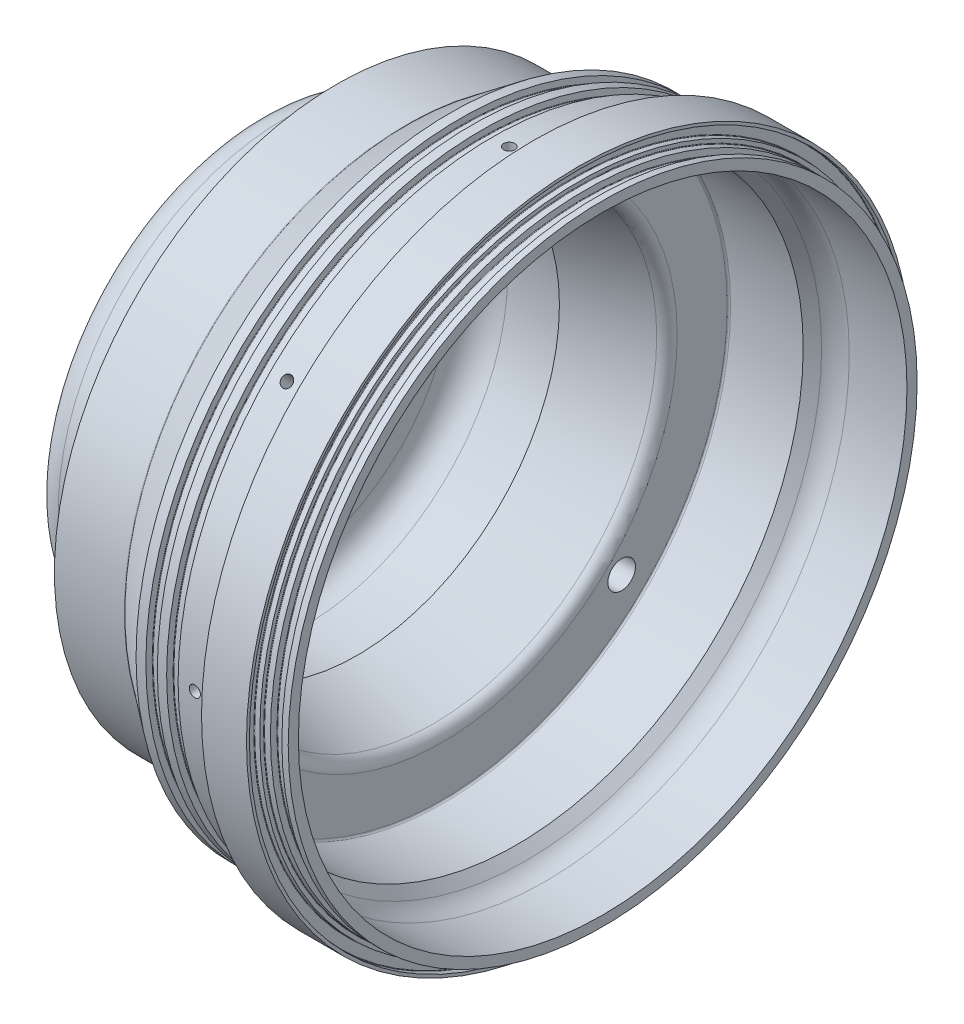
ISO-10303-21;
HEADER;
FILE_DESCRIPTION(('STEP AP214'),'2;1');
FILE_NAME('part.step','',(''),(''),'','','');
FILE_SCHEMA(('AUTOMOTIVE_DESIGN { 1 0 10303 214 1 1 1 1 }'));
ENDSEC;
DATA;
#1=APPLICATION_CONTEXT('core data for automotive mechanical design processes');
#2=APPLICATION_PROTOCOL_DEFINITION('international standard','automotive_design',2000,#1);
#3=PRODUCT_CONTEXT('',#1,'mechanical');
#4=PRODUCT('Part','Part','',(#3));
#5=PRODUCT_RELATED_PRODUCT_CATEGORY('part','',(#4));
#6=PRODUCT_DEFINITION_FORMATION('','',#4);
#7=PRODUCT_DEFINITION_CONTEXT('part definition',#1,'design');
#8=PRODUCT_DEFINITION('design','',#6,#7);
#9=PRODUCT_DEFINITION_SHAPE('','',#8);
#10=(LENGTH_UNIT() NAMED_UNIT(*) SI_UNIT(.MILLI.,.METRE.));
#11=(NAMED_UNIT(*) PLANE_ANGLE_UNIT() SI_UNIT($,.RADIAN.));
#12=(NAMED_UNIT(*) SI_UNIT($,.STERADIAN.) SOLID_ANGLE_UNIT());
#13=UNCERTAINTY_MEASURE_WITH_UNIT(LENGTH_MEASURE(1.E-05),#10,'distance_accuracy_value','');
#14=(GEOMETRIC_REPRESENTATION_CONTEXT(3) GLOBAL_UNCERTAINTY_ASSIGNED_CONTEXT((#13)) GLOBAL_UNIT_ASSIGNED_CONTEXT((#10,
#11,#12)) REPRESENTATION_CONTEXT('',''));
#15=CARTESIAN_POINT('',(0.,0.,0.));
#16=DIRECTION('',(0.,0.,1.));
#17=DIRECTION('',(1.,0.,0.));
#18=AXIS2_PLACEMENT_3D('',#15,#16,#17);
#19=CARTESIAN_POINT('',(-147.6375,44.45,0.));
#20=DIRECTION('',(1.,0.,0.));
#21=DIRECTION('',(0.,1.,0.));
#22=AXIS2_PLACEMENT_3D('',#19,#20,#21);
#23=CYLINDRICAL_SURFACE('',#22,19.0754);
#24=CARTESIAN_POINT('',(-146.4945,44.45,0.));
#25=DIRECTION('',(1.,0.,0.));
#26=DIRECTION('',(0.,0.,-1.));
#27=AXIS2_PLACEMENT_3D('',#24,#25,#26);
#28=CIRCLE('',#27,19.0754);
#29=CARTESIAN_POINT('',(-146.4945,44.45,-19.0754));
#30=VERTEX_POINT('',#29);
#31=EDGE_CURVE('E118',#30,#30,#28,.T.);
#32=ORIENTED_EDGE('',*,*,#31,.T.);
#33=EDGE_LOOP('',(#32));
#34=FACE_BOUND('',#33,.T.);
#35=CARTESIAN_POINT('',(-147.6375,44.45,0.));
#36=DIRECTION('',(1.,0.,0.));
#37=DIRECTION('',(0.,1.,0.));
#38=AXIS2_PLACEMENT_3D('',#35,#36,#37);
#39=CIRCLE('',#38,19.0754);
#40=CARTESIAN_POINT('',(-147.6375,63.5254,0.));
#41=VERTEX_POINT('',#40);
#42=EDGE_CURVE('E150',#41,#41,#39,.T.);
#43=ORIENTED_EDGE('',*,*,#42,.F.);
#44=EDGE_LOOP('',(#43));
#45=FACE_BOUND('',#44,.T.);
#46=ADVANCED_FACE('F41',(#34,#45),#23,.F.);
#47=CARTESIAN_POINT('',(-138.1125,0.,0.));
#48=DIRECTION('',(1.,0.,0.));
#49=DIRECTION('',(0.,0.,-1.));
#50=AXIS2_PLACEMENT_3D('',#47,#48,#49);
#51=PLANE('',#50);
#52=CARTESIAN_POINT('',(-138.1125,44.45,0.));
#53=DIRECTION('',(1.,0.,0.));
#54=DIRECTION('',(0.,0.,-1.));
#55=AXIS2_PLACEMENT_3D('',#52,#53,#54);
#56=CIRCLE('',#55,30.1625);
#57=CARTESIAN_POINT('',(-138.1125,44.45,-30.1625));
#58=VERTEX_POINT('',#57);
#59=EDGE_CURVE('E631',#58,#58,#56,.F.);
#60=ORIENTED_EDGE('',*,*,#59,.T.);
#61=EDGE_LOOP('',(#60));
#62=FACE_BOUND('',#61,.T.);
#63=CARTESIAN_POINT('',(-138.1125,0.,0.));
#64=DIRECTION('',(1.,0.,0.));
#65=DIRECTION('',(0.,0.,-1.));
#66=AXIS2_PLACEMENT_3D('',#63,#64,#65);
#67=CIRCLE('',#66,80.16875);
#68=CARTESIAN_POINT('',(-138.1125,0.,-80.16875));
#69=VERTEX_POINT('',#68);
#70=EDGE_CURVE('E263',#69,#69,#67,.T.);
#71=ORIENTED_EDGE('',*,*,#70,.T.);
#72=EDGE_LOOP('',(#71));
#73=FACE_BOUND('',#72,.T.);
#74=ADVANCED_FACE('F239',(#62,#73),#51,.T.);
#75=CARTESIAN_POINT('',(-58.7375,0.,0.));
#76=DIRECTION('',(1.,0.,0.));
#77=DIRECTION('',(0.,0.,-1.));
#78=AXIS2_PLACEMENT_3D('',#75,#76,#77);
#79=CYLINDRICAL_SURFACE('',#78,144.3609);
#80=CARTESIAN_POINT('',(-20.8915,0.,0.));
#81=DIRECTION('',(-1.,0.,0.));
#82=DIRECTION('',(0.,0.,1.));
#83=AXIS2_PLACEMENT_3D('',#80,#81,#82);
#84=CIRCLE('',#83,144.3609);
#85=CARTESIAN_POINT('',(-20.8915,0.,144.3609));
#86=VERTEX_POINT('',#85);
#87=EDGE_CURVE('E618',#86,#86,#84,.T.);
#88=ORIENTED_EDGE('',*,*,#87,.T.);
#89=EDGE_LOOP('',(#88));
#90=FACE_BOUND('',#89,.T.);
#91=CARTESIAN_POINT('',(-31.75,2.55270000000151,-144.338328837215));
#92=CARTESIAN_POINT('',(-31.606625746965,2.55269364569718,-144.338329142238));
#93=CARTESIAN_POINT('',(-31.4631478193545,2.54058038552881,-144.338544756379));
#94=CARTESIAN_POINT('',(-31.1801442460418,2.49242674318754,-144.339384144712));
#95=CARTESIAN_POINT('',(-31.0406235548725,2.45635763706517,-144.340008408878));
#96=CARTESIAN_POINT('',(-30.769675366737,2.36132016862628,-144.341594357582));
#97=CARTESIAN_POINT('',(-30.6382440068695,2.30236283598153,-144.342555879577));
#98=CARTESIAN_POINT('',(-30.3871814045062,2.16323788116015,-144.344707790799));
#99=CARTESIAN_POINT('',(-30.2675472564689,2.08307549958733,-144.345898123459));
#100=CARTESIAN_POINT('',(-30.0434076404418,1.90379049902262,-144.348373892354));
#101=CARTESIAN_POINT('',(-29.9389052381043,1.80466404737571,-144.349659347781));
#102=CARTESIAN_POINT('',(-29.7480208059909,1.59026984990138,-144.352180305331));
#103=CARTESIAN_POINT('',(-29.6616394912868,1.47500146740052,-144.353415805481));
#104=CARTESIAN_POINT('',(-29.5094503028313,1.2315915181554,-144.355697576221));
#105=CARTESIAN_POINT('',(-29.4436433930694,1.10344934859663,-144.356743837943));
#106=CARTESIAN_POINT('',(-29.3344776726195,0.837933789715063,-144.358529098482));
#107=CARTESIAN_POINT('',(-29.2911188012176,0.700560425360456,-144.359268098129));
#108=CARTESIAN_POINT('',(-29.2280841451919,0.420497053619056,-144.360355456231));
#109=CARTESIAN_POINT('',(-29.2084058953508,0.277807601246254,-144.36070385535));
#110=CARTESIAN_POINT('',(-29.193283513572,-0.00884984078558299,-144.360970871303));
#111=CARTESIAN_POINT('',(-29.1978393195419,-0.152817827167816,-144.36088948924));
#112=CARTESIAN_POINT('',(-29.2310535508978,-0.437928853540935,-144.36030615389));
#113=CARTESIAN_POINT('',(-29.2597092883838,-0.579072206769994,-144.359804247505));
#114=CARTESIAN_POINT('',(-29.3403058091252,-0.854544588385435,-144.358436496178));
#115=CARTESIAN_POINT('',(-29.3922466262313,-0.988873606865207,-144.357570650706));
#116=CARTESIAN_POINT('',(-29.5179419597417,-1.24691268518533,-144.355572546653));
#117=CARTESIAN_POINT('',(-29.5916977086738,-1.37062214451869,-144.35444027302));
#118=CARTESIAN_POINT('',(-29.7589282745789,-1.60390377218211,-144.352036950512));
#119=CARTESIAN_POINT('',(-29.8524031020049,-1.71347593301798,-144.350765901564));
#120=CARTESIAN_POINT('',(-30.0564336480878,-1.91538830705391,-144.348228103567));
#121=CARTESIAN_POINT('',(-30.1669917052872,-2.00772615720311,-144.346961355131));
#122=CARTESIAN_POINT('',(-30.4020420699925,-2.17253055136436,-144.344575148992));
#123=CARTESIAN_POINT('',(-30.5265343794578,-2.24499709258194,-144.34345569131));
#124=CARTESIAN_POINT('',(-30.7859205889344,-2.36800148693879,-144.341490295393));
#125=CARTESIAN_POINT('',(-30.9208145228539,-2.41853926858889,-144.34064435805));
#126=CARTESIAN_POINT('',(-31.1971741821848,-2.49625003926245,-144.339321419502));
#127=CARTESIAN_POINT('',(-31.3386399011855,-2.52342305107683,-144.338844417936));
#128=CARTESIAN_POINT('',(-31.6241068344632,-2.55363004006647,-144.338313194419));
#129=CARTESIAN_POINT('',(-31.7681077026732,-2.55666728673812,-144.338258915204));
#130=CARTESIAN_POINT('',(-32.0545752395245,-2.53852504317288,-144.338579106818));
#131=CARTESIAN_POINT('',(-32.1970419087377,-2.51734556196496,-144.338953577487));
#132=CARTESIAN_POINT('',(-32.4763877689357,-2.45137378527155,-144.340088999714));
#133=CARTESIAN_POINT('',(-32.6132673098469,-2.40658297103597,-144.340849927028));
#134=CARTESIAN_POINT('',(-32.8775640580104,-2.29466150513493,-144.342672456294));
#135=CARTESIAN_POINT('',(-33.0049812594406,-2.22753083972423,-144.34373405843));
#136=CARTESIAN_POINT('',(-33.2467514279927,-2.07282686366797,-144.346038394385));
#137=CARTESIAN_POINT('',(-33.3611029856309,-1.98525135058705,-144.347281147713));
#138=CARTESIAN_POINT('',(-33.5734816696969,-1.79214688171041,-144.349807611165));
#139=CARTESIAN_POINT('',(-33.6715087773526,-1.68661790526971,-144.351091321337));
#140=CARTESIAN_POINT('',(-33.8484667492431,-1.46058814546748,-144.353555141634));
#141=CARTESIAN_POINT('',(-33.9273955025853,-1.34008570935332,-144.3547352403));
#142=CARTESIAN_POINT('',(-34.0639017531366,-1.08753825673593,-144.356858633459));
#143=CARTESIAN_POINT('',(-34.1214792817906,-0.955493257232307,-144.357801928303));
#144=CARTESIAN_POINT('',(-34.2136450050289,-0.683616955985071,-144.359345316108));
#145=CARTESIAN_POINT('',(-34.2482345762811,-0.543786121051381,-144.359945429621));
#146=CARTESIAN_POINT('',(-34.29344704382,-0.260300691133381,-144.360734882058));
#147=CARTESIAN_POINT('',(-34.3040699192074,-0.11664609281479,-144.360924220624));
#148=CARTESIAN_POINT('',(-34.3010472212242,0.170387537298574,-144.360870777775));
#149=CARTESIAN_POINT('',(-34.2874050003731,0.313766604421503,-144.360628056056));
#150=CARTESIAN_POINT('',(-34.2362462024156,0.596199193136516,-144.359737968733));
#151=CARTESIAN_POINT('',(-34.1987295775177,0.735252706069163,-144.35909060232));
#152=CARTESIAN_POINT('',(-34.1008868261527,1.00508965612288,-144.357464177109));
#153=CARTESIAN_POINT('',(-34.0405602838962,1.13587294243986,-144.356485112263));
#154=CARTESIAN_POINT('',(-33.8988129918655,1.38545093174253,-144.354305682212));
#155=CARTESIAN_POINT('',(-33.8173930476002,1.50424609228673,-144.353105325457));
#156=CARTESIAN_POINT('',(-33.6357667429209,1.72648708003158,-144.350618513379));
#157=CARTESIAN_POINT('',(-33.535559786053,1.82993241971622,-144.349332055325));
#158=CARTESIAN_POINT('',(-33.3191721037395,2.01855859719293,-144.346817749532));
#159=CARTESIAN_POINT('',(-33.2029874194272,2.10373489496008,-144.345589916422));
#160=CARTESIAN_POINT('',(-32.9579133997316,2.25341050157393,-144.343331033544));
#161=CARTESIAN_POINT('',(-32.8290172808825,2.31789869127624,-144.342300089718));
#162=CARTESIAN_POINT('',(-32.5623264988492,2.42424512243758,-144.340553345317));
#163=CARTESIAN_POINT('',(-32.424542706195,2.46613044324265,-144.339837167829));
#164=CARTESIAN_POINT('',(-32.1965695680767,2.51494079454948,-144.338992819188));
#165=CARTESIAN_POINT('',(-32.1078610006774,2.52908277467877,-144.338744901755));
#166=CARTESIAN_POINT('',(-31.9294484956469,2.54796436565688,-144.338412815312));
#167=CARTESIAN_POINT('',(-31.8397445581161,2.55270397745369,-144.338328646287));
#168=CARTESIAN_POINT('',(-31.75,2.55270000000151,-144.338328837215));
#169=B_SPLINE_CURVE_WITH_KNOTS('',3,(#91,#92,#93,#94,#95,#96,#97,#98,#99,#100,#101,#102,#103,
#104,#105,#106,#107,#108,#109,#110,#111,#112,#113,#114,#115,#116,#117,#118,#119,#120,#121,#122,
#123,#124,#125,#126,#127,#128,#129,#130,#131,#132,#133,#134,#135,#136,#137,#138,#139,#140,#141,
#142,#143,#144,#145,#146,#147,#148,#149,#150,#151,#152,#153,#154,#155,#156,#157,#158,#159,#160,
#161,#162,#163,#164,#165,#166,#167,#168),.UNSPECIFIED.,.T.,.F.,(4,2,2,2,2,2,2,2,2,2,2,2,2,2,2,2,
2,2,2,2,2,2,2,2,2,2,2,2,2,2,2,2,2,2,2,2,2,2,4),(0.,0.42979518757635,0.860106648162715,
1.2902110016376,1.72020915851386,2.1502943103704,2.58039643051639,3.01051869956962,
3.44063980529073,3.87071613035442,4.30079135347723,4.73081861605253,5.16084650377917,
5.59089869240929,6.02095110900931,6.45106244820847,6.88117384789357,7.31128664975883,
7.74139903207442,8.17145314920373,8.60150710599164,9.03153408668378,9.46156133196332,
9.89163492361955,10.3217090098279,10.7518306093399,11.18195157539,11.6120467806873,
12.0421423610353,12.472178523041,12.9022155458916,13.3322604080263,13.7622888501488,
14.1923309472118,14.6224797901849,15.0528594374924,15.4827223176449,15.7517509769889,
16.0207796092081),.UNSPECIFIED.);
#170=CARTESIAN_POINT('',(-31.75,2.55270000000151,-144.338328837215));
#171=VERTEX_POINT('',#170);
#172=EDGE_CURVE('E1322',#171,#171,#169,.T.);
#173=ORIENTED_EDGE('',*,*,#172,.F.);
#174=EDGE_LOOP('',(#173));
#175=FACE_BOUND('',#174,.T.);
#176=CARTESIAN_POINT('',(-31.75,-144.338328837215,-2.5527));
#177=CARTESIAN_POINT('',(-31.606625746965,-144.338329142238,-2.55269364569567));
#178=CARTESIAN_POINT('',(-31.4631478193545,-144.338544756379,-2.5405803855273));
#179=CARTESIAN_POINT('',(-31.1801442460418,-144.339384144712,-2.49242674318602));
#180=CARTESIAN_POINT('',(-31.0406235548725,-144.340008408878,-2.45635763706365));
#181=CARTESIAN_POINT('',(-30.769675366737,-144.341594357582,-2.36132016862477));
#182=CARTESIAN_POINT('',(-30.6382440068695,-144.342555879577,-2.30236283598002));
#183=CARTESIAN_POINT('',(-30.3871814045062,-144.344707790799,-2.16323788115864));
#184=CARTESIAN_POINT('',(-30.2675472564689,-144.345898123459,-2.08307549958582));
#185=CARTESIAN_POINT('',(-30.0434076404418,-144.348373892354,-1.90379049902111));
#186=CARTESIAN_POINT('',(-29.9389052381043,-144.349659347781,-1.8046640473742));
#187=CARTESIAN_POINT('',(-29.7480208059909,-144.352180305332,-1.59026984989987));
#188=CARTESIAN_POINT('',(-29.6616394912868,-144.353415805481,-1.47500146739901));
#189=CARTESIAN_POINT('',(-29.5094503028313,-144.355697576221,-1.23159151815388));
#190=CARTESIAN_POINT('',(-29.4436433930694,-144.356743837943,-1.10344934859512));
#191=CARTESIAN_POINT('',(-29.3344776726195,-144.358529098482,-0.837933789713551));
#192=CARTESIAN_POINT('',(-29.2911188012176,-144.359268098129,-0.700560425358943));
#193=CARTESIAN_POINT('',(-29.2280841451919,-144.360355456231,-0.420497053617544));
#194=CARTESIAN_POINT('',(-29.2084058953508,-144.36070385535,-0.277807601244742));
#195=CARTESIAN_POINT('',(-29.193283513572,-144.360970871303,0.00884984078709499));
#196=CARTESIAN_POINT('',(-29.1978393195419,-144.36088948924,0.152817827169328));
#197=CARTESIAN_POINT('',(-29.2310535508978,-144.36030615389,0.437928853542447));
#198=CARTESIAN_POINT('',(-29.2597092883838,-144.359804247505,0.579072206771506));
#199=CARTESIAN_POINT('',(-29.3403058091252,-144.358436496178,0.854544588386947));
#200=CARTESIAN_POINT('',(-29.3922466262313,-144.357570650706,0.988873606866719));
#201=CARTESIAN_POINT('',(-29.5179419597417,-144.355572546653,1.24691268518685));
#202=CARTESIAN_POINT('',(-29.5916977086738,-144.35444027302,1.37062214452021));
#203=CARTESIAN_POINT('',(-29.7589282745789,-144.352036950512,1.60390377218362));
#204=CARTESIAN_POINT('',(-29.8524031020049,-144.350765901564,1.71347593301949));
#205=CARTESIAN_POINT('',(-30.0564336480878,-144.348228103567,1.91538830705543));
#206=CARTESIAN_POINT('',(-30.1669917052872,-144.346961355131,2.00772615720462));
#207=CARTESIAN_POINT('',(-30.4020420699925,-144.344575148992,2.17253055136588));
#208=CARTESIAN_POINT('',(-30.5265343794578,-144.34345569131,2.24499709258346));
#209=CARTESIAN_POINT('',(-30.7859205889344,-144.341490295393,2.3680014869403));
#210=CARTESIAN_POINT('',(-30.9208145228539,-144.34064435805,2.4185392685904));
#211=CARTESIAN_POINT('',(-31.1971741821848,-144.339321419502,2.49625003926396));
#212=CARTESIAN_POINT('',(-31.3386399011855,-144.338844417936,2.52342305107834));
#213=CARTESIAN_POINT('',(-31.6241068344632,-144.338313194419,2.55363004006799));
#214=CARTESIAN_POINT('',(-31.7681077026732,-144.338258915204,2.55666728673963));
#215=CARTESIAN_POINT('',(-32.0545752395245,-144.338579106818,2.53852504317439));
#216=CARTESIAN_POINT('',(-32.1970419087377,-144.338953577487,2.51734556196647));
#217=CARTESIAN_POINT('',(-32.4763877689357,-144.340088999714,2.45137378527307));
#218=CARTESIAN_POINT('',(-32.6132673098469,-144.340849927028,2.40658297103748));
#219=CARTESIAN_POINT('',(-32.8775640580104,-144.342672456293,2.29466150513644));
#220=CARTESIAN_POINT('',(-33.0049812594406,-144.34373405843,2.22753083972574));
#221=CARTESIAN_POINT('',(-33.2467514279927,-144.346038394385,2.07282686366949));
#222=CARTESIAN_POINT('',(-33.3611029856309,-144.347281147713,1.98525135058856));
#223=CARTESIAN_POINT('',(-33.5734816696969,-144.349807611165,1.79214688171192));
#224=CARTESIAN_POINT('',(-33.6715087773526,-144.351091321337,1.68661790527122));
#225=CARTESIAN_POINT('',(-33.8484667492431,-144.353555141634,1.46058814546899));
#226=CARTESIAN_POINT('',(-33.9273955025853,-144.3547352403,1.34008570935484));
#227=CARTESIAN_POINT('',(-34.0639017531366,-144.356858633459,1.08753825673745));
#228=CARTESIAN_POINT('',(-34.1214792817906,-144.357801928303,0.95549325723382));
#229=CARTESIAN_POINT('',(-34.2136450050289,-144.359345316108,0.683616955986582));
#230=CARTESIAN_POINT('',(-34.2482345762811,-144.359945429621,0.543786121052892));
#231=CARTESIAN_POINT('',(-34.29344704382,-144.360734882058,0.260300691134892));
#232=CARTESIAN_POINT('',(-34.3040699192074,-144.360924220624,0.116646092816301));
#233=CARTESIAN_POINT('',(-34.3010472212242,-144.360870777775,-0.170387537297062));
#234=CARTESIAN_POINT('',(-34.2874050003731,-144.360628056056,-0.313766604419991));
#235=CARTESIAN_POINT('',(-34.2362462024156,-144.359737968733,-0.596199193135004));
#236=CARTESIAN_POINT('',(-34.1987295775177,-144.35909060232,-0.735252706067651));
#237=CARTESIAN_POINT('',(-34.1008868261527,-144.357464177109,-1.00508965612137));
#238=CARTESIAN_POINT('',(-34.0405602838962,-144.356485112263,-1.13587294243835));
#239=CARTESIAN_POINT('',(-33.8988129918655,-144.354305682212,-1.38545093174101));
#240=CARTESIAN_POINT('',(-33.8173930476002,-144.353105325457,-1.50424609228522));
#241=CARTESIAN_POINT('',(-33.6357667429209,-144.350618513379,-1.72648708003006));
#242=CARTESIAN_POINT('',(-33.535559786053,-144.349332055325,-1.82993241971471));
#243=CARTESIAN_POINT('',(-33.3191721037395,-144.346817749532,-2.01855859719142));
#244=CARTESIAN_POINT('',(-33.2029874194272,-144.345589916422,-2.10373489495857));
#245=CARTESIAN_POINT('',(-32.9579133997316,-144.343331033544,-2.25341050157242));
#246=CARTESIAN_POINT('',(-32.8290172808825,-144.342300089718,-2.31789869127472));
#247=CARTESIAN_POINT('',(-32.5623264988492,-144.340553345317,-2.42424512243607));
#248=CARTESIAN_POINT('',(-32.424542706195,-144.339837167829,-2.46613044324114));
#249=CARTESIAN_POINT('',(-32.1965695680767,-144.338992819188,-2.51494079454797));
#250=CARTESIAN_POINT('',(-32.1078610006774,-144.338744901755,-2.52908277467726));
#251=CARTESIAN_POINT('',(-31.9294484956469,-144.338412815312,-2.54796436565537));
#252=CARTESIAN_POINT('',(-31.8397445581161,-144.338328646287,-2.55270397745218));
#253=CARTESIAN_POINT('',(-31.75,-144.338328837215,-2.5527));
#254=B_SPLINE_CURVE_WITH_KNOTS('',3,(#176,#177,#178,#179,#180,#181,#182,#183,#184,#185,#186,
#187,#188,#189,#190,#191,#192,#193,#194,#195,#196,#197,#198,#199,#200,#201,#202,#203,#204,#205,
#206,#207,#208,#209,#210,#211,#212,#213,#214,#215,#216,#217,#218,#219,#220,#221,#222,#223,#224,
#225,#226,#227,#228,#229,#230,#231,#232,#233,#234,#235,#236,#237,#238,#239,#240,#241,#242,#243,
#244,#245,#246,#247,#248,#249,#250,#251,#252,#253),.UNSPECIFIED.,.T.,.F.,(4,2,2,2,2,2,2,2,2,2,2,
2,2,2,2,2,2,2,2,2,2,2,2,2,2,2,2,2,2,2,2,2,2,2,2,2,2,2,4),(0.,0.42979518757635,0.860106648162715,
1.2902110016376,1.72020915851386,2.1502943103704,2.58039643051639,3.01051869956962,
3.44063980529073,3.87071613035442,4.30079135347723,4.73081861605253,5.16084650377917,
5.59089869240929,6.02095110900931,6.45106244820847,6.88117384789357,7.31128664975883,
7.74139903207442,8.17145314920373,8.60150710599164,9.03153408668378,9.46156133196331,
9.89163492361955,10.3217090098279,10.7518306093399,11.18195157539,11.6120467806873,
12.0421423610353,12.472178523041,12.9022155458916,13.3322604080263,13.7622888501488,
14.1923309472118,14.6224797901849,15.0528594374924,15.4827223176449,15.7517509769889,
16.0207796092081),.UNSPECIFIED.);
#255=CARTESIAN_POINT('',(-31.75,-144.338328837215,-2.5527));
#256=VERTEX_POINT('',#255);
#257=EDGE_CURVE('E1302',#256,#256,#254,.T.);
#258=ORIENTED_EDGE('',*,*,#257,.F.);
#259=EDGE_LOOP('',(#258));
#260=FACE_BOUND('',#259,.T.);
#261=CARTESIAN_POINT('',(-31.75,-2.55270000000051,144.338328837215));
#262=CARTESIAN_POINT('',(-31.606625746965,-2.55269364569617,144.338329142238));
#263=CARTESIAN_POINT('',(-31.4631478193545,-2.5405803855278,144.338544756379));
#264=CARTESIAN_POINT('',(-31.1801442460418,-2.49242674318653,144.339384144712));
#265=CARTESIAN_POINT('',(-31.0406235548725,-2.45635763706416,144.340008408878));
#266=CARTESIAN_POINT('',(-30.769675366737,-2.36132016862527,144.341594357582));
#267=CARTESIAN_POINT('',(-30.6382440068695,-2.30236283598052,144.342555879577));
#268=CARTESIAN_POINT('',(-30.3871814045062,-2.16323788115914,144.344707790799));
#269=CARTESIAN_POINT('',(-30.2675472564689,-2.08307549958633,144.345898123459));
#270=CARTESIAN_POINT('',(-30.0434076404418,-1.90379049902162,144.348373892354));
#271=CARTESIAN_POINT('',(-29.9389052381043,-1.8046640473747,144.349659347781));
#272=CARTESIAN_POINT('',(-29.7480208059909,-1.59026984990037,144.352180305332));
#273=CARTESIAN_POINT('',(-29.6616394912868,-1.47500146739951,144.353415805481));
#274=CARTESIAN_POINT('',(-29.5094503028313,-1.23159151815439,144.355697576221));
#275=CARTESIAN_POINT('',(-29.4436433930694,-1.10344934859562,144.356743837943));
#276=CARTESIAN_POINT('',(-29.3344776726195,-0.837933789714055,144.358529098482));
#277=CARTESIAN_POINT('',(-29.2911188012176,-0.700560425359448,144.359268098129));
#278=CARTESIAN_POINT('',(-29.2280841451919,-0.420497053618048,144.360355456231));
#279=CARTESIAN_POINT('',(-29.2084058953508,-0.277807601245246,144.36070385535));
#280=CARTESIAN_POINT('',(-29.193283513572,0.00884984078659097,144.360970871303));
#281=CARTESIAN_POINT('',(-29.1978393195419,0.152817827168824,144.36088948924));
#282=CARTESIAN_POINT('',(-29.2310535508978,0.437928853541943,144.36030615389));
#283=CARTESIAN_POINT('',(-29.2597092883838,0.579072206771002,144.359804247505));
#284=CARTESIAN_POINT('',(-29.3403058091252,0.854544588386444,144.358436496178));
#285=CARTESIAN_POINT('',(-29.3922466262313,0.988873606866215,144.357570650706));
#286=CARTESIAN_POINT('',(-29.5179419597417,1.24691268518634,144.355572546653));
#287=CARTESIAN_POINT('',(-29.5916977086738,1.3706221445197,144.35444027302));
#288=CARTESIAN_POINT('',(-29.7589282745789,1.60390377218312,144.352036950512));
#289=CARTESIAN_POINT('',(-29.8524031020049,1.71347593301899,144.350765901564));
#290=CARTESIAN_POINT('',(-30.0564336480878,1.91538830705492,144.348228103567));
#291=CARTESIAN_POINT('',(-30.1669917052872,2.00772615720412,144.346961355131));
#292=CARTESIAN_POINT('',(-30.4020420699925,2.17253055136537,144.344575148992));
#293=CARTESIAN_POINT('',(-30.5265343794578,2.24499709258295,144.34345569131));
#294=CARTESIAN_POINT('',(-30.7859205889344,2.36800148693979,144.341490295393));
#295=CARTESIAN_POINT('',(-30.9208145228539,2.4185392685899,144.34064435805));
#296=CARTESIAN_POINT('',(-31.1971741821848,2.49625003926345,144.339321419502));
#297=CARTESIAN_POINT('',(-31.3386399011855,2.52342305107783,144.338844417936));
#298=CARTESIAN_POINT('',(-31.6241068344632,2.55363004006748,144.338313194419));
#299=CARTESIAN_POINT('',(-31.7681077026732,2.55666728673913,144.338258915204));
#300=CARTESIAN_POINT('',(-32.0545752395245,2.53852504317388,144.338579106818));
#301=CARTESIAN_POINT('',(-32.1970419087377,2.51734556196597,144.338953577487));
#302=CARTESIAN_POINT('',(-32.4763877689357,2.45137378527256,144.340088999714));
#303=CARTESIAN_POINT('',(-32.6132673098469,2.40658297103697,144.340849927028));
#304=CARTESIAN_POINT('',(-32.8775640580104,2.29466150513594,144.342672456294));
#305=CARTESIAN_POINT('',(-33.0049812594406,2.22753083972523,144.34373405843));
#306=CARTESIAN_POINT('',(-33.2467514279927,2.07282686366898,144.346038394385));
#307=CARTESIAN_POINT('',(-33.3611029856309,1.98525135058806,144.347281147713));
#308=CARTESIAN_POINT('',(-33.5734816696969,1.79214688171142,144.349807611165));
#309=CARTESIAN_POINT('',(-33.6715087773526,1.68661790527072,144.351091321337));
#310=CARTESIAN_POINT('',(-33.8484667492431,1.46058814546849,144.353555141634));
#311=CARTESIAN_POINT('',(-33.9273955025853,1.34008570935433,144.3547352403));
#312=CARTESIAN_POINT('',(-34.0639017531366,1.08753825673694,144.356858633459));
#313=CARTESIAN_POINT('',(-34.1214792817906,0.955493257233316,144.357801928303));
#314=CARTESIAN_POINT('',(-34.2136450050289,0.683616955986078,144.359345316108));
#315=CARTESIAN_POINT('',(-34.2482345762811,0.543786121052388,144.359945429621));
#316=CARTESIAN_POINT('',(-34.29344704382,0.260300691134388,144.360734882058));
#317=CARTESIAN_POINT('',(-34.3040699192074,0.116646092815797,144.360924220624));
#318=CARTESIAN_POINT('',(-34.3010472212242,-0.170387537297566,144.360870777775));
#319=CARTESIAN_POINT('',(-34.2874050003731,-0.313766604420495,144.360628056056));
#320=CARTESIAN_POINT('',(-34.2362462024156,-0.596199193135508,144.359737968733));
#321=CARTESIAN_POINT('',(-34.1987295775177,-0.735252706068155,144.35909060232));
#322=CARTESIAN_POINT('',(-34.1008868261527,-1.00508965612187,144.357464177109));
#323=CARTESIAN_POINT('',(-34.0405602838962,-1.13587294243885,144.356485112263));
#324=CARTESIAN_POINT('',(-33.8988129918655,-1.38545093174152,144.354305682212));
#325=CARTESIAN_POINT('',(-33.8173930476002,-1.50424609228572,144.353105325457));
#326=CARTESIAN_POINT('',(-33.6357667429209,-1.72648708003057,144.350618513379));
#327=CARTESIAN_POINT('',(-33.535559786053,-1.82993241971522,144.349332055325));
#328=CARTESIAN_POINT('',(-33.3191721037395,-2.01855859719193,144.346817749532));
#329=CARTESIAN_POINT('',(-33.2029874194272,-2.10373489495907,144.345589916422));
#330=CARTESIAN_POINT('',(-32.9579133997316,-2.25341050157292,144.343331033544));
#331=CARTESIAN_POINT('',(-32.8290172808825,-2.31789869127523,144.342300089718));
#332=CARTESIAN_POINT('',(-32.5623264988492,-2.42424512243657,144.340553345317));
#333=CARTESIAN_POINT('',(-32.424542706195,-2.46613044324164,144.339837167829));
#334=CARTESIAN_POINT('',(-32.1965695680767,-2.51494079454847,144.338992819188));
#335=CARTESIAN_POINT('',(-32.1078610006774,-2.52908277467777,144.338744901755));
#336=CARTESIAN_POINT('',(-31.9294484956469,-2.54796436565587,144.338412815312));
#337=CARTESIAN_POINT('',(-31.8397445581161,-2.55270397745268,144.338328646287));
#338=CARTESIAN_POINT('',(-31.75,-2.55270000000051,144.338328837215));
#339=B_SPLINE_CURVE_WITH_KNOTS('',3,(#261,#262,#263,#264,#265,#266,#267,#268,#269,#270,#271,
#272,#273,#274,#275,#276,#277,#278,#279,#280,#281,#282,#283,#284,#285,#286,#287,#288,#289,#290,
#291,#292,#293,#294,#295,#296,#297,#298,#299,#300,#301,#302,#303,#304,#305,#306,#307,#308,#309,
#310,#311,#312,#313,#314,#315,#316,#317,#318,#319,#320,#321,#322,#323,#324,#325,#326,#327,#328,
#329,#330,#331,#332,#333,#334,#335,#336,#337,#338),.UNSPECIFIED.,.T.,.F.,(4,2,2,2,2,2,2,2,2,2,2,
2,2,2,2,2,2,2,2,2,2,2,2,2,2,2,2,2,2,2,2,2,2,2,2,2,2,2,4),(0.,0.42979518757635,0.860106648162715,
1.2902110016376,1.72020915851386,2.1502943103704,2.58039643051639,3.01051869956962,
3.44063980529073,3.87071613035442,4.30079135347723,4.73081861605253,5.16084650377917,
5.59089869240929,6.02095110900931,6.45106244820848,6.88117384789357,7.31128664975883,
7.74139903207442,8.17145314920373,8.60150710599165,9.03153408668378,9.46156133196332,
9.89163492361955,10.3217090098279,10.7518306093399,11.18195157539,11.6120467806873,
12.0421423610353,12.472178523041,12.9022155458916,13.3322604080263,13.7622888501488,
14.1923309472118,14.6224797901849,15.0528594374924,15.4827223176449,15.7517509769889,
16.0207796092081),.UNSPECIFIED.);
#340=CARTESIAN_POINT('',(-31.75,-2.55270000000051,144.338328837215));
#341=VERTEX_POINT('',#340);
#342=EDGE_CURVE('E1281',#341,#341,#339,.T.);
#343=ORIENTED_EDGE('',*,*,#342,.F.);
#344=EDGE_LOOP('',(#343));
#345=FACE_BOUND('',#344,.T.);
#346=CARTESIAN_POINT('',(-31.75,144.338328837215,2.5527));
#347=CARTESIAN_POINT('',(-31.606625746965,144.338329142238,2.55269364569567));
#348=CARTESIAN_POINT('',(-31.4631478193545,144.338544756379,2.5405803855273));
#349=CARTESIAN_POINT('',(-31.1801442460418,144.339384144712,2.49242674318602));
#350=CARTESIAN_POINT('',(-31.0406235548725,144.340008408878,2.45635763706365));
#351=CARTESIAN_POINT('',(-30.769675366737,144.341594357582,2.36132016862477));
#352=CARTESIAN_POINT('',(-30.6382440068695,144.342555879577,2.30236283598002));
#353=CARTESIAN_POINT('',(-30.3871814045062,144.344707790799,2.16323788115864));
#354=CARTESIAN_POINT('',(-30.2675472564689,144.345898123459,2.08307549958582));
#355=CARTESIAN_POINT('',(-30.0434076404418,144.348373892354,1.90379049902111));
#356=CARTESIAN_POINT('',(-29.9389052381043,144.349659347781,1.8046640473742));
#357=CARTESIAN_POINT('',(-29.7480208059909,144.352180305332,1.59026984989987));
#358=CARTESIAN_POINT('',(-29.6616394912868,144.353415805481,1.47500146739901));
#359=CARTESIAN_POINT('',(-29.5094503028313,144.355697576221,1.23159151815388));
#360=CARTESIAN_POINT('',(-29.4436433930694,144.356743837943,1.10344934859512));
#361=CARTESIAN_POINT('',(-29.3344776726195,144.358529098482,0.837933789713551));
#362=CARTESIAN_POINT('',(-29.2911188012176,144.359268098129,0.700560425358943));
#363=CARTESIAN_POINT('',(-29.2280841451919,144.360355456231,0.420497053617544));
#364=CARTESIAN_POINT('',(-29.2084058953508,144.36070385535,0.277807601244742));
#365=CARTESIAN_POINT('',(-29.193283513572,144.360970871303,-0.00884984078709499));
#366=CARTESIAN_POINT('',(-29.1978393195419,144.36088948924,-0.152817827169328));
#367=CARTESIAN_POINT('',(-29.2310535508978,144.36030615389,-0.437928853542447));
#368=CARTESIAN_POINT('',(-29.2597092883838,144.359804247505,-0.579072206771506));
#369=CARTESIAN_POINT('',(-29.3403058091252,144.358436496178,-0.854544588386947));
#370=CARTESIAN_POINT('',(-29.3922466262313,144.357570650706,-0.988873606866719));
#371=CARTESIAN_POINT('',(-29.5179419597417,144.355572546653,-1.24691268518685));
#372=CARTESIAN_POINT('',(-29.5916977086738,144.35444027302,-1.37062214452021));
#373=CARTESIAN_POINT('',(-29.7589282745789,144.352036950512,-1.60390377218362));
#374=CARTESIAN_POINT('',(-29.8524031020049,144.350765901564,-1.71347593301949));
#375=CARTESIAN_POINT('',(-30.0564336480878,144.348228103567,-1.91538830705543));
#376=CARTESIAN_POINT('',(-30.1669917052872,144.346961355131,-2.00772615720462));
#377=CARTESIAN_POINT('',(-30.4020420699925,144.344575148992,-2.17253055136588));
#378=CARTESIAN_POINT('',(-30.5265343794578,144.34345569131,-2.24499709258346));
#379=CARTESIAN_POINT('',(-30.7859205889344,144.341490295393,-2.3680014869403));
#380=CARTESIAN_POINT('',(-30.9208145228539,144.34064435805,-2.4185392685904));
#381=CARTESIAN_POINT('',(-31.1971741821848,144.339321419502,-2.49625003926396));
#382=CARTESIAN_POINT('',(-31.3386399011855,144.338844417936,-2.52342305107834));
#383=CARTESIAN_POINT('',(-31.6241068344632,144.338313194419,-2.55363004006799));
#384=CARTESIAN_POINT('',(-31.7681077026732,144.338258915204,-2.55666728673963));
#385=CARTESIAN_POINT('',(-32.0545752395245,144.338579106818,-2.53852504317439));
#386=CARTESIAN_POINT('',(-32.1970419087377,144.338953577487,-2.51734556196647));
#387=CARTESIAN_POINT('',(-32.4763877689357,144.340088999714,-2.45137378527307));
#388=CARTESIAN_POINT('',(-32.6132673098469,144.340849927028,-2.40658297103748));
#389=CARTESIAN_POINT('',(-32.8775640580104,144.342672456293,-2.29466150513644));
#390=CARTESIAN_POINT('',(-33.0049812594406,144.34373405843,-2.22753083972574));
#391=CARTESIAN_POINT('',(-33.2467514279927,144.346038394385,-2.07282686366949));
#392=CARTESIAN_POINT('',(-33.3611029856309,144.347281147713,-1.98525135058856));
#393=CARTESIAN_POINT('',(-33.5734816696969,144.349807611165,-1.79214688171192));
#394=CARTESIAN_POINT('',(-33.6715087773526,144.351091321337,-1.68661790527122));
#395=CARTESIAN_POINT('',(-33.8484667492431,144.353555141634,-1.46058814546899));
#396=CARTESIAN_POINT('',(-33.9273955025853,144.3547352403,-1.34008570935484));
#397=CARTESIAN_POINT('',(-34.0639017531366,144.356858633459,-1.08753825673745));
#398=CARTESIAN_POINT('',(-34.1214792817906,144.357801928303,-0.95549325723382));
#399=CARTESIAN_POINT('',(-34.2136450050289,144.359345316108,-0.683616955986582));
#400=CARTESIAN_POINT('',(-34.2482345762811,144.359945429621,-0.543786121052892));
#401=CARTESIAN_POINT('',(-34.29344704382,144.360734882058,-0.260300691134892));
#402=CARTESIAN_POINT('',(-34.3040699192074,144.360924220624,-0.116646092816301));
#403=CARTESIAN_POINT('',(-34.3010472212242,144.360870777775,0.170387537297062));
#404=CARTESIAN_POINT('',(-34.2874050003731,144.360628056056,0.313766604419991));
#405=CARTESIAN_POINT('',(-34.2362462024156,144.359737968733,0.596199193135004));
#406=CARTESIAN_POINT('',(-34.1987295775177,144.35909060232,0.735252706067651));
#407=CARTESIAN_POINT('',(-34.1008868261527,144.357464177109,1.00508965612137));
#408=CARTESIAN_POINT('',(-34.0405602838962,144.356485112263,1.13587294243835));
#409=CARTESIAN_POINT('',(-33.8988129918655,144.354305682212,1.38545093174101));
#410=CARTESIAN_POINT('',(-33.8173930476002,144.353105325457,1.50424609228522));
#411=CARTESIAN_POINT('',(-33.6357667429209,144.350618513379,1.72648708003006));
#412=CARTESIAN_POINT('',(-33.535559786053,144.349332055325,1.82993241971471));
#413=CARTESIAN_POINT('',(-33.3191721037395,144.346817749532,2.01855859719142));
#414=CARTESIAN_POINT('',(-33.2029874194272,144.345589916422,2.10373489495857));
#415=CARTESIAN_POINT('',(-32.9579133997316,144.343331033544,2.25341050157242));
#416=CARTESIAN_POINT('',(-32.8290172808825,144.342300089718,2.31789869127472));
#417=CARTESIAN_POINT('',(-32.5623264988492,144.340553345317,2.42424512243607));
#418=CARTESIAN_POINT('',(-32.424542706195,144.339837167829,2.46613044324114));
#419=CARTESIAN_POINT('',(-32.1965695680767,144.338992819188,2.51494079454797));
#420=CARTESIAN_POINT('',(-32.1078610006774,144.338744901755,2.52908277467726));
#421=CARTESIAN_POINT('',(-31.9294484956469,144.338412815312,2.54796436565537));
#422=CARTESIAN_POINT('',(-31.8397445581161,144.338328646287,2.55270397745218));
#423=CARTESIAN_POINT('',(-31.75,144.338328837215,2.5527));
#424=B_SPLINE_CURVE_WITH_KNOTS('',3,(#346,#347,#348,#349,#350,#351,#352,#353,#354,#355,#356,
#357,#358,#359,#360,#361,#362,#363,#364,#365,#366,#367,#368,#369,#370,#371,#372,#373,#374,#375,
#376,#377,#378,#379,#380,#381,#382,#383,#384,#385,#386,#387,#388,#389,#390,#391,#392,#393,#394,
#395,#396,#397,#398,#399,#400,#401,#402,#403,#404,#405,#406,#407,#408,#409,#410,#411,#412,#413,
#414,#415,#416,#417,#418,#419,#420,#421,#422,#423),.UNSPECIFIED.,.T.,.F.,(4,2,2,2,2,2,2,2,2,2,2,
2,2,2,2,2,2,2,2,2,2,2,2,2,2,2,2,2,2,2,2,2,2,2,2,2,2,2,4),(0.,0.42979518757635,0.860106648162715,
1.2902110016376,1.72020915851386,2.1502943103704,2.58039643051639,3.01051869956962,
3.44063980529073,3.87071613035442,4.30079135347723,4.73081861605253,5.16084650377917,
5.59089869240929,6.02095110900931,6.45106244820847,6.88117384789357,7.31128664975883,
7.74139903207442,8.17145314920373,8.60150710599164,9.03153408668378,9.46156133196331,
9.89163492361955,10.3217090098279,10.7518306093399,11.18195157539,11.6120467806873,
12.0421423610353,12.472178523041,12.9022155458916,13.3322604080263,13.7622888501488,
14.1923309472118,14.6224797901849,15.0528594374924,15.4827223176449,15.7517509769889,
16.0207796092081),.UNSPECIFIED.);
#425=CARTESIAN_POINT('',(-31.75,144.338328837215,2.5527));
#426=VERTEX_POINT('',#425);
#427=EDGE_CURVE('E365',#426,#426,#424,.T.);
#428=ORIENTED_EDGE('',*,*,#427,.F.);
#429=EDGE_LOOP('',(#428));
#430=FACE_BOUND('',#429,.T.);
#431=CARTESIAN_POINT('',(-39.4352789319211,0.,0.));
#432=DIRECTION('',(-1.,0.,0.));
#433=DIRECTION('',(0.,0.,1.));
#434=AXIS2_PLACEMENT_3D('',#431,#432,#433);
#435=CIRCLE('',#434,144.3609);
#436=CARTESIAN_POINT('',(-39.4352789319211,0.,144.3609));
#437=VERTEX_POINT('',#436);
#438=EDGE_CURVE('E311',#437,#437,#435,.T.);
#439=ORIENTED_EDGE('',*,*,#438,.F.);
#440=EDGE_LOOP('',(#439));
#441=FACE_BOUND('',#440,.T.);
#442=CARTESIAN_POINT('',(-31.75,100.257579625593,103.867642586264));
#443=CARTESIAN_POINT('',(-31.606625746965,100.257584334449,103.867638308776));
#444=CARTESIAN_POINT('',(-31.4631478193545,100.266302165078,103.85922540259));
#445=CARTESIAN_POINT('',(-31.1801442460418,100.300945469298,103.825769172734));
#446=CARTESIAN_POINT('',(-31.0406235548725,100.326891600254,103.800705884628));
#447=CARTESIAN_POINT('',(-30.769675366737,100.395214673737,103.734625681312));
#448=CARTESIAN_POINT('',(-30.6382440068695,100.437583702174,103.693616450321));
#449=CARTESIAN_POINT('',(-30.3871814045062,100.537481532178,103.596761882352));
#450=CARTESIAN_POINT('',(-30.2675472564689,100.595006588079,103.540920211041));
#451=CARTESIAN_POINT('',(-30.0434076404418,100.723530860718,103.415897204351));
#452=CARTESIAN_POINT('',(-29.9389052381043,100.794532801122,103.346713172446));
#453=CARTESIAN_POINT('',(-29.7480208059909,100.947914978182,103.196896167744));
#454=CARTESIAN_POINT('',(-29.6616394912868,101.030295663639,103.116262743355));
#455=CARTESIAN_POINT('',(-29.5094503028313,101.204025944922,102.945759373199));
#456=CARTESIAN_POINT('',(-29.4436433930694,101.295375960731,102.855888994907));
#457=CARTESIAN_POINT('',(-29.3344776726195,101.48438618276,102.669403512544));
#458=CARTESIAN_POINT('',(-29.2911188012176,101.582046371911,102.572788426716));
#459=CARTESIAN_POINT('',(-29.2280841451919,101.78084995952,102.375522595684));
#460=CARTESIAN_POINT('',(-29.2084058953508,101.881992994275,102.274872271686));
#461=CARTESIAN_POINT('',(-29.193283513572,102.084879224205,102.072363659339));
#462=CARTESIAN_POINT('',(-29.1978393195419,102.186622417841,101.970505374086));
#463=CARTESIAN_POINT('',(-29.2310535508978,102.387813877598,101.768488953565));
#464=CARTESIAN_POINT('',(-29.2597092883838,102.487262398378,101.668330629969));
#465=CARTESIAN_POINT('',(-29.3403058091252,102.681083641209,101.47257509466));
#466=CARTESIAN_POINT('',(-29.3922466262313,102.775456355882,101.376977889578));
#467=CARTESIAN_POINT('',(-29.5179419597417,102.956504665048,101.193103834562));
#468=CARTESIAN_POINT('',(-29.5916977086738,103.043179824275,101.104827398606));
#469=CARTESIAN_POINT('',(-29.7589282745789,103.20643543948,100.938172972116));
#470=CARTESIAN_POINT('',(-29.8524031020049,103.283015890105,100.85979498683));
#471=CARTESIAN_POINT('',(-30.0564336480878,103.423995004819,100.71522688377));
#472=CARTESIAN_POINT('',(-30.1669917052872,103.48839199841,100.649038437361));
#473=CARTESIAN_POINT('',(-30.4020420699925,103.603239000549,100.530816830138));
#474=CARTESIAN_POINT('',(-30.5265343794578,103.653689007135,100.478783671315));
#475=CARTESIAN_POINT('',(-30.7859205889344,103.73927650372,100.390416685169));
#476=CARTESIAN_POINT('',(-30.9208145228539,103.774413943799,100.354082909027));
#477=CARTESIAN_POINT('',(-31.1971741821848,103.828428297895,100.298197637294));
#478=CARTESIAN_POINT('',(-31.3386399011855,103.847305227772,100.278646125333));
#479=CARTESIAN_POINT('',(-31.6241068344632,103.868289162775,100.256910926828));
#480=CARTESIAN_POINT('',(-31.7681077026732,103.870398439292,100.254724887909));
#481=CARTESIAN_POINT('',(-32.0545752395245,103.857796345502,100.267779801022));
#482=CARTESIAN_POINT('',(-32.1970419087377,103.843084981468,100.283020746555));
#483=CARTESIAN_POINT('',(-32.4763877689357,103.797238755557,100.330472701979));
#484=CARTESIAN_POINT('',(-32.6132673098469,103.76610492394,100.362682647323));
#485=CARTESIAN_POINT('',(-32.8775640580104,103.688253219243,100.443111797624));
#486=CARTESIAN_POINT('',(-33.0049812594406,103.641535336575,100.491331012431));
#487=CARTESIAN_POINT('',(-33.2467514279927,103.53377251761,100.602352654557));
#488=CARTESIAN_POINT('',(-33.3611029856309,103.47272603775,100.665156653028));
#489=CARTESIAN_POINT('',(-33.5734816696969,103.337967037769,100.803488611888));
#490=CARTESIAN_POINT('',(-33.6715087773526,103.264254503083,100.879016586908));
#491=CARTESIAN_POINT('',(-33.8484667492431,103.106169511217,101.040585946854));
#492=CARTESIAN_POINT('',(-33.9273955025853,103.02179587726,101.126628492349));
#493=CARTESIAN_POINT('',(-34.0639017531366,102.844719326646,101.306707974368));
#494=CARTESIAN_POINT('',(-34.1214792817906,102.752016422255,101.40074489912));
#495=CARTESIAN_POINT('',(-34.2136450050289,102.560862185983,101.594081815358));
#496=CARTESIAN_POINT('',(-34.2482345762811,102.462411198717,101.693381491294));
#497=CARTESIAN_POINT('',(-34.2934470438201,102.262514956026,101.894394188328));
#498=CARTESIAN_POINT('',(-34.3040699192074,102.161069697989,101.996107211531));
#499=CARTESIAN_POINT('',(-34.3010472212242,101.958068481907,102.199032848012));
#500=CARTESIAN_POINT('',(-34.2874050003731,101.856512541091,102.300245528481));
#501=CARTESIAN_POINT('',(-34.2362462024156,101.656173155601,102.499326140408));
#502=CARTESIAN_POINT('',(-34.1987295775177,101.557389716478,102.59719406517));
#503=CARTESIAN_POINT('',(-34.1008868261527,101.365436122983,102.786847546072));
#504=CARTESIAN_POINT('',(-34.0405602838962,101.272266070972,102.878632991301));
#505=CARTESIAN_POINT('',(-33.8988129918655,101.094246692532,103.053570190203));
#506=CARTESIAN_POINT('',(-33.8173930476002,101.009397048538,103.136722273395));
#507=CARTESIAN_POINT('',(-33.6357667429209,100.850490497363,103.292111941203));
#508=CARTESIAN_POINT('',(-33.535559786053,100.776433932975,103.364349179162));
#509=CARTESIAN_POINT('',(-33.3191721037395,100.641277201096,103.495950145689));
#510=CARTESIAN_POINT('',(-33.2029874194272,100.58018025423,103.555310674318));
#511=CARTESIAN_POINT('',(-32.9579133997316,100.472746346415,103.659550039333));
#512=CARTESIAN_POINT('',(-32.8290172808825,100.426417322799,103.704421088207));
#513=CARTESIAN_POINT('',(-32.5623264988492,100.349983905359,103.778384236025));
#514=CARTESIAN_POINT('',(-32.424542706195,100.319860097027,103.80749521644));
#515=CARTESIAN_POINT('',(-32.1965695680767,100.284748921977,103.841412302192));
#516=CARTESIAN_POINT('',(-32.1078610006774,100.27457372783,103.851236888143));
#517=CARTESIAN_POINT('',(-31.9294484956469,100.260987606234,103.864353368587));
#518=CARTESIAN_POINT('',(-31.8397445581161,100.257576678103,103.86764526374));
#519=CARTESIAN_POINT('',(-31.75,100.257579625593,103.867642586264));
#520=B_SPLINE_CURVE_WITH_KNOTS('',3,(#442,#443,#444,#445,#446,#447,#448,#449,#450,#451,#452,
#453,#454,#455,#456,#457,#458,#459,#460,#461,#462,#463,#464,#465,#466,#467,#468,#469,#470,#471,
#472,#473,#474,#475,#476,#477,#478,#479,#480,#481,#482,#483,#484,#485,#486,#487,#488,#489,#490,
#491,#492,#493,#494,#495,#496,#497,#498,#499,#500,#501,#502,#503,#504,#505,#506,#507,#508,#509,
#510,#511,#512,#513,#514,#515,#516,#517,#518,#519),.UNSPECIFIED.,.T.,.F.,(4,2,2,2,2,2,2,2,2,2,2,
2,2,2,2,2,2,2,2,2,2,2,2,2,2,2,2,2,2,2,2,2,2,2,2,2,2,2,4),(0.,0.42979518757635,0.860106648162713,
1.29021100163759,1.72020915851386,2.15029431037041,2.58039643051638,3.01051869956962,
3.44063980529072,3.87071613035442,4.30079135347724,4.73081861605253,5.16084650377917,
5.59089869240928,6.02095110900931,6.45106244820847,6.88117384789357,7.31128664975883,
7.74139903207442,8.17145314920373,8.60150710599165,9.03153408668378,9.46156133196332,
9.89163492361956,10.3217090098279,10.7518306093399,11.18195157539,11.6120467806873,
12.0421423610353,12.472178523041,12.9022155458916,13.3322604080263,13.7622888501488,
14.1923309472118,14.6224797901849,15.0528594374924,15.4827223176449,15.7517509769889,
16.0207796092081),.UNSPECIFIED.);
#521=CARTESIAN_POINT('',(-31.75,100.257579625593,103.867642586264));
#522=VERTEX_POINT('',#521);
#523=EDGE_CURVE('E1269',#522,#522,#520,.T.);
#524=ORIENTED_EDGE('',*,*,#523,.F.);
#525=EDGE_LOOP('',(#524));
#526=FACE_BOUND('',#525,.T.);
#527=CARTESIAN_POINT('',(-31.75,-103.867642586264,100.257579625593));
#528=CARTESIAN_POINT('',(-31.606625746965,-103.867638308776,100.257584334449));
#529=CARTESIAN_POINT('',(-31.4631478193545,-103.85922540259,100.266302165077));
#530=CARTESIAN_POINT('',(-31.1801442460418,-103.825769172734,100.300945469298));
#531=CARTESIAN_POINT('',(-31.0406235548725,-103.800705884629,100.326891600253));
#532=CARTESIAN_POINT('',(-30.769675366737,-103.734625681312,100.395214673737));
#533=CARTESIAN_POINT('',(-30.6382440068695,-103.693616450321,100.437583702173));
#534=CARTESIAN_POINT('',(-30.3871814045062,-103.596761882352,100.537481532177));
#535=CARTESIAN_POINT('',(-30.2675472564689,-103.540920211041,100.595006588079));
#536=CARTESIAN_POINT('',(-30.0434076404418,-103.415897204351,100.723530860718));
#537=CARTESIAN_POINT('',(-29.9389052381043,-103.346713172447,100.794532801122));
#538=CARTESIAN_POINT('',(-29.7480208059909,-103.196896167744,100.947914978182));
#539=CARTESIAN_POINT('',(-29.6616394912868,-103.116262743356,101.030295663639));
#540=CARTESIAN_POINT('',(-29.5094503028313,-102.945759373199,101.204025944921));
#541=CARTESIAN_POINT('',(-29.4436433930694,-102.855888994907,101.295375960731));
#542=CARTESIAN_POINT('',(-29.3344776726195,-102.669403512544,101.48438618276));
#543=CARTESIAN_POINT('',(-29.2911188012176,-102.572788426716,101.582046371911));
#544=CARTESIAN_POINT('',(-29.2280841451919,-102.375522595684,101.780849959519));
#545=CARTESIAN_POINT('',(-29.2084058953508,-102.274872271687,101.881992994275));
#546=CARTESIAN_POINT('',(-29.193283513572,-102.07236365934,102.084879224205));
#547=CARTESIAN_POINT('',(-29.1978393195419,-101.970505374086,102.18662241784));
#548=CARTESIAN_POINT('',(-29.2310535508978,-101.768488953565,102.387813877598));
#549=CARTESIAN_POINT('',(-29.2597092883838,-101.668330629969,102.487262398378));
#550=CARTESIAN_POINT('',(-29.3403058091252,-101.472575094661,102.681083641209));
#551=CARTESIAN_POINT('',(-29.3922466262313,-101.376977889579,102.775456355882));
#552=CARTESIAN_POINT('',(-29.5179419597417,-101.193103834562,102.956504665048));
#553=CARTESIAN_POINT('',(-29.5916977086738,-101.104827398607,103.043179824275));
#554=CARTESIAN_POINT('',(-29.7589282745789,-100.938172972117,103.206435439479));
#555=CARTESIAN_POINT('',(-29.8524031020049,-100.85979498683,103.283015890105));
#556=CARTESIAN_POINT('',(-30.0564336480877,-100.715226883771,103.423995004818));
#557=CARTESIAN_POINT('',(-30.1669917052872,-100.649038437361,103.48839199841));
#558=CARTESIAN_POINT('',(-30.4020420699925,-100.530816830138,103.603239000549));
#559=CARTESIAN_POINT('',(-30.5265343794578,-100.478783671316,103.653689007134));
#560=CARTESIAN_POINT('',(-30.7859205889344,-100.39041668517,103.739276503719));
#561=CARTESIAN_POINT('',(-30.9208145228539,-100.354082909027,103.774413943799));
#562=CARTESIAN_POINT('',(-31.1971741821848,-100.298197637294,103.828428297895));
#563=CARTESIAN_POINT('',(-31.3386399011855,-100.278646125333,103.847305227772));
#564=CARTESIAN_POINT('',(-31.6241068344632,-100.256910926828,103.868289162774));
#565=CARTESIAN_POINT('',(-31.7681077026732,-100.254724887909,103.870398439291));
#566=CARTESIAN_POINT('',(-32.0545752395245,-100.267779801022,103.857796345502));
#567=CARTESIAN_POINT('',(-32.1970419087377,-100.283020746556,103.843084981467));
#568=CARTESIAN_POINT('',(-32.4763877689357,-100.330472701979,103.797238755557));
#569=CARTESIAN_POINT('',(-32.6132673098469,-100.362682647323,103.76610492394));
#570=CARTESIAN_POINT('',(-32.8775640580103,-100.443111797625,103.688253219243));
#571=CARTESIAN_POINT('',(-33.0049812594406,-100.491331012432,103.641535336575));
#572=CARTESIAN_POINT('',(-33.2467514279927,-100.602352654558,103.533772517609));
#573=CARTESIAN_POINT('',(-33.3611029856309,-100.665156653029,103.472726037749));
#574=CARTESIAN_POINT('',(-33.5734816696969,-100.803488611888,103.337967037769));
#575=CARTESIAN_POINT('',(-33.6715087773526,-100.879016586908,103.264254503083));
#576=CARTESIAN_POINT('',(-33.8484667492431,-101.040585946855,103.106169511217));
#577=CARTESIAN_POINT('',(-33.9273955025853,-101.126628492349,103.02179587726));
#578=CARTESIAN_POINT('',(-34.0639017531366,-101.306707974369,102.844719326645));
#579=CARTESIAN_POINT('',(-34.1214792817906,-101.40074489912,102.752016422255));
#580=CARTESIAN_POINT('',(-34.2136450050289,-101.594081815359,102.560862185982));
#581=CARTESIAN_POINT('',(-34.2482345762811,-101.693381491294,102.462411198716));
#582=CARTESIAN_POINT('',(-34.29344704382,-101.894394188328,102.262514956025));
#583=CARTESIAN_POINT('',(-34.3040699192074,-101.996107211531,102.161069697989));
#584=CARTESIAN_POINT('',(-34.3010472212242,-102.199032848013,101.958068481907));
#585=CARTESIAN_POINT('',(-34.2874050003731,-102.300245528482,101.85651254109));
#586=CARTESIAN_POINT('',(-34.2362462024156,-102.499326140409,101.6561731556));
#587=CARTESIAN_POINT('',(-34.1987295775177,-102.597194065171,101.557389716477));
#588=CARTESIAN_POINT('',(-34.1008868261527,-102.786847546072,101.365436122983));
#589=CARTESIAN_POINT('',(-34.0405602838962,-102.878632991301,101.272266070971));
#590=CARTESIAN_POINT('',(-33.8988129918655,-103.053570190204,101.094246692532));
#591=CARTESIAN_POINT('',(-33.8173930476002,-103.136722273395,101.009397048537));
#592=CARTESIAN_POINT('',(-33.6357667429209,-103.292111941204,100.850490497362));
#593=CARTESIAN_POINT('',(-33.535559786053,-103.364349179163,100.776433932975));
#594=CARTESIAN_POINT('',(-33.3191721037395,-103.49595014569,100.641277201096));
#595=CARTESIAN_POINT('',(-33.2029874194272,-103.555310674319,100.58018025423));
#596=CARTESIAN_POINT('',(-32.9579133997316,-103.659550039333,100.472746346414));
#597=CARTESIAN_POINT('',(-32.8290172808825,-103.704421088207,100.426417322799));
#598=CARTESIAN_POINT('',(-32.5623264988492,-103.778384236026,100.349983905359));
#599=CARTESIAN_POINT('',(-32.424542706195,-103.807495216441,100.319860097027));
#600=CARTESIAN_POINT('',(-32.1965695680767,-103.841412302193,100.284748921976));
#601=CARTESIAN_POINT('',(-32.1078610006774,-103.851236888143,100.274573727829));
#602=CARTESIAN_POINT('',(-31.9294484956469,-103.864353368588,100.260987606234));
#603=CARTESIAN_POINT('',(-31.8397445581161,-103.867645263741,100.257576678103));
#604=CARTESIAN_POINT('',(-31.75,-103.867642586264,100.257579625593));
#605=B_SPLINE_CURVE_WITH_KNOTS('',3,(#527,#528,#529,#530,#531,#532,#533,#534,#535,#536,#537,
#538,#539,#540,#541,#542,#543,#544,#545,#546,#547,#548,#549,#550,#551,#552,#553,#554,#555,#556,
#557,#558,#559,#560,#561,#562,#563,#564,#565,#566,#567,#568,#569,#570,#571,#572,#573,#574,#575,
#576,#577,#578,#579,#580,#581,#582,#583,#584,#585,#586,#587,#588,#589,#590,#591,#592,#593,#594,
#595,#596,#597,#598,#599,#600,#601,#602,#603,#604),.UNSPECIFIED.,.T.,.F.,(4,2,2,2,2,2,2,2,2,2,2,
2,2,2,2,2,2,2,2,2,2,2,2,2,2,2,2,2,2,2,2,2,2,2,2,2,2,2,4),(0.,0.429795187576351,
0.860106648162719,1.29021100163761,1.72020915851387,2.1502943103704,2.58039643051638,
3.01051869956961,3.44063980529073,3.87071613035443,4.30079135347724,4.73081861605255,
5.16084650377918,5.59089869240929,6.02095110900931,6.45106244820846,6.88117384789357,
7.31128664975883,7.74139903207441,8.17145314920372,8.60150710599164,9.03153408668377,
9.46156133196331,9.89163492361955,10.3217090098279,10.7518306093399,11.18195157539,
11.6120467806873,12.0421423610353,12.472178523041,12.9022155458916,13.3322604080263,
13.7622888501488,14.1923309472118,14.6224797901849,15.0528594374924,15.4827223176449,
15.7517509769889,16.0207796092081),.UNSPECIFIED.);
#606=CARTESIAN_POINT('',(-31.75,-103.867642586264,100.257579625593));
#607=VERTEX_POINT('',#606);
#608=EDGE_CURVE('E1289',#607,#607,#605,.T.);
#609=ORIENTED_EDGE('',*,*,#608,.F.);
#610=EDGE_LOOP('',(#609));
#611=FACE_BOUND('',#610,.T.);
#612=CARTESIAN_POINT('',(-31.75,-100.257579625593,-103.867642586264));
#613=CARTESIAN_POINT('',(-31.606625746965,-100.257584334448,-103.867638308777));
#614=CARTESIAN_POINT('',(-31.4631478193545,-100.266302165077,-103.85922540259));
#615=CARTESIAN_POINT('',(-31.1801442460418,-100.300945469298,-103.825769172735));
#616=CARTESIAN_POINT('',(-31.0406235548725,-100.326891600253,-103.800705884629));
#617=CARTESIAN_POINT('',(-30.769675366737,-100.395214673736,-103.734625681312));
#618=CARTESIAN_POINT('',(-30.6382440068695,-100.437583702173,-103.693616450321));
#619=CARTESIAN_POINT('',(-30.3871814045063,-100.537481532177,-103.596761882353));
#620=CARTESIAN_POINT('',(-30.2675472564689,-100.595006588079,-103.540920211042));
#621=CARTESIAN_POINT('',(-30.0434076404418,-100.723530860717,-103.415897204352));
#622=CARTESIAN_POINT('',(-29.9389052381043,-100.794532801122,-103.346713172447));
#623=CARTESIAN_POINT('',(-29.7480208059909,-100.947914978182,-103.196896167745));
#624=CARTESIAN_POINT('',(-29.6616394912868,-101.030295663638,-103.116262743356));
#625=CARTESIAN_POINT('',(-29.5094503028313,-101.204025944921,-102.9457593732));
#626=CARTESIAN_POINT('',(-29.4436433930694,-101.295375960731,-102.855888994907));
#627=CARTESIAN_POINT('',(-29.3344776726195,-101.484386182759,-102.669403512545));
#628=CARTESIAN_POINT('',(-29.2911188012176,-101.58204637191,-102.572788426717));
#629=CARTESIAN_POINT('',(-29.2280841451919,-101.780849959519,-102.375522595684));
#630=CARTESIAN_POINT('',(-29.2084058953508,-101.881992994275,-102.274872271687));
#631=CARTESIAN_POINT('',(-29.193283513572,-102.084879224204,-102.07236365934));
#632=CARTESIAN_POINT('',(-29.1978393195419,-102.18662241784,-101.970505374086));
#633=CARTESIAN_POINT('',(-29.2310535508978,-102.387813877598,-101.768488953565));
#634=CARTESIAN_POINT('',(-29.2597092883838,-102.487262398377,-101.66833062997));
#635=CARTESIAN_POINT('',(-29.3403058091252,-102.681083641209,-101.472575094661));
#636=CARTESIAN_POINT('',(-29.3922466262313,-102.775456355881,-101.376977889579));
#637=CARTESIAN_POINT('',(-29.5179419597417,-102.956504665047,-101.193103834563));
#638=CARTESIAN_POINT('',(-29.5916977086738,-103.043179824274,-101.104827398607));
#639=CARTESIAN_POINT('',(-29.7589282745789,-103.206435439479,-100.938172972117));
#640=CARTESIAN_POINT('',(-29.8524031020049,-103.283015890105,-100.85979498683));
#641=CARTESIAN_POINT('',(-30.0564336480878,-103.423995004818,-100.715226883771));
#642=CARTESIAN_POINT('',(-30.1669917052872,-103.48839199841,-100.649038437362));
#643=CARTESIAN_POINT('',(-30.4020420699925,-103.603239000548,-100.530816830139));
#644=CARTESIAN_POINT('',(-30.5265343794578,-103.653689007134,-100.478783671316));
#645=CARTESIAN_POINT('',(-30.7859205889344,-103.739276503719,-100.39041668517));
#646=CARTESIAN_POINT('',(-30.9208145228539,-103.774413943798,-100.354082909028));
#647=CARTESIAN_POINT('',(-31.1971741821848,-103.828428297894,-100.298197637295));
#648=CARTESIAN_POINT('',(-31.3386399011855,-103.847305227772,-100.278646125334));
#649=CARTESIAN_POINT('',(-31.6241068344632,-103.868289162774,-100.256910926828));
#650=CARTESIAN_POINT('',(-31.7681077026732,-103.870398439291,-100.25472488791));
#651=CARTESIAN_POINT('',(-32.0545752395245,-103.857796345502,-100.267779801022));
#652=CARTESIAN_POINT('',(-32.1970419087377,-103.843084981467,-100.283020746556));
#653=CARTESIAN_POINT('',(-32.4763877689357,-103.797238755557,-100.330472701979));
#654=CARTESIAN_POINT('',(-32.6132673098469,-103.766104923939,-100.362682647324));
#655=CARTESIAN_POINT('',(-32.8775640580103,-103.688253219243,-100.443111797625));
#656=CARTESIAN_POINT('',(-33.0049812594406,-103.641535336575,-100.491331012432));
#657=CARTESIAN_POINT('',(-33.2467514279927,-103.533772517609,-100.602352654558));
#658=CARTESIAN_POINT('',(-33.3611029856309,-103.472726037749,-100.665156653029));
#659=CARTESIAN_POINT('',(-33.5734816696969,-103.337967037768,-100.803488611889));
#660=CARTESIAN_POINT('',(-33.6715087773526,-103.264254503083,-100.879016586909));
#661=CARTESIAN_POINT('',(-33.8484667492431,-103.106169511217,-101.040585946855));
#662=CARTESIAN_POINT('',(-33.9273955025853,-103.02179587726,-101.126628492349));
#663=CARTESIAN_POINT('',(-34.0639017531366,-102.844719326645,-101.306707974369));
#664=CARTESIAN_POINT('',(-34.1214792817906,-102.752016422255,-101.40074489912));
#665=CARTESIAN_POINT('',(-34.2136450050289,-102.560862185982,-101.594081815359));
#666=CARTESIAN_POINT('',(-34.2482345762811,-102.462411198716,-101.693381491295));
#667=CARTESIAN_POINT('',(-34.29344704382,-102.262514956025,-101.894394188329));
#668=CARTESIAN_POINT('',(-34.3040699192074,-102.161069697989,-101.996107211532));
#669=CARTESIAN_POINT('',(-34.3010472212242,-101.958068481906,-102.199032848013));
#670=CARTESIAN_POINT('',(-34.2874050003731,-101.85651254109,-102.300245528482));
#671=CARTESIAN_POINT('',(-34.2362462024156,-101.6561731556,-102.499326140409));
#672=CARTESIAN_POINT('',(-34.1987295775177,-101.557389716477,-102.597194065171));
#673=CARTESIAN_POINT('',(-34.1008868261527,-101.365436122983,-102.786847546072));
#674=CARTESIAN_POINT('',(-34.0405602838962,-101.272266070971,-102.878632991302));
#675=CARTESIAN_POINT('',(-33.8988129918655,-101.094246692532,-103.053570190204));
#676=CARTESIAN_POINT('',(-33.8173930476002,-101.009397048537,-103.136722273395));
#677=CARTESIAN_POINT('',(-33.6357667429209,-100.850490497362,-103.292111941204));
#678=CARTESIAN_POINT('',(-33.535559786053,-100.776433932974,-103.364349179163));
#679=CARTESIAN_POINT('',(-33.3191721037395,-100.641277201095,-103.49595014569));
#680=CARTESIAN_POINT('',(-33.2029874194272,-100.580180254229,-103.555310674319));
#681=CARTESIAN_POINT('',(-32.9579133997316,-100.472746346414,-103.659550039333));
#682=CARTESIAN_POINT('',(-32.8290172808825,-100.426417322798,-103.704421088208));
#683=CARTESIAN_POINT('',(-32.5623264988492,-100.349983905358,-103.778384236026));
#684=CARTESIAN_POINT('',(-32.424542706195,-100.319860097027,-103.807495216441));
#685=CARTESIAN_POINT('',(-32.1965695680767,-100.284748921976,-103.841412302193));
#686=CARTESIAN_POINT('',(-32.1078610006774,-100.274573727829,-103.851236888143));
#687=CARTESIAN_POINT('',(-31.9294484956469,-100.260987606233,-103.864353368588));
#688=CARTESIAN_POINT('',(-31.8397445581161,-100.257576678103,-103.867645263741));
#689=CARTESIAN_POINT('',(-31.75,-100.257579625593,-103.867642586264));
#690=B_SPLINE_CURVE_WITH_KNOTS('',3,(#612,#613,#614,#615,#616,#617,#618,#619,#620,#621,#622,
#623,#624,#625,#626,#627,#628,#629,#630,#631,#632,#633,#634,#635,#636,#637,#638,#639,#640,#641,
#642,#643,#644,#645,#646,#647,#648,#649,#650,#651,#652,#653,#654,#655,#656,#657,#658,#659,#660,
#661,#662,#663,#664,#665,#666,#667,#668,#669,#670,#671,#672,#673,#674,#675,#676,#677,#678,#679,
#680,#681,#682,#683,#684,#685,#686,#687,#688,#689),.UNSPECIFIED.,.T.,.F.,(4,2,2,2,2,2,2,2,2,2,2,
2,2,2,2,2,2,2,2,2,2,2,2,2,2,2,2,2,2,2,2,2,2,2,2,2,2,2,4),(0.,0.429795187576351,
0.860106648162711,1.29021100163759,1.72020915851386,2.15029431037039,2.58039643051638,
3.0105186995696,3.44063980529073,3.87071613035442,4.30079135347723,4.73081861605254,
5.16084650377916,5.59089869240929,6.02095110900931,6.45106244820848,6.88117384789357,
7.31128664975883,7.74139903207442,8.17145314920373,8.60150710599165,9.03153408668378,
9.46156133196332,9.89163492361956,10.3217090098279,10.7518306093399,11.18195157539,
11.6120467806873,12.0421423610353,12.472178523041,12.9022155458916,13.3322604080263,
13.7622888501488,14.1923309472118,14.6224797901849,15.0528594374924,15.4827223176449,
15.7517509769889,16.0207796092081),.UNSPECIFIED.);
#691=CARTESIAN_POINT('',(-31.75,-100.257579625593,-103.867642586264));
#692=VERTEX_POINT('',#691);
#693=EDGE_CURVE('E1310',#692,#692,#690,.T.);
#694=ORIENTED_EDGE('',*,*,#693,.F.);
#695=EDGE_LOOP('',(#694));
#696=FACE_BOUND('',#695,.T.);
#697=CARTESIAN_POINT('',(-31.75,103.867642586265,-100.257579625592));
#698=CARTESIAN_POINT('',(-31.606625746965,103.867638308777,-100.257584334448));
#699=CARTESIAN_POINT('',(-31.4631478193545,103.859225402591,-100.266302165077));
#700=CARTESIAN_POINT('',(-31.1801442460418,103.825769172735,-100.300945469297));
#701=CARTESIAN_POINT('',(-31.0406235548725,103.800705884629,-100.326891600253));
#702=CARTESIAN_POINT('',(-30.769675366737,103.734625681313,-100.395214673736));
#703=CARTESIAN_POINT('',(-30.6382440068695,103.693616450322,-100.437583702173));
#704=CARTESIAN_POINT('',(-30.3871814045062,103.596761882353,-100.537481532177));
#705=CARTESIAN_POINT('',(-30.2675472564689,103.540920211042,-100.595006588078));
#706=CARTESIAN_POINT('',(-30.0434076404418,103.415897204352,-100.723530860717));
#707=CARTESIAN_POINT('',(-29.9389052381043,103.346713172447,-100.794532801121));
#708=CARTESIAN_POINT('',(-29.7480208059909,103.196896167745,-100.947914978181));
#709=CARTESIAN_POINT('',(-29.6616394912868,103.116262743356,-101.030295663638));
#710=CARTESIAN_POINT('',(-29.5094503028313,102.9457593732,-101.204025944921));
#711=CARTESIAN_POINT('',(-29.4436433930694,102.855888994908,-101.29537596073));
#712=CARTESIAN_POINT('',(-29.3344776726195,102.669403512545,-101.484386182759));
#713=CARTESIAN_POINT('',(-29.2911188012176,102.572788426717,-101.58204637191));
#714=CARTESIAN_POINT('',(-29.2280841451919,102.375522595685,-101.780849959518));
#715=CARTESIAN_POINT('',(-29.2084058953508,102.274872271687,-101.881992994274));
#716=CARTESIAN_POINT('',(-29.193283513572,102.07236365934,-102.084879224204));
#717=CARTESIAN_POINT('',(-29.1978393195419,101.970505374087,-102.18662241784));
#718=CARTESIAN_POINT('',(-29.2310535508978,101.768488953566,-102.387813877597));
#719=CARTESIAN_POINT('',(-29.2597092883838,101.66833062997,-102.487262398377));
#720=CARTESIAN_POINT('',(-29.3403058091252,101.472575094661,-102.681083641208));
#721=CARTESIAN_POINT('',(-29.3922466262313,101.37697788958,-102.775456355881));
#722=CARTESIAN_POINT('',(-29.5179419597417,101.193103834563,-102.956504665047));
#723=CARTESIAN_POINT('',(-29.5916977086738,101.104827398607,-103.043179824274));
#724=CARTESIAN_POINT('',(-29.7589282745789,100.938172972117,-103.206435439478));
#725=CARTESIAN_POINT('',(-29.8524031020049,100.859794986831,-103.283015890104));
#726=CARTESIAN_POINT('',(-30.0564336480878,100.715226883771,-103.423995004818));
#727=CARTESIAN_POINT('',(-30.1669917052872,100.649038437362,-103.488391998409));
#728=CARTESIAN_POINT('',(-30.4020420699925,100.530816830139,-103.603239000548));
#729=CARTESIAN_POINT('',(-30.5265343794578,100.478783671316,-103.653689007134));
#730=CARTESIAN_POINT('',(-30.7859205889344,100.390416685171,-103.739276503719));
#731=CARTESIAN_POINT('',(-30.9208145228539,100.354082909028,-103.774413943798));
#732=CARTESIAN_POINT('',(-31.1971741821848,100.298197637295,-103.828428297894));
#733=CARTESIAN_POINT('',(-31.3386399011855,100.278646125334,-103.847305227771));
#734=CARTESIAN_POINT('',(-31.6241068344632,100.256910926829,-103.868289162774));
#735=CARTESIAN_POINT('',(-31.7681077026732,100.25472488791,-103.87039843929));
#736=CARTESIAN_POINT('',(-32.0545752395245,100.267779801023,-103.857796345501));
#737=CARTESIAN_POINT('',(-32.1970419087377,100.283020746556,-103.843084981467));
#738=CARTESIAN_POINT('',(-32.4763877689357,100.33047270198,-103.797238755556));
#739=CARTESIAN_POINT('',(-32.6132673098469,100.362682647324,-103.766104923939));
#740=CARTESIAN_POINT('',(-32.8775640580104,100.443111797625,-103.688253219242));
#741=CARTESIAN_POINT('',(-33.0049812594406,100.491331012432,-103.641535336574));
#742=CARTESIAN_POINT('',(-33.2467514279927,100.602352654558,-103.533772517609));
#743=CARTESIAN_POINT('',(-33.3611029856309,100.665156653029,-103.472726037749));
#744=CARTESIAN_POINT('',(-33.5734816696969,100.803488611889,-103.337967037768));
#745=CARTESIAN_POINT('',(-33.6715087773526,100.879016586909,-103.264254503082));
#746=CARTESIAN_POINT('',(-33.8484667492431,101.040585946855,-103.106169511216));
#747=CARTESIAN_POINT('',(-33.9273955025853,101.12662849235,-103.021795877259));
#748=CARTESIAN_POINT('',(-34.0639017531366,101.306707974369,-102.844719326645));
#749=CARTESIAN_POINT('',(-34.1214792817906,101.400744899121,-102.752016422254));
#750=CARTESIAN_POINT('',(-34.2136450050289,101.594081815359,-102.560862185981));
#751=CARTESIAN_POINT('',(-34.2482345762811,101.693381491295,-102.462411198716));
#752=CARTESIAN_POINT('',(-34.29344704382,101.894394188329,-102.262514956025));
#753=CARTESIAN_POINT('',(-34.3040699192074,101.996107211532,-102.161069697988));
#754=CARTESIAN_POINT('',(-34.3010472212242,102.199032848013,-101.958068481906));
#755=CARTESIAN_POINT('',(-34.2874050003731,102.300245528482,-101.856512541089));
#756=CARTESIAN_POINT('',(-34.2362462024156,102.499326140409,-101.6561731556));
#757=CARTESIAN_POINT('',(-34.1987295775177,102.597194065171,-101.557389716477));
#758=CARTESIAN_POINT('',(-34.1008868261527,102.786847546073,-101.365436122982));
#759=CARTESIAN_POINT('',(-34.0405602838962,102.878632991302,-101.272266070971));
#760=CARTESIAN_POINT('',(-33.8988129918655,103.053570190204,-101.094246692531));
#761=CARTESIAN_POINT('',(-33.8173930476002,103.136722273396,-101.009397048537));
#762=CARTESIAN_POINT('',(-33.6357667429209,103.292111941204,-100.850490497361));
#763=CARTESIAN_POINT('',(-33.535559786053,103.364349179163,-100.776433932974));
#764=CARTESIAN_POINT('',(-33.3191721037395,103.49595014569,-100.641277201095));
#765=CARTESIAN_POINT('',(-33.2029874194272,103.555310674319,-100.580180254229));
#766=CARTESIAN_POINT('',(-32.9579133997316,103.659550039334,-100.472746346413));
#767=CARTESIAN_POINT('',(-32.8290172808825,103.704421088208,-100.426417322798));
#768=CARTESIAN_POINT('',(-32.5623264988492,103.778384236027,-100.349983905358));
#769=CARTESIAN_POINT('',(-32.424542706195,103.807495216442,-100.319860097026));
#770=CARTESIAN_POINT('',(-32.1965695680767,103.841412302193,-100.284748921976));
#771=CARTESIAN_POINT('',(-32.1078610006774,103.851236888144,-100.274573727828));
#772=CARTESIAN_POINT('',(-31.9294484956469,103.864353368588,-100.260987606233));
#773=CARTESIAN_POINT('',(-31.8397445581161,103.867645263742,-100.257576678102));
#774=CARTESIAN_POINT('',(-31.75,103.867642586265,-100.257579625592));
#775=B_SPLINE_CURVE_WITH_KNOTS('',3,(#697,#698,#699,#700,#701,#702,#703,#704,#705,#706,#707,
#708,#709,#710,#711,#712,#713,#714,#715,#716,#717,#718,#719,#720,#721,#722,#723,#724,#725,#726,
#727,#728,#729,#730,#731,#732,#733,#734,#735,#736,#737,#738,#739,#740,#741,#742,#743,#744,#745,
#746,#747,#748,#749,#750,#751,#752,#753,#754,#755,#756,#757,#758,#759,#760,#761,#762,#763,#764,
#765,#766,#767,#768,#769,#770,#771,#772,#773,#774),.UNSPECIFIED.,.T.,.F.,(4,2,2,2,2,2,2,2,2,2,2,
2,2,2,2,2,2,2,2,2,2,2,2,2,2,2,2,2,2,2,2,2,2,2,2,2,2,2,4),(0.,0.429795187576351,
0.860106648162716,1.2902110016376,1.72020915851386,2.15029431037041,2.58039643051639,
3.01051869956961,3.44063980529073,3.87071613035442,4.30079135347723,4.73081861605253,
5.16084650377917,5.59089869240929,6.02095110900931,6.45106244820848,6.88117384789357,
7.31128664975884,7.74139903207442,8.17145314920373,8.60150710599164,9.03153408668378,
9.46156133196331,9.89163492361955,10.3217090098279,10.7518306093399,11.1819515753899,
11.6120467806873,12.0421423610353,12.472178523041,12.9022155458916,13.3322604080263,
13.7622888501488,14.1923309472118,14.6224797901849,15.0528594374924,15.4827223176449,
15.7517509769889,16.0207796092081),.UNSPECIFIED.);
#776=CARTESIAN_POINT('',(-31.75,103.867642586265,-100.257579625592));
#777=VERTEX_POINT('',#776);
#778=EDGE_CURVE('E157',#777,#777,#775,.T.);
#779=ORIENTED_EDGE('',*,*,#778,.F.);
#780=EDGE_LOOP('',(#779));
#781=FACE_BOUND('',#780,.T.);
#782=ADVANCED_FACE('F244',(#90,#175,#260,#345,#430,#441,#526,#611,#696,#781),#79,.T.);
#783=CARTESIAN_POINT('',(-44.6895210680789,0.,0.));
#784=DIRECTION('',(-1.,0.,0.));
#785=DIRECTION('',(0.,0.,1.));
#786=AXIS2_PLACEMENT_3D('',#783,#784,#785);
#787=CIRCLE('',#786,144.3609);
#788=CARTESIAN_POINT('',(-44.6895210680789,0.,-144.3609));
#789=VERTEX_POINT('',#788);
#790=EDGE_CURVE('E308',#789,#789,#787,.T.);
#791=CARTESIAN_POINT('',(-48.9729789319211,0.,0.));
#792=DIRECTION('',(-1.,0.,0.));
#793=DIRECTION('',(0.,0.,1.));
#794=AXIS2_PLACEMENT_3D('',#791,#792,#793);
#795=CIRCLE('',#794,144.3609);
#796=CARTESIAN_POINT('',(-48.9729789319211,0.,-144.3609));
#797=VERTEX_POINT('',#796);
#798=EDGE_CURVE('E293',#797,#797,#795,.T.);
#799=CARTESIAN_POINT('',(-44.6895210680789,0.,-144.3609));
#800=CARTESIAN_POINT('',(-44.7341404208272,0.,-144.3609));
#801=CARTESIAN_POINT('',(-44.7787597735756,0.,-144.3609));
#802=CARTESIAN_POINT('',(-44.8679984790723,0.,-144.3609));
#803=CARTESIAN_POINT('',(-44.9126178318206,0.,-144.3609));
#804=CARTESIAN_POINT('',(-45.0018565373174,0.,-144.3609));
#805=CARTESIAN_POINT('',(-45.0464758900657,0.,-144.3609));
#806=CARTESIAN_POINT('',(-45.1357145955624,0.,-144.3609));
#807=CARTESIAN_POINT('',(-45.1803339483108,0.,-144.3609));
#808=CARTESIAN_POINT('',(-45.2695726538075,0.,-144.3609));
#809=CARTESIAN_POINT('',(-45.3141920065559,0.,-144.3609));
#810=CARTESIAN_POINT('',(-45.4034307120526,0.,-144.3609));
#811=CARTESIAN_POINT('',(-45.4480500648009,0.,-144.3609));
#812=CARTESIAN_POINT('',(-45.5372887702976,0.,-144.3609));
#813=CARTESIAN_POINT('',(-45.581908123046,0.,-144.3609));
#814=CARTESIAN_POINT('',(-45.6711468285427,0.,-144.3609));
#815=CARTESIAN_POINT('',(-45.7157661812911,0.,-144.3609));
#816=CARTESIAN_POINT('',(-45.8050048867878,0.,-144.3609));
#817=CARTESIAN_POINT('',(-45.8496242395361,0.,-144.3609));
#818=CARTESIAN_POINT('',(-45.9388629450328,0.,-144.3609));
#819=CARTESIAN_POINT('',(-45.9834822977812,0.,-144.3609));
#820=CARTESIAN_POINT('',(-46.0727210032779,0.,-144.3609));
#821=CARTESIAN_POINT('',(-46.1173403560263,0.,-144.3609));
#822=CARTESIAN_POINT('',(-46.206579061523,0.,-144.3609));
#823=CARTESIAN_POINT('',(-46.2511984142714,0.,-144.3609));
#824=CARTESIAN_POINT('',(-46.3404371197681,0.,-144.3609));
#825=CARTESIAN_POINT('',(-46.3850564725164,0.,-144.3609));
#826=CARTESIAN_POINT('',(-46.4742951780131,0.,-144.3609));
#827=CARTESIAN_POINT('',(-46.5189145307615,0.,-144.3609));
#828=CARTESIAN_POINT('',(-46.6081532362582,0.,-144.3609));
#829=CARTESIAN_POINT('',(-46.6527725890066,0.,-144.3609));
#830=CARTESIAN_POINT('',(-46.7420112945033,0.,-144.3609));
#831=CARTESIAN_POINT('',(-46.7866306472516,0.,-144.3609));
#832=CARTESIAN_POINT('',(-46.8758693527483,0.,-144.3609));
#833=CARTESIAN_POINT('',(-46.9204887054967,0.,-144.3609));
#834=CARTESIAN_POINT('',(-47.0097274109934,0.,-144.3609));
#835=CARTESIAN_POINT('',(-47.0543467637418,0.,-144.3609));
#836=CARTESIAN_POINT('',(-47.1435854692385,0.,-144.3609));
#837=CARTESIAN_POINT('',(-47.1882048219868,0.,-144.3609));
#838=CARTESIAN_POINT('',(-47.2774435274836,0.,-144.3609));
#839=CARTESIAN_POINT('',(-47.3220628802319,0.,-144.3609));
#840=CARTESIAN_POINT('',(-47.4113015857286,0.,-144.3609));
#841=CARTESIAN_POINT('',(-47.455920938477,0.,-144.3609));
#842=CARTESIAN_POINT('',(-47.5451596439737,0.,-144.3609));
#843=CARTESIAN_POINT('',(-47.5897789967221,0.,-144.3609));
#844=CARTESIAN_POINT('',(-47.6790177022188,0.,-144.3609));
#845=CARTESIAN_POINT('',(-47.7236370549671,0.,-144.3609));
#846=CARTESIAN_POINT('',(-47.8128757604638,0.,-144.3609));
#847=CARTESIAN_POINT('',(-47.8574951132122,0.,-144.3609));
#848=CARTESIAN_POINT('',(-47.9467338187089,0.,-144.3609));
#849=CARTESIAN_POINT('',(-47.9913531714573,0.,-144.3609));
#850=CARTESIAN_POINT('',(-48.080591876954,0.,-144.3609));
#851=CARTESIAN_POINT('',(-48.1252112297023,0.,-144.3609));
#852=CARTESIAN_POINT('',(-48.214449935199,0.,-144.3609));
#853=CARTESIAN_POINT('',(-48.2590692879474,0.,-144.3609));
#854=CARTESIAN_POINT('',(-48.3483079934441,0.,-144.3609));
#855=CARTESIAN_POINT('',(-48.3929273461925,0.,-144.3609));
#856=CARTESIAN_POINT('',(-48.4821660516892,0.,-144.3609));
#857=CARTESIAN_POINT('',(-48.5267854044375,0.,-144.3609));
#858=CARTESIAN_POINT('',(-48.6160241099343,0.,-144.3609));
#859=CARTESIAN_POINT('',(-48.6606434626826,0.,-144.3609));
#860=CARTESIAN_POINT('',(-48.7498821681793,0.,-144.3609));
#861=CARTESIAN_POINT('',(-48.7945015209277,0.,-144.3609));
#862=CARTESIAN_POINT('',(-48.8837402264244,0.,-144.3609));
#863=CARTESIAN_POINT('',(-48.9283595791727,0.,-144.3609));
#864=CARTESIAN_POINT('',(-48.9729789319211,0.,-144.3609));
#865=B_SPLINE_CURVE_WITH_KNOTS('',3,(#799,#800,#801,#802,#803,#804,#805,#806,#807,#808,#809,
#810,#811,#812,#813,#814,#815,#816,#817,#818,#819,#820,#821,#822,#823,#824,#825,#826,#827,#828,
#829,#830,#831,#832,#833,#834,#835,#836,#837,#838,#839,#840,#841,#842,#843,#844,#845,#846,#847,
#848,#849,#850,#851,#852,#853,#854,#855,#856,#857,#858,#859,#860,#861,#862,#863,#864),
.UNSPECIFIED.,.F.,.F.,(4,2,2,2,2,2,2,2,2,2,2,2,2,2,2,2,2,2,2,2,2,2,2,2,2,2,2,2,2,2,2,2,4),(0.,
0.133858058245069,0.267716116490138,0.401574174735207,0.535432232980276,0.669290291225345,
0.803148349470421,0.93700640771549,1.07086446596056,1.20472252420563,1.3385805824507,
1.47243864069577,1.60629669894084,1.74015475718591,1.87401281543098,2.00787087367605,
2.14172893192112,2.27558699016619,2.40944504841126,2.54330310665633,2.6771611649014,
2.81101922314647,2.94487728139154,3.07873533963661,3.21259339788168,3.34645145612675,
3.48030951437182,3.61416757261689,3.74802563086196,3.88188368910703,4.0157417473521,
4.14959980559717,4.28345786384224),.UNSPECIFIED.);
#866=EDGE_CURVE('BSEAM911',#789,#797,#865,.T.);
#867=ORIENTED_EDGE('',*,*,#790,.T.);
#868=ORIENTED_EDGE('',*,*,#798,.F.);
#869=ORIENTED_EDGE('',*,*,#866,.T.);
#870=ORIENTED_EDGE('',*,*,#866,.F.);
#871=EDGE_LOOP('',(#867,#869,#868,#870));
#872=FACE_BOUND('',#871,.T.);
#873=ADVANCED_FACE('F911',(#872),#79,.T.);
#874=CARTESIAN_POINT('',(-58.7375,0.,0.));
#875=DIRECTION('',(-1.,0.,0.));
#876=DIRECTION('',(0.,0.,1.));
#877=AXIS2_PLACEMENT_3D('',#874,#875,#876);
#878=CIRCLE('',#877,144.3609);
#879=CARTESIAN_POINT('',(-58.7375,0.,-144.3609));
#880=VERTEX_POINT('',#879);
#881=EDGE_CURVE('E350',#880,#880,#878,.T.);
#882=CARTESIAN_POINT('',(-54.2272210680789,0.,0.));
#883=DIRECTION('',(-1.,0.,0.));
#884=DIRECTION('',(0.,0.,1.));
#885=AXIS2_PLACEMENT_3D('',#882,#883,#884);
#886=CIRCLE('',#885,144.3609);
#887=CARTESIAN_POINT('',(-54.2272210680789,0.,-144.3609));
#888=VERTEX_POINT('',#887);
#889=EDGE_CURVE('E290',#888,#888,#886,.T.);
#890=CARTESIAN_POINT('',(-58.7375,0.,-144.3609));
#891=CARTESIAN_POINT('',(-58.6905179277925,0.,-144.3609));
#892=CARTESIAN_POINT('',(-58.643535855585,0.,-144.3609));
#893=CARTESIAN_POINT('',(-58.5495717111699,0.,-144.3609));
#894=CARTESIAN_POINT('',(-58.5025896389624,0.,-144.3609));
#895=CARTESIAN_POINT('',(-58.4086254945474,0.,-144.3609));
#896=CARTESIAN_POINT('',(-58.3616434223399,0.,-144.3609));
#897=CARTESIAN_POINT('',(-58.2676792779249,0.,-144.3609));
#898=CARTESIAN_POINT('',(-58.2206972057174,0.,-144.3609));
#899=CARTESIAN_POINT('',(-58.1267330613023,0.,-144.3609));
#900=CARTESIAN_POINT('',(-58.0797509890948,0.,-144.3609));
#901=CARTESIAN_POINT('',(-57.9857868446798,0.,-144.3609));
#902=CARTESIAN_POINT('',(-57.9388047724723,0.,-144.3609));
#903=CARTESIAN_POINT('',(-57.8448406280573,0.,-144.3609));
#904=CARTESIAN_POINT('',(-57.7978585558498,0.,-144.3609));
#905=CARTESIAN_POINT('',(-57.7038944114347,0.,-144.3609));
#906=CARTESIAN_POINT('',(-57.6569123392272,0.,-144.3609));
#907=CARTESIAN_POINT('',(-57.5629481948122,0.,-144.3609));
#908=CARTESIAN_POINT('',(-57.5159661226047,0.,-144.3609));
#909=CARTESIAN_POINT('',(-57.4220019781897,0.,-144.3609));
#910=CARTESIAN_POINT('',(-57.3750199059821,0.,-144.3609));
#911=CARTESIAN_POINT('',(-57.2810557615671,0.,-144.3609));
#912=CARTESIAN_POINT('',(-57.2340736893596,0.,-144.3609));
#913=CARTESIAN_POINT('',(-57.1401095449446,0.,-144.3609));
#914=CARTESIAN_POINT('',(-57.0931274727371,0.,-144.3609));
#915=CARTESIAN_POINT('',(-56.9991633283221,0.,-144.3609));
#916=CARTESIAN_POINT('',(-56.9521812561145,0.,-144.3609));
#917=CARTESIAN_POINT('',(-56.8582171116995,0.,-144.3609));
#918=CARTESIAN_POINT('',(-56.811235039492,0.,-144.3609));
#919=CARTESIAN_POINT('',(-56.717270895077,0.,-144.3609));
#920=CARTESIAN_POINT('',(-56.6702888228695,0.,-144.3609));
#921=CARTESIAN_POINT('',(-56.5763246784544,0.,-144.3609));
#922=CARTESIAN_POINT('',(-56.5293426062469,0.,-144.3609));
#923=CARTESIAN_POINT('',(-56.4353784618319,0.,-144.3609));
#924=CARTESIAN_POINT('',(-56.3883963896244,0.,-144.3609));
#925=CARTESIAN_POINT('',(-56.2944322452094,0.,-144.3609));
#926=CARTESIAN_POINT('',(-56.2474501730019,0.,-144.3609));
#927=CARTESIAN_POINT('',(-56.1534860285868,0.,-144.3609));
#928=CARTESIAN_POINT('',(-56.1065039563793,0.,-144.3609));
#929=CARTESIAN_POINT('',(-56.0125398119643,0.,-144.3609));
#930=CARTESIAN_POINT('',(-55.9655577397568,0.,-144.3609));
#931=CARTESIAN_POINT('',(-55.8715935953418,0.,-144.3609));
#932=CARTESIAN_POINT('',(-55.8246115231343,0.,-144.3609));
#933=CARTESIAN_POINT('',(-55.7306473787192,0.,-144.3609));
#934=CARTESIAN_POINT('',(-55.6836653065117,0.,-144.3609));
#935=CARTESIAN_POINT('',(-55.5897011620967,0.,-144.3609));
#936=CARTESIAN_POINT('',(-55.5427190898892,0.,-144.3609));
#937=CARTESIAN_POINT('',(-55.4487549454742,0.,-144.3609));
#938=CARTESIAN_POINT('',(-55.4017728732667,0.,-144.3609));
#939=CARTESIAN_POINT('',(-55.3078087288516,0.,-144.3609));
#940=CARTESIAN_POINT('',(-55.2608266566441,0.,-144.3609));
#941=CARTESIAN_POINT('',(-55.1668625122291,0.,-144.3609));
#942=CARTESIAN_POINT('',(-55.1198804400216,0.,-144.3609));
#943=CARTESIAN_POINT('',(-55.0259162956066,0.,-144.3609));
#944=CARTESIAN_POINT('',(-54.9789342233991,0.,-144.3609));
#945=CARTESIAN_POINT('',(-54.884970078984,0.,-144.3609));
#946=CARTESIAN_POINT('',(-54.8379880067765,0.,-144.3609));
#947=CARTESIAN_POINT('',(-54.7440238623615,0.,-144.3609));
#948=CARTESIAN_POINT('',(-54.697041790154,0.,-144.3609));
#949=CARTESIAN_POINT('',(-54.603077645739,0.,-144.3609));
#950=CARTESIAN_POINT('',(-54.5560955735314,0.,-144.3609));
#951=CARTESIAN_POINT('',(-54.4621314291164,0.,-144.3609));
#952=CARTESIAN_POINT('',(-54.4151493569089,0.,-144.3609));
#953=CARTESIAN_POINT('',(-54.3211852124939,0.,-144.3609));
#954=CARTESIAN_POINT('',(-54.2742031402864,0.,-144.3609));
#955=CARTESIAN_POINT('',(-54.2272210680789,0.,-144.3609));
#956=B_SPLINE_CURVE_WITH_KNOTS('',3,(#890,#891,#892,#893,#894,#895,#896,#897,#898,#899,#900,
#901,#902,#903,#904,#905,#906,#907,#908,#909,#910,#911,#912,#913,#914,#915,#916,#917,#918,#919,
#920,#921,#922,#923,#924,#925,#926,#927,#928,#929,#930,#931,#932,#933,#934,#935,#936,#937,#938,
#939,#940,#941,#942,#943,#944,#945,#946,#947,#948,#949,#950,#951,#952,#953,#954,#955),
.UNSPECIFIED.,.F.,.F.,(4,2,2,2,2,2,2,2,2,2,2,2,2,2,2,2,2,2,2,2,2,2,2,2,2,2,2,2,2,2,2,2,4),(0.,
0.140946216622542,0.281892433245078,0.422838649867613,0.563784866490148,0.704731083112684,
0.845677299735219,0.986623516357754,1.12756973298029,1.26851594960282,1.40946216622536,
1.5504083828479,1.69135459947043,1.83230081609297,1.9732470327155,2.11419324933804,
2.25513946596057,2.39608568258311,2.53703189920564,2.67797811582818,2.81892433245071,
2.95987054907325,3.10081676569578,3.24176298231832,3.38270919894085,3.52365541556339,
3.66460163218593,3.80554784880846,3.946494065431,4.08744028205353,4.22838649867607,
4.3693327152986,4.51027893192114),.UNSPECIFIED.);
#957=EDGE_CURVE('BSEAM584',#880,#888,#956,.T.);
#958=ORIENTED_EDGE('',*,*,#881,.F.);
#959=ORIENTED_EDGE('',*,*,#889,.T.);
#960=ORIENTED_EDGE('',*,*,#957,.T.);
#961=ORIENTED_EDGE('',*,*,#957,.F.);
#962=EDGE_LOOP('',(#958,#960,#959,#961));
#963=FACE_BOUND('',#962,.T.);
#964=ADVANCED_FACE('F584',(#963),#79,.T.);
#965=CARTESIAN_POINT('',(0.,0.,0.));
#966=DIRECTION('',(-1.,0.,0.));
#967=DIRECTION('',(0.,0.,1.));
#968=AXIS2_PLACEMENT_3D('',#965,#966,#967);
#969=CYLINDRICAL_SURFACE('',#968,144.3609);
#970=CARTESIAN_POINT('',(11.1252,0.,0.));
#971=DIRECTION('',(-1.,0.,0.));
#972=DIRECTION('',(0.,0.,1.));
#973=AXIS2_PLACEMENT_3D('',#970,#971,#972);
#974=CIRCLE('',#973,144.3609);
#975=CARTESIAN_POINT('',(11.1252,0.,144.3609));
#976=VERTEX_POINT('',#975);
#977=EDGE_CURVE('E359',#976,#976,#974,.T.);
#978=ORIENTED_EDGE('',*,*,#977,.T.);
#979=EDGE_LOOP('',(#978));
#980=FACE_BOUND('',#979,.T.);
#981=CARTESIAN_POINT('',(8.20242106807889,0.,0.));
#982=DIRECTION('',(-1.,0.,0.));
#983=DIRECTION('',(0.,0.,1.));
#984=AXIS2_PLACEMENT_3D('',#981,#982,#983);
#985=CIRCLE('',#984,144.3609);
#986=CARTESIAN_POINT('',(8.20242106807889,0.,144.3609));
#987=VERTEX_POINT('',#986);
#988=EDGE_CURVE('E329',#987,#987,#985,.T.);
#989=ORIENTED_EDGE('',*,*,#988,.F.);
#990=EDGE_LOOP('',(#989));
#991=FACE_BOUND('',#990,.T.);
#992=ADVANCED_FACE('F582',(#980,#991),#969,.T.);
#993=CARTESIAN_POINT('',(0.254000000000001,0.,0.));
#994=DIRECTION('',(-1.,0.,0.));
#995=DIRECTION('',(0.,0.,1.));
#996=AXIS2_PLACEMENT_3D('',#993,#994,#995);
#997=CIRCLE('',#996,144.3609);
#998=CARTESIAN_POINT('',(0.254000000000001,0.,144.3609));
#999=VERTEX_POINT('',#998);
#1000=EDGE_CURVE('E620',#999,#999,#997,.F.);
#1001=ORIENTED_EDGE('',*,*,#1000,.T.);
#1002=EDGE_LOOP('',(#1001));
#1003=FACE_BOUND('',#1002,.T.);
#1004=CARTESIAN_POINT('',(2.94817893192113,0.,0.));
#1005=DIRECTION('',(-1.,0.,0.));
#1006=DIRECTION('',(0.,0.,1.));
#1007=AXIS2_PLACEMENT_3D('',#1004,#1005,#1006);
#1008=CIRCLE('',#1007,144.3609);
#1009=CARTESIAN_POINT('',(2.94817893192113,0.,144.3609));
#1010=VERTEX_POINT('',#1009);
#1011=EDGE_CURVE('E326',#1010,#1010,#1008,.T.);
#1012=ORIENTED_EDGE('',*,*,#1011,.T.);
#1013=EDGE_LOOP('',(#1012));
#1014=FACE_BOUND('',#1013,.T.);
#1015=ADVANCED_FACE('F575',(#1003,#1014),#969,.T.);
#1016=CARTESIAN_POINT('',(0.,152.4,0.));
#1017=DIRECTION('',(-1.,0.,0.));
#1018=DIRECTION('',(0.,0.,1.));
#1019=AXIS2_PLACEMENT_3D('',#1016,#1017,#1018);
#1020=PLANE('',#1019);
#1021=CARTESIAN_POINT('',(0.,0.,0.));
#1022=DIRECTION('',(-1.,0.,0.));
#1023=DIRECTION('',(0.,0.,1.));
#1024=AXIS2_PLACEMENT_3D('',#1021,#1022,#1023);
#1025=CIRCLE('',#1024,144.6149);
#1026=CARTESIAN_POINT('',(0.,0.,144.6149));
#1027=VERTEX_POINT('',#1026);
#1028=EDGE_CURVE('E625',#1027,#1027,#1025,.T.);
#1029=ORIENTED_EDGE('',*,*,#1028,.T.);
#1030=EDGE_LOOP('',(#1029));
#1031=FACE_BOUND('',#1030,.T.);
#1032=CARTESIAN_POINT('',(0.,0.,0.));
#1033=DIRECTION('',(1.,0.,0.));
#1034=DIRECTION('',(0.,0.,-1.));
#1035=AXIS2_PLACEMENT_3D('',#1032,#1033,#1034);
#1036=CIRCLE('',#1035,146.304);
#1037=CARTESIAN_POINT('',(0.,0.,-146.304));
#1038=VERTEX_POINT('',#1037);
#1039=EDGE_CURVE('E347',#1038,#1038,#1036,.T.);
#1040=ORIENTED_EDGE('',*,*,#1039,.T.);
#1041=EDGE_LOOP('',(#1040));
#1042=FACE_BOUND('',#1041,.T.);
#1043=ADVANCED_FACE('F561',(#1031,#1042),#1020,.F.);
#1044=CARTESIAN_POINT('',(-20.6375,0.,0.));
#1045=DIRECTION('',(-1.,0.,0.));
#1046=DIRECTION('',(0.,0.,1.));
#1047=AXIS2_PLACEMENT_3D('',#1044,#1045,#1046);
#1048=PLANE('',#1047);
#1049=CARTESIAN_POINT('',(-20.6375,0.,0.));
#1050=DIRECTION('',(-1.,0.,0.));
#1051=DIRECTION('',(0.,0.,1.));
#1052=AXIS2_PLACEMENT_3D('',#1049,#1050,#1051);
#1053=CIRCLE('',#1052,144.6149);
#1054=CARTESIAN_POINT('',(-20.6375,0.,144.6149));
#1055=VERTEX_POINT('',#1054);
#1056=EDGE_CURVE('E615',#1055,#1055,#1053,.F.);
#1057=ORIENTED_EDGE('',*,*,#1056,.T.);
#1058=EDGE_LOOP('',(#1057));
#1059=FACE_BOUND('',#1058,.T.);
#1060=CARTESIAN_POINT('',(-20.6375,0.,0.));
#1061=DIRECTION('',(-1.,0.,0.));
#1062=DIRECTION('',(0.,0.,1.));
#1063=AXIS2_PLACEMENT_3D('',#1060,#1061,#1062);
#1064=CIRCLE('',#1063,152.4);
#1065=CARTESIAN_POINT('',(-20.6375,0.,152.4));
#1066=VERTEX_POINT('',#1065);
#1067=EDGE_CURVE('E353',#1066,#1066,#1064,.T.);
#1068=ORIENTED_EDGE('',*,*,#1067,.T.);
#1069=EDGE_LOOP('',(#1068));
#1070=FACE_BOUND('',#1069,.T.);
#1071=ADVANCED_FACE('F566',(#1059,#1070),#1048,.T.);
#1072=CARTESIAN_POINT('',(0.,0.,0.));
#1073=DIRECTION('',(-1.,0.,0.));
#1074=DIRECTION('',(0.,0.,1.));
#1075=AXIS2_PLACEMENT_3D('',#1072,#1073,#1074);
#1076=CYLINDRICAL_SURFACE('',#1075,152.4);
#1077=CARTESIAN_POINT('',(0.,0.,0.));
#1078=DIRECTION('',(-1.,0.,0.));
#1079=DIRECTION('',(0.,0.,1.));
#1080=AXIS2_PLACEMENT_3D('',#1077,#1078,#1079);
#1081=CIRCLE('',#1080,152.4);
#1082=CARTESIAN_POINT('',(0.,0.,152.4));
#1083=VERTEX_POINT('',#1082);
#1084=EDGE_CURVE('E362',#1083,#1083,#1081,.T.);
#1085=ORIENTED_EDGE('',*,*,#1084,.T.);
#1086=EDGE_LOOP('',(#1085));
#1087=FACE_BOUND('',#1086,.T.);
#1088=ORIENTED_EDGE('',*,*,#1067,.F.);
#1089=EDGE_LOOP('',(#1088));
#1090=FACE_BOUND('',#1089,.T.);
#1091=ADVANCED_FACE('F559',(#1087,#1090),#1076,.T.);
#1092=CARTESIAN_POINT('',(0.,0.,0.));
#1093=DIRECTION('',(1.,0.,0.));
#1094=DIRECTION('',(0.,0.,-1.));
#1095=AXIS2_PLACEMENT_3D('',#1092,#1093,#1094);
#1096=CIRCLE('',#1095,151.0665);
#1097=CARTESIAN_POINT('',(0.,0.,-151.0665));
#1098=VERTEX_POINT('',#1097);
#1099=EDGE_CURVE('E332',#1098,#1098,#1096,.T.);
#1100=ORIENTED_EDGE('',*,*,#1099,.F.);
#1101=EDGE_LOOP('',(#1100));
#1102=FACE_BOUND('',#1101,.T.);
#1103=ORIENTED_EDGE('',*,*,#1084,.F.);
#1104=EDGE_LOOP('',(#1103));
#1105=FACE_BOUND('',#1104,.T.);
#1106=ADVANCED_FACE('F556',(#1102,#1105),#1020,.F.);
#1107=CARTESIAN_POINT('',(11.1252,144.3609,0.));
#1108=DIRECTION('',(-1.,0.,0.));
#1109=DIRECTION('',(0.,0.,1.));
#1110=AXIS2_PLACEMENT_3D('',#1107,#1108,#1109);
#1111=PLANE('',#1110);
#1112=ORIENTED_EDGE('',*,*,#977,.F.);
#1113=EDGE_LOOP('',(#1112));
#1114=FACE_BOUND('',#1113,.T.);
#1115=CARTESIAN_POINT('',(11.1252,0.,0.));
#1116=DIRECTION('',(-1.,0.,0.));
#1117=DIRECTION('',(0.,0.,1.));
#1118=AXIS2_PLACEMENT_3D('',#1115,#1116,#1117);
#1119=CIRCLE('',#1118,139.7);
#1120=CARTESIAN_POINT('',(11.1252,0.,139.7));
#1121=VERTEX_POINT('',#1120);
#1122=EDGE_CURVE('E356',#1121,#1121,#1119,.T.);
#1123=ORIENTED_EDGE('',*,*,#1122,.T.);
#1124=EDGE_LOOP('',(#1123));
#1125=FACE_BOUND('',#1124,.T.);
#1126=ADVANCED_FACE('F541',(#1114,#1125),#1111,.F.);
#1127=CARTESIAN_POINT('',(0.,0.,0.));
#1128=DIRECTION('',(-1.,0.,0.));
#1129=DIRECTION('',(0.,0.,1.));
#1130=AXIS2_PLACEMENT_3D('',#1127,#1128,#1129);
#1131=CYLINDRICAL_SURFACE('',#1130,139.7);
#1132=CARTESIAN_POINT('',(-15.3769877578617,0.,0.));
#1133=DIRECTION('',(1.,0.,0.));
#1134=DIRECTION('',(0.,0.,-1.));
#1135=AXIS2_PLACEMENT_3D('',#1132,#1133,#1134);
#1136=CIRCLE('',#1135,139.7);
#1137=CARTESIAN_POINT('',(-15.3769877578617,0.,-139.7));
#1138=VERTEX_POINT('',#1137);
#1139=EDGE_CURVE('E1237',#1138,#1138,#1136,.F.);
#1140=ORIENTED_EDGE('',*,*,#1139,.T.);
#1141=EDGE_LOOP('',(#1140));
#1142=FACE_BOUND('',#1141,.T.);
#1143=ORIENTED_EDGE('',*,*,#1122,.F.);
#1144=EDGE_LOOP('',(#1143));
#1145=FACE_BOUND('',#1144,.T.);
#1146=ADVANCED_FACE('F536',(#1142,#1145),#1131,.F.);
#1147=CARTESIAN_POINT('',(0.,0.,0.));
#1148=DIRECTION('',(1.,0.,0.));
#1149=DIRECTION('',(0.,0.,-1.));
#1150=AXIS2_PLACEMENT_3D('',#1147,#1148,#1149);
#1151=CYLINDRICAL_SURFACE('',#1150,146.304);
#1152=ORIENTED_EDGE('',*,*,#1039,.F.);
#1153=EDGE_LOOP('',(#1152));
#1154=FACE_BOUND('',#1153,.T.);
#1155=CARTESIAN_POINT('',(-2.3114,0.,0.));
#1156=DIRECTION('',(1.,0.,0.));
#1157=DIRECTION('',(0.,0.,-1.));
#1158=AXIS2_PLACEMENT_3D('',#1155,#1156,#1157);
#1159=CIRCLE('',#1158,146.304);
#1160=CARTESIAN_POINT('',(-2.3114,0.,-146.304));
#1161=VERTEX_POINT('',#1160);
#1162=EDGE_CURVE('E344',#1161,#1161,#1159,.T.);
#1163=ORIENTED_EDGE('',*,*,#1162,.T.);
#1164=EDGE_LOOP('',(#1163));
#1165=FACE_BOUND('',#1164,.T.);
#1166=ADVANCED_FACE('F533',(#1154,#1165),#1151,.T.);
#1167=CARTESIAN_POINT('',(-2.3114,0.,0.));
#1168=DIRECTION('',(1.,0.,0.));
#1169=DIRECTION('',(0.,0.,-1.));
#1170=AXIS2_PLACEMENT_3D('',#1167,#1168,#1169);
#1171=TOROIDAL_SURFACE('',#1170,146.558,0.254000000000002);
#1172=ORIENTED_EDGE('',*,*,#1162,.F.);
#1173=EDGE_LOOP('',(#1172));
#1174=FACE_BOUND('',#1173,.T.);
#1175=CARTESIAN_POINT('',(-2.5654,0.,0.));
#1176=DIRECTION('',(1.,0.,0.));
#1177=DIRECTION('',(0.,0.,-1.));
#1178=AXIS2_PLACEMENT_3D('',#1175,#1176,#1177);
#1179=CIRCLE('',#1178,146.558);
#1180=CARTESIAN_POINT('',(-2.5654,0.,-146.558));
#1181=VERTEX_POINT('',#1180);
#1182=EDGE_CURVE('E341',#1181,#1181,#1179,.T.);
#1183=ORIENTED_EDGE('',*,*,#1182,.T.);
#1184=EDGE_LOOP('',(#1183));
#1185=FACE_BOUND('',#1184,.T.);
#1186=ADVANCED_FACE('F530',(#1174,#1185),#1171,.F.);
#1187=CARTESIAN_POINT('',(-2.5654,150.8125,0.));
#1188=DIRECTION('',(-1.,0.,0.));
#1189=DIRECTION('',(0.,0.,1.));
#1190=AXIS2_PLACEMENT_3D('',#1187,#1188,#1189);
#1191=PLANE('',#1190);
#1192=ORIENTED_EDGE('',*,*,#1182,.F.);
#1193=EDGE_LOOP('',(#1192));
#1194=FACE_BOUND('',#1193,.T.);
#1195=CARTESIAN_POINT('',(-2.5654,0.,0.));
#1196=DIRECTION('',(1.,0.,0.));
#1197=DIRECTION('',(0.,0.,-1.));
#1198=AXIS2_PLACEMENT_3D('',#1195,#1196,#1197);
#1199=CIRCLE('',#1198,150.8125);
#1200=CARTESIAN_POINT('',(-2.5654,0.,-150.8125));
#1201=VERTEX_POINT('',#1200);
#1202=EDGE_CURVE('E338',#1201,#1201,#1199,.T.);
#1203=ORIENTED_EDGE('',*,*,#1202,.T.);
#1204=EDGE_LOOP('',(#1203));
#1205=FACE_BOUND('',#1204,.T.);
#1206=ADVANCED_FACE('F526',(#1194,#1205),#1191,.F.);
#1207=CARTESIAN_POINT('',(-2.3114,0.,0.));
#1208=DIRECTION('',(1.,0.,0.));
#1209=DIRECTION('',(0.,0.,-1.));
#1210=AXIS2_PLACEMENT_3D('',#1207,#1208,#1209);
#1211=TOROIDAL_SURFACE('',#1210,150.8125,0.254000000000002);
#1212=ORIENTED_EDGE('',*,*,#1202,.F.);
#1213=EDGE_LOOP('',(#1212));
#1214=FACE_BOUND('',#1213,.T.);
#1215=CARTESIAN_POINT('',(-2.3114,0.,0.));
#1216=DIRECTION('',(1.,0.,0.));
#1217=DIRECTION('',(0.,0.,-1.));
#1218=AXIS2_PLACEMENT_3D('',#1215,#1216,#1217);
#1219=CIRCLE('',#1218,151.0665);
#1220=CARTESIAN_POINT('',(-2.3114,0.,-151.0665));
#1221=VERTEX_POINT('',#1220);
#1222=EDGE_CURVE('E335',#1221,#1221,#1219,.T.);
#1223=ORIENTED_EDGE('',*,*,#1222,.T.);
#1224=EDGE_LOOP('',(#1223));
#1225=FACE_BOUND('',#1224,.T.);
#1226=ADVANCED_FACE('F522',(#1214,#1225),#1211,.F.);
#1227=CARTESIAN_POINT('',(0.,0.,0.));
#1228=DIRECTION('',(1.,0.,0.));
#1229=DIRECTION('',(0.,0.,-1.));
#1230=AXIS2_PLACEMENT_3D('',#1227,#1228,#1229);
#1231=CYLINDRICAL_SURFACE('',#1230,151.0665);
#1232=ORIENTED_EDGE('',*,*,#1222,.F.);
#1233=EDGE_LOOP('',(#1232));
#1234=FACE_BOUND('',#1233,.T.);
#1235=ORIENTED_EDGE('',*,*,#1099,.T.);
#1236=EDGE_LOOP('',(#1235));
#1237=FACE_BOUND('',#1236,.T.);
#1238=ADVANCED_FACE('F518',(#1234,#1237),#1231,.F.);
#1239=CARTESIAN_POINT('',(7.97048533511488,0.,0.));
#1240=DIRECTION('',(1.,0.,0.));
#1241=DIRECTION('',(0.,0.,-1.));
#1242=AXIS2_PLACEMENT_3D('',#1239,#1240,#1241);
#1243=CONICAL_SURFACE('',#1242,141.709862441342,1.48352986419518);
#1244=ORIENTED_EDGE('',*,*,#988,.T.);
#1245=EDGE_LOOP('',(#1244));
#1246=FACE_BOUND('',#1245,.T.);
#1247=CARTESIAN_POINT('',(7.97048533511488,0.,0.));
#1248=DIRECTION('',(-1.,0.,0.));
#1249=DIRECTION('',(0.,0.,1.));
#1250=AXIS2_PLACEMENT_3D('',#1247,#1248,#1249);
#1251=CIRCLE('',#1250,141.709862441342);
#1252=CARTESIAN_POINT('',(7.97048533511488,0.,141.709862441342));
#1253=VERTEX_POINT('',#1252);
#1254=EDGE_CURVE('E314',#1253,#1253,#1251,.T.);
#1255=ORIENTED_EDGE('',*,*,#1254,.F.);
#1256=EDGE_LOOP('',(#1255));
#1257=FACE_BOUND('',#1256,.T.);
#1258=ADVANCED_FACE('F514',(#1246,#1257),#1243,.T.);
#1259=CARTESIAN_POINT('',(2.94817893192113,0.,0.));
#1260=DIRECTION('',(-1.,0.,0.));
#1261=DIRECTION('',(0.,0.,1.));
#1262=AXIS2_PLACEMENT_3D('',#1259,#1260,#1261);
#1263=CONICAL_SURFACE('',#1262,144.3609,1.48352986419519);
#1264=CARTESIAN_POINT('',(3.18011466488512,0.,0.));
#1265=DIRECTION('',(-1.,0.,0.));
#1266=DIRECTION('',(0.,0.,1.));
#1267=AXIS2_PLACEMENT_3D('',#1264,#1265,#1266);
#1268=CIRCLE('',#1267,141.709862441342);
#1269=CARTESIAN_POINT('',(3.18011466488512,0.,141.709862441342));
#1270=VERTEX_POINT('',#1269);
#1271=EDGE_CURVE('E323',#1270,#1270,#1268,.T.);
#1272=ORIENTED_EDGE('',*,*,#1271,.T.);
#1273=EDGE_LOOP('',(#1272));
#1274=FACE_BOUND('',#1273,.T.);
#1275=ORIENTED_EDGE('',*,*,#1011,.F.);
#1276=EDGE_LOOP('',(#1275));
#1277=FACE_BOUND('',#1276,.T.);
#1278=ADVANCED_FACE('F510',(#1274,#1277),#1263,.T.);
#1279=CARTESIAN_POINT('',(3.43314811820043,0.,0.));
#1280=DIRECTION('',(-1.,0.,0.));
#1281=DIRECTION('',(0.,0.,1.));
#1282=AXIS2_PLACEMENT_3D('',#1279,#1280,#1281);
#1283=TOROIDAL_SURFACE('',#1282,141.732,0.254000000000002);
#1284=CARTESIAN_POINT('',(3.43314811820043,0.,0.));
#1285=DIRECTION('',(-1.,0.,0.));
#1286=DIRECTION('',(0.,0.,1.));
#1287=AXIS2_PLACEMENT_3D('',#1284,#1285,#1286);
#1288=CIRCLE('',#1287,141.478);
#1289=CARTESIAN_POINT('',(3.43314811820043,0.,141.478));
#1290=VERTEX_POINT('',#1289);
#1291=EDGE_CURVE('E320',#1290,#1290,#1288,.T.);
#1292=ORIENTED_EDGE('',*,*,#1291,.T.);
#1293=EDGE_LOOP('',(#1292));
#1294=FACE_BOUND('',#1293,.T.);
#1295=ORIENTED_EDGE('',*,*,#1271,.F.);
#1296=EDGE_LOOP('',(#1295));
#1297=FACE_BOUND('',#1296,.T.);
#1298=ADVANCED_FACE('F506',(#1294,#1297),#1283,.F.);
#1299=CARTESIAN_POINT('',(0.,0.,0.));
#1300=DIRECTION('',(-1.,0.,0.));
#1301=DIRECTION('',(0.,0.,1.));
#1302=AXIS2_PLACEMENT_3D('',#1299,#1300,#1301);
#1303=CYLINDRICAL_SURFACE('',#1302,141.478);
#1304=CARTESIAN_POINT('',(7.71745188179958,0.,0.));
#1305=DIRECTION('',(-1.,0.,0.));
#1306=DIRECTION('',(0.,0.,1.));
#1307=AXIS2_PLACEMENT_3D('',#1304,#1305,#1306);
#1308=CIRCLE('',#1307,141.478);
#1309=CARTESIAN_POINT('',(7.71745188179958,0.,141.478));
#1310=VERTEX_POINT('',#1309);
#1311=EDGE_CURVE('E317',#1310,#1310,#1308,.T.);
#1312=ORIENTED_EDGE('',*,*,#1311,.T.);
#1313=EDGE_LOOP('',(#1312));
#1314=FACE_BOUND('',#1313,.T.);
#1315=ORIENTED_EDGE('',*,*,#1291,.F.);
#1316=EDGE_LOOP('',(#1315));
#1317=FACE_BOUND('',#1316,.T.);
#1318=ADVANCED_FACE('F502',(#1314,#1317),#1303,.T.);
#1319=CARTESIAN_POINT('',(7.71745188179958,0.,0.));
#1320=DIRECTION('',(-1.,0.,0.));
#1321=DIRECTION('',(0.,0.,1.));
#1322=AXIS2_PLACEMENT_3D('',#1319,#1320,#1321);
#1323=TOROIDAL_SURFACE('',#1322,141.732,0.254000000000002);
#1324=ORIENTED_EDGE('',*,*,#1254,.T.);
#1325=EDGE_LOOP('',(#1324));
#1326=FACE_BOUND('',#1325,.T.);
#1327=ORIENTED_EDGE('',*,*,#1311,.F.);
#1328=EDGE_LOOP('',(#1327));
#1329=FACE_BOUND('',#1328,.T.);
#1330=ADVANCED_FACE('F498',(#1326,#1329),#1323,.F.);
#1331=CARTESIAN_POINT('',(-39.6672146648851,0.,0.));
#1332=DIRECTION('',(1.,0.,0.));
#1333=DIRECTION('',(0.,0.,-1.));
#1334=AXIS2_PLACEMENT_3D('',#1331,#1332,#1333);
#1335=CONICAL_SURFACE('',#1334,141.709862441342,1.48352986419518);
#1336=ORIENTED_EDGE('',*,*,#438,.T.);
#1337=EDGE_LOOP('',(#1336));
#1338=FACE_BOUND('',#1337,.T.);
#1339=CARTESIAN_POINT('',(-39.6672146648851,0.,0.));
#1340=DIRECTION('',(-1.,0.,0.));
#1341=DIRECTION('',(0.,0.,1.));
#1342=AXIS2_PLACEMENT_3D('',#1339,#1340,#1341);
#1343=CIRCLE('',#1342,141.709862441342);
#1344=CARTESIAN_POINT('',(-39.6672146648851,0.,141.709862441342));
#1345=VERTEX_POINT('',#1344);
#1346=EDGE_CURVE('E296',#1345,#1345,#1343,.T.);
#1347=ORIENTED_EDGE('',*,*,#1346,.F.);
#1348=EDGE_LOOP('',(#1347));
#1349=FACE_BOUND('',#1348,.T.);
#1350=ADVANCED_FACE('F494',(#1338,#1349),#1335,.T.);
#1351=CARTESIAN_POINT('',(-44.6895210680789,0.,0.));
#1352=DIRECTION('',(-1.,0.,0.));
#1353=DIRECTION('',(0.,0.,1.));
#1354=AXIS2_PLACEMENT_3D('',#1351,#1352,#1353);
#1355=CONICAL_SURFACE('',#1354,144.3609,1.48352986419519);
#1356=CARTESIAN_POINT('',(-44.4575853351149,0.,0.));
#1357=DIRECTION('',(-1.,0.,0.));
#1358=DIRECTION('',(0.,0.,1.));
#1359=AXIS2_PLACEMENT_3D('',#1356,#1357,#1358);
#1360=CIRCLE('',#1359,141.709862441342);
#1361=CARTESIAN_POINT('',(-44.4575853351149,0.,141.709862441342));
#1362=VERTEX_POINT('',#1361);
#1363=EDGE_CURVE('E305',#1362,#1362,#1360,.T.);
#1364=ORIENTED_EDGE('',*,*,#1363,.T.);
#1365=EDGE_LOOP('',(#1364));
#1366=FACE_BOUND('',#1365,.T.);
#1367=ORIENTED_EDGE('',*,*,#790,.F.);
#1368=EDGE_LOOP('',(#1367));
#1369=FACE_BOUND('',#1368,.T.);
#1370=ADVANCED_FACE('F490',(#1366,#1369),#1355,.T.);
#1371=CARTESIAN_POINT('',(-44.2045518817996,0.,0.));
#1372=DIRECTION('',(-1.,0.,0.));
#1373=DIRECTION('',(0.,0.,1.));
#1374=AXIS2_PLACEMENT_3D('',#1371,#1372,#1373);
#1375=TOROIDAL_SURFACE('',#1374,141.732,0.254000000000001);
#1376=CARTESIAN_POINT('',(-44.2045518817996,0.,0.));
#1377=DIRECTION('',(-1.,0.,0.));
#1378=DIRECTION('',(0.,0.,1.));
#1379=AXIS2_PLACEMENT_3D('',#1376,#1377,#1378);
#1380=CIRCLE('',#1379,141.478);
#1381=CARTESIAN_POINT('',(-44.2045518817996,0.,141.478));
#1382=VERTEX_POINT('',#1381);
#1383=EDGE_CURVE('E302',#1382,#1382,#1380,.T.);
#1384=ORIENTED_EDGE('',*,*,#1383,.T.);
#1385=EDGE_LOOP('',(#1384));
#1386=FACE_BOUND('',#1385,.T.);
#1387=ORIENTED_EDGE('',*,*,#1363,.F.);
#1388=EDGE_LOOP('',(#1387));
#1389=FACE_BOUND('',#1388,.T.);
#1390=ADVANCED_FACE('F486',(#1386,#1389),#1375,.F.);
#1391=CARTESIAN_POINT('',(0.,0.,0.));
#1392=DIRECTION('',(-1.,0.,0.));
#1393=DIRECTION('',(0.,0.,1.));
#1394=AXIS2_PLACEMENT_3D('',#1391,#1392,#1393);
#1395=CYLINDRICAL_SURFACE('',#1394,141.478);
#1396=CARTESIAN_POINT('',(-39.9202481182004,0.,0.));
#1397=DIRECTION('',(-1.,0.,0.));
#1398=DIRECTION('',(0.,0.,1.));
#1399=AXIS2_PLACEMENT_3D('',#1396,#1397,#1398);
#1400=CIRCLE('',#1399,141.478);
#1401=CARTESIAN_POINT('',(-39.9202481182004,0.,141.478));
#1402=VERTEX_POINT('',#1401);
#1403=EDGE_CURVE('E299',#1402,#1402,#1400,.T.);
#1404=ORIENTED_EDGE('',*,*,#1403,.T.);
#1405=EDGE_LOOP('',(#1404));
#1406=FACE_BOUND('',#1405,.T.);
#1407=ORIENTED_EDGE('',*,*,#1383,.F.);
#1408=EDGE_LOOP('',(#1407));
#1409=FACE_BOUND('',#1408,.T.);
#1410=ADVANCED_FACE('F482',(#1406,#1409),#1395,.T.);
#1411=CARTESIAN_POINT('',(-39.9202481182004,0.,0.));
#1412=DIRECTION('',(-1.,0.,0.));
#1413=DIRECTION('',(0.,0.,1.));
#1414=AXIS2_PLACEMENT_3D('',#1411,#1412,#1413);
#1415=TOROIDAL_SURFACE('',#1414,141.732,0.254000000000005);
#1416=ORIENTED_EDGE('',*,*,#1346,.T.);
#1417=EDGE_LOOP('',(#1416));
#1418=FACE_BOUND('',#1417,.T.);
#1419=ORIENTED_EDGE('',*,*,#1403,.F.);
#1420=EDGE_LOOP('',(#1419));
#1421=FACE_BOUND('',#1420,.T.);
#1422=ADVANCED_FACE('F478',(#1418,#1421),#1415,.F.);
#1423=CARTESIAN_POINT('',(-49.2049146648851,0.,0.));
#1424=DIRECTION('',(1.,0.,0.));
#1425=DIRECTION('',(0.,0.,-1.));
#1426=AXIS2_PLACEMENT_3D('',#1423,#1424,#1425);
#1427=CONICAL_SURFACE('',#1426,141.709862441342,1.48352986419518);
#1428=ORIENTED_EDGE('',*,*,#798,.T.);
#1429=EDGE_LOOP('',(#1428));
#1430=FACE_BOUND('',#1429,.T.);
#1431=CARTESIAN_POINT('',(-49.2049146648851,0.,0.));
#1432=DIRECTION('',(-1.,0.,0.));
#1433=DIRECTION('',(0.,0.,1.));
#1434=AXIS2_PLACEMENT_3D('',#1431,#1432,#1433);
#1435=CIRCLE('',#1434,141.709862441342);
#1436=CARTESIAN_POINT('',(-49.2049146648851,0.,141.709862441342));
#1437=VERTEX_POINT('',#1436);
#1438=EDGE_CURVE('E278',#1437,#1437,#1435,.T.);
#1439=ORIENTED_EDGE('',*,*,#1438,.F.);
#1440=EDGE_LOOP('',(#1439));
#1441=FACE_BOUND('',#1440,.T.);
#1442=ADVANCED_FACE('F474',(#1430,#1441),#1427,.T.);
#1443=CARTESIAN_POINT('',(-54.2272210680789,0.,0.));
#1444=DIRECTION('',(-1.,0.,0.));
#1445=DIRECTION('',(0.,0.,1.));
#1446=AXIS2_PLACEMENT_3D('',#1443,#1444,#1445);
#1447=CONICAL_SURFACE('',#1446,144.3609,1.48352986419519);
#1448=CARTESIAN_POINT('',(-53.9952853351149,0.,0.));
#1449=DIRECTION('',(-1.,0.,0.));
#1450=DIRECTION('',(0.,0.,1.));
#1451=AXIS2_PLACEMENT_3D('',#1448,#1449,#1450);
#1452=CIRCLE('',#1451,141.709862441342);
#1453=CARTESIAN_POINT('',(-53.9952853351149,0.,141.709862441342));
#1454=VERTEX_POINT('',#1453);
#1455=EDGE_CURVE('E287',#1454,#1454,#1452,.T.);
#1456=ORIENTED_EDGE('',*,*,#1455,.T.);
#1457=EDGE_LOOP('',(#1456));
#1458=FACE_BOUND('',#1457,.T.);
#1459=ORIENTED_EDGE('',*,*,#889,.F.);
#1460=EDGE_LOOP('',(#1459));
#1461=FACE_BOUND('',#1460,.T.);
#1462=ADVANCED_FACE('F470',(#1458,#1461),#1447,.T.);
#1463=CARTESIAN_POINT('',(-53.7422518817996,0.,0.));
#1464=DIRECTION('',(-1.,0.,0.));
#1465=DIRECTION('',(0.,0.,1.));
#1466=AXIS2_PLACEMENT_3D('',#1463,#1464,#1465);
#1467=TOROIDAL_SURFACE('',#1466,141.732,0.254000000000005);
#1468=CARTESIAN_POINT('',(-53.7422518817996,0.,0.));
#1469=DIRECTION('',(-1.,0.,0.));
#1470=DIRECTION('',(0.,0.,1.));
#1471=AXIS2_PLACEMENT_3D('',#1468,#1469,#1470);
#1472=CIRCLE('',#1471,141.478);
#1473=CARTESIAN_POINT('',(-53.7422518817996,0.,141.478));
#1474=VERTEX_POINT('',#1473);
#1475=EDGE_CURVE('E284',#1474,#1474,#1472,.T.);
#1476=ORIENTED_EDGE('',*,*,#1475,.T.);
#1477=EDGE_LOOP('',(#1476));
#1478=FACE_BOUND('',#1477,.T.);
#1479=ORIENTED_EDGE('',*,*,#1455,.F.);
#1480=EDGE_LOOP('',(#1479));
#1481=FACE_BOUND('',#1480,.T.);
#1482=ADVANCED_FACE('F466',(#1478,#1481),#1467,.F.);
#1483=CARTESIAN_POINT('',(0.,0.,0.));
#1484=DIRECTION('',(-1.,0.,0.));
#1485=DIRECTION('',(0.,0.,1.));
#1486=AXIS2_PLACEMENT_3D('',#1483,#1484,#1485);
#1487=CYLINDRICAL_SURFACE('',#1486,141.478);
#1488=CARTESIAN_POINT('',(-49.4579481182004,0.,0.));
#1489=DIRECTION('',(-1.,0.,0.));
#1490=DIRECTION('',(0.,0.,1.));
#1491=AXIS2_PLACEMENT_3D('',#1488,#1489,#1490);
#1492=CIRCLE('',#1491,141.478);
#1493=CARTESIAN_POINT('',(-49.4579481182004,0.,141.478));
#1494=VERTEX_POINT('',#1493);
#1495=EDGE_CURVE('E281',#1494,#1494,#1492,.T.);
#1496=ORIENTED_EDGE('',*,*,#1495,.T.);
#1497=EDGE_LOOP('',(#1496));
#1498=FACE_BOUND('',#1497,.T.);
#1499=ORIENTED_EDGE('',*,*,#1475,.F.);
#1500=EDGE_LOOP('',(#1499));
#1501=FACE_BOUND('',#1500,.T.);
#1502=ADVANCED_FACE('F462',(#1498,#1501),#1487,.T.);
#1503=CARTESIAN_POINT('',(-49.4579481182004,0.,0.));
#1504=DIRECTION('',(-1.,0.,0.));
#1505=DIRECTION('',(0.,0.,1.));
#1506=AXIS2_PLACEMENT_3D('',#1503,#1504,#1505);
#1507=TOROIDAL_SURFACE('',#1506,141.732,0.254000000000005);
#1508=ORIENTED_EDGE('',*,*,#1438,.T.);
#1509=EDGE_LOOP('',(#1508));
#1510=FACE_BOUND('',#1509,.T.);
#1511=ORIENTED_EDGE('',*,*,#1495,.F.);
#1512=EDGE_LOOP('',(#1511));
#1513=FACE_BOUND('',#1512,.T.);
#1514=ADVANCED_FACE('F256',(#1510,#1513),#1507,.F.);
#1515=CARTESIAN_POINT('',(-147.6375,91.15425,0.));
#1516=DIRECTION('',(-1.,0.,0.));
#1517=DIRECTION('',(0.,0.,1.));
#1518=AXIS2_PLACEMENT_3D('',#1515,#1516,#1517);
#1519=PLANE('',#1518);
#1520=ORIENTED_EDGE('',*,*,#42,.T.);
#1521=EDGE_LOOP('',(#1520));
#1522=FACE_BOUND('',#1521,.T.);
#1523=CARTESIAN_POINT('',(-147.6375,0.,0.));
#1524=DIRECTION('',(1.,0.,0.));
#1525=DIRECTION('',(0.,0.,-1.));
#1526=AXIS2_PLACEMENT_3D('',#1523,#1524,#1525);
#1527=CIRCLE('',#1526,91.15425);
#1528=CARTESIAN_POINT('',(-147.6375,0.,-91.15425));
#1529=VERTEX_POINT('',#1528);
#1530=EDGE_CURVE('E260',#1529,#1529,#1527,.T.);
#1531=ORIENTED_EDGE('',*,*,#1530,.F.);
#1532=EDGE_LOOP('',(#1531));
#1533=FACE_BOUND('',#1532,.T.);
#1534=ADVANCED_FACE('F252',(#1522,#1533),#1519,.T.);
#1535=CARTESIAN_POINT('',(-134.9375,0.,0.));
#1536=DIRECTION('',(1.,0.,0.));
#1537=DIRECTION('',(0.,0.,-1.));
#1538=AXIS2_PLACEMENT_3D('',#1535,#1536,#1537);
#1539=TOROIDAL_SURFACE('',#1538,91.15425,12.7);
#1540=ORIENTED_EDGE('',*,*,#1530,.T.);
#1541=EDGE_LOOP('',(#1540));
#1542=FACE_BOUND('',#1541,.T.);
#1543=CARTESIAN_POINT('',(-134.9375,0.,0.));
#1544=DIRECTION('',(1.,0.,0.));
#1545=DIRECTION('',(0.,0.,-1.));
#1546=AXIS2_PLACEMENT_3D('',#1543,#1544,#1545);
#1547=CIRCLE('',#1546,103.85425);
#1548=CARTESIAN_POINT('',(-134.9375,0.,-103.85425));
#1549=VERTEX_POINT('',#1548);
#1550=EDGE_CURVE('E262',#1549,#1549,#1547,.T.);
#1551=ORIENTED_EDGE('',*,*,#1550,.F.);
#1552=EDGE_LOOP('',(#1551));
#1553=FACE_BOUND('',#1552,.T.);
#1554=ADVANCED_FACE('F255',(#1542,#1553),#1539,.T.);
#1555=CARTESIAN_POINT('',(0.,0.,0.));
#1556=DIRECTION('',(1.,0.,0.));
#1557=DIRECTION('',(0.,0.,-1.));
#1558=AXIS2_PLACEMENT_3D('',#1555,#1556,#1557);
#1559=CYLINDRICAL_SURFACE('',#1558,103.85425);
#1560=CARTESIAN_POINT('',(-111.91875,0.,0.));
#1561=DIRECTION('',(-1.,0.,0.));
#1562=DIRECTION('',(0.,0.,1.));
#1563=AXIS2_PLACEMENT_3D('',#1560,#1561,#1562);
#1564=CIRCLE('',#1563,103.85425);
#1565=CARTESIAN_POINT('',(-111.91875,0.,103.85425));
#1566=VERTEX_POINT('',#1565);
#1567=EDGE_CURVE('E1231',#1566,#1566,#1564,.T.);
#1568=ORIENTED_EDGE('',*,*,#1567,.T.);
#1569=EDGE_LOOP('',(#1568));
#1570=FACE_BOUND('',#1569,.T.);
#1571=ORIENTED_EDGE('',*,*,#1550,.T.);
#1572=EDGE_LOOP('',(#1571));
#1573=FACE_BOUND('',#1572,.T.);
#1574=ADVANCED_FACE('F429',(#1570,#1573),#1559,.T.);
#1575=CARTESIAN_POINT('',(-111.125,103.85425,0.));
#1576=DIRECTION('',(-1.,0.,0.));
#1577=DIRECTION('',(0.,0.,1.));
#1578=AXIS2_PLACEMENT_3D('',#1575,#1576,#1577);
#1579=PLANE('',#1578);
#1580=CARTESIAN_POINT('',(-111.125,0.,0.));
#1581=DIRECTION('',(-1.,0.,0.));
#1582=DIRECTION('',(0.,0.,1.));
#1583=AXIS2_PLACEMENT_3D('',#1580,#1581,#1582);
#1584=CIRCLE('',#1583,104.648);
#1585=CARTESIAN_POINT('',(-111.125,0.,104.648));
#1586=VERTEX_POINT('',#1585);
#1587=EDGE_CURVE('E1234',#1586,#1586,#1584,.F.);
#1588=ORIENTED_EDGE('',*,*,#1587,.T.);
#1589=EDGE_LOOP('',(#1588));
#1590=FACE_BOUND('',#1589,.T.);
#1591=CARTESIAN_POINT('',(-111.125,82.5465142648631,-82.5465142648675));
#1592=DIRECTION('',(-1.,0.,0.));
#1593=DIRECTION('',(0.,-1.,0.));
#1594=AXIS2_PLACEMENT_3D('',#1591,#1592,#1593);
#1595=CIRCLE('',#1594,6.35000000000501);
#1596=CARTESIAN_POINT('',(-111.125,76.1965142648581,-82.5465142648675));
#1597=VERTEX_POINT('',#1596);
#1598=EDGE_CURVE('E382',#1597,#1597,#1595,.T.);
#1599=ORIENTED_EDGE('',*,*,#1598,.F.);
#1600=EDGE_LOOP('',(#1599));
#1601=FACE_BOUND('',#1600,.T.);
#1602=CARTESIAN_POINT('',(-111.125,-82.5465142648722,-82.5465142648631));
#1603=DIRECTION('',(-1.,0.,0.));
#1604=DIRECTION('',(0.,-1.,0.));
#1605=AXIS2_PLACEMENT_3D('',#1602,#1603,#1604);
#1606=CIRCLE('',#1605,6.35000000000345);
#1607=CARTESIAN_POINT('',(-111.125,-88.8965142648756,-82.5465142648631));
#1608=VERTEX_POINT('',#1607);
#1609=EDGE_CURVE('E378',#1608,#1608,#1606,.T.);
#1610=ORIENTED_EDGE('',*,*,#1609,.F.);
#1611=EDGE_LOOP('',(#1610));
#1612=FACE_BOUND('',#1611,.T.);
#1613=CARTESIAN_POINT('',(-111.125,-82.5465142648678,82.5465142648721));
#1614=DIRECTION('',(-1.,0.,0.));
#1615=DIRECTION('',(0.,-1.,0.));
#1616=AXIS2_PLACEMENT_3D('',#1613,#1614,#1615);
#1617=CIRCLE('',#1616,6.34999999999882);
#1618=CARTESIAN_POINT('',(-111.125,-88.8965142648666,82.5465142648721));
#1619=VERTEX_POINT('',#1618);
#1620=EDGE_CURVE('E374',#1619,#1619,#1617,.T.);
#1621=ORIENTED_EDGE('',*,*,#1620,.F.);
#1622=EDGE_LOOP('',(#1621));
#1623=FACE_BOUND('',#1622,.T.);
#1624=CARTESIAN_POINT('',(-111.125,82.5465142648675,82.5465142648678));
#1625=DIRECTION('',(-1.,0.,0.));
#1626=DIRECTION('',(0.,-1.,0.));
#1627=AXIS2_PLACEMENT_3D('',#1624,#1625,#1626);
#1628=CIRCLE('',#1627,6.34999999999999);
#1629=CARTESIAN_POINT('',(-111.125,76.1965142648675,82.5465142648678));
#1630=VERTEX_POINT('',#1629);
#1631=EDGE_CURVE('E370',#1630,#1630,#1628,.T.);
#1632=ORIENTED_EDGE('',*,*,#1631,.F.);
#1633=EDGE_LOOP('',(#1632));
#1634=FACE_BOUND('',#1633,.T.);
#1635=CARTESIAN_POINT('',(-111.125,0.,0.));
#1636=DIRECTION('',(1.,0.,0.));
#1637=DIRECTION('',(0.,0.,-1.));
#1638=AXIS2_PLACEMENT_3D('',#1635,#1636,#1637);
#1639=CIRCLE('',#1638,129.4384);
#1640=CARTESIAN_POINT('',(-111.125,0.,-129.4384));
#1641=VERTEX_POINT('',#1640);
#1642=EDGE_CURVE('E266',#1641,#1641,#1639,.T.);
#1643=ORIENTED_EDGE('',*,*,#1642,.F.);
#1644=EDGE_LOOP('',(#1643));
#1645=FACE_BOUND('',#1644,.T.);
#1646=ADVANCED_FACE('F432',(#1590,#1601,#1612,#1623,#1634,#1645),#1579,.T.);
#1647=CARTESIAN_POINT('',(0.,0.,0.));
#1648=DIRECTION('',(1.,0.,0.));
#1649=DIRECTION('',(0.,0.,-1.));
#1650=AXIS2_PLACEMENT_3D('',#1647,#1648,#1649);
#1651=CYLINDRICAL_SURFACE('',#1650,129.4384);
#1652=CARTESIAN_POINT('',(-79.0537264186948,0.,0.));
#1653=DIRECTION('',(1.,0.,0.));
#1654=DIRECTION('',(0.,0.,-1.));
#1655=AXIS2_PLACEMENT_3D('',#1652,#1653,#1654);
#1656=CIRCLE('',#1655,129.4384);
#1657=CARTESIAN_POINT('',(-79.0537264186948,0.,-129.4384));
#1658=VERTEX_POINT('',#1657);
#1659=EDGE_CURVE('E1225',#1658,#1658,#1656,.F.);
#1660=ORIENTED_EDGE('',*,*,#1659,.T.);
#1661=EDGE_LOOP('',(#1660));
#1662=FACE_BOUND('',#1661,.T.);
#1663=ORIENTED_EDGE('',*,*,#1642,.T.);
#1664=EDGE_LOOP('',(#1663));
#1665=FACE_BOUND('',#1664,.T.);
#1666=ADVANCED_FACE('F436',(#1662,#1665),#1651,.T.);
#1667=CARTESIAN_POINT('',(-58.7375,0.,0.));
#1668=DIRECTION('',(1.,0.,0.));
#1669=DIRECTION('',(0.,0.,-1.));
#1670=AXIS2_PLACEMENT_3D('',#1667,#1668,#1669);
#1671=CONICAL_SURFACE('',#1670,144.3609,0.639741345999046);
#1672=CARTESIAN_POINT('',(-78.5798672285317,0.,0.));
#1673=DIRECTION('',(1.,0.,0.));
#1674=DIRECTION('',(0.,0.,-1.));
#1675=AXIS2_PLACEMENT_3D('',#1672,#1673,#1674);
#1676=CIRCLE('',#1675,129.595363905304);
#1677=CARTESIAN_POINT('',(-78.5798672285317,0.,-129.595363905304));
#1678=VERTEX_POINT('',#1677);
#1679=EDGE_CURVE('E1228',#1678,#1678,#1676,.T.);
#1680=ORIENTED_EDGE('',*,*,#1679,.T.);
#1681=EDGE_LOOP('',(#1680));
#1682=FACE_BOUND('',#1681,.T.);
#1683=ORIENTED_EDGE('',*,*,#881,.T.);
#1684=EDGE_LOOP('',(#1683));
#1685=FACE_BOUND('',#1684,.T.);
#1686=ADVANCED_FACE('F440',(#1682,#1685),#1671,.T.);
#1687=CARTESIAN_POINT('',(-101.6,0.,0.));
#1688=DIRECTION('',(1.,0.,0.));
#1689=DIRECTION('',(0.,0.,-1.));
#1690=AXIS2_PLACEMENT_3D('',#1687,#1688,#1689);
#1691=CONICAL_SURFACE('',#1690,92.86875,0.27516967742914);
#1692=CARTESIAN_POINT('',(-66.7591600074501,0.,0.));
#1693=DIRECTION('',(-1.,0.,0.));
#1694=DIRECTION('',(0.,0.,1.));
#1695=AXIS2_PLACEMENT_3D('',#1692,#1693,#1694);
#1696=CIRCLE('',#1695,102.705427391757);
#1697=CARTESIAN_POINT('',(-66.7591600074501,0.,102.705427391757));
#1698=VERTEX_POINT('',#1697);
#1699=EDGE_CURVE('E389',#1698,#1698,#1696,.F.);
#1700=ORIENTED_EDGE('',*,*,#1699,.T.);
#1701=EDGE_LOOP('',(#1700));
#1702=FACE_BOUND('',#1701,.T.);
#1703=CARTESIAN_POINT('',(-101.6,0.,0.));
#1704=DIRECTION('',(1.,0.,0.));
#1705=DIRECTION('',(0.,0.,-1.));
#1706=AXIS2_PLACEMENT_3D('',#1703,#1704,#1705);
#1707=CIRCLE('',#1706,92.86875);
#1708=CARTESIAN_POINT('',(-101.6,0.,-92.86875));
#1709=VERTEX_POINT('',#1708);
#1710=EDGE_CURVE('E369',#1709,#1709,#1707,.T.);
#1711=ORIENTED_EDGE('',*,*,#1710,.F.);
#1712=EDGE_LOOP('',(#1711));
#1713=FACE_BOUND('',#1712,.T.);
#1714=ADVANCED_FACE('F444',(#1702,#1713),#1691,.F.);
#1715=CARTESIAN_POINT('',(-62.7126,131.7625,0.));
#1716=DIRECTION('',(1.,0.,0.));
#1717=DIRECTION('',(0.,0.,-1.));
#1718=AXIS2_PLACEMENT_3D('',#1715,#1716,#1717);
#1719=PLANE('',#1718);
#1720=CARTESIAN_POINT('',(-62.7126,0.,0.));
#1721=DIRECTION('',(1.,0.,0.));
#1722=DIRECTION('',(0.,0.,-1.));
#1723=AXIS2_PLACEMENT_3D('',#1720,#1721,#1722);
#1724=CIRCLE('',#1723,130.96875);
#1725=CARTESIAN_POINT('',(-62.7126,0.,-130.96875));
#1726=VERTEX_POINT('',#1725);
#1727=EDGE_CURVE('E1220',#1726,#1726,#1724,.T.);
#1728=ORIENTED_EDGE('',*,*,#1727,.T.);
#1729=EDGE_LOOP('',(#1728));
#1730=FACE_BOUND('',#1729,.T.);
#1731=CARTESIAN_POINT('',(-62.7126,0.,0.));
#1732=DIRECTION('',(1.,0.,0.));
#1733=DIRECTION('',(0.,0.,-1.));
#1734=AXIS2_PLACEMENT_3D('',#1731,#1732,#1733);
#1735=CIRCLE('',#1734,108.052646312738);
#1736=CARTESIAN_POINT('',(-62.7126,0.,-108.052646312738));
#1737=VERTEX_POINT('',#1736);
#1738=EDGE_CURVE('E1242',#1737,#1737,#1735,.F.);
#1739=ORIENTED_EDGE('',*,*,#1738,.T.);
#1740=EDGE_LOOP('',(#1739));
#1741=FACE_BOUND('',#1740,.T.);
#1742=CARTESIAN_POINT('',(-62.7126,82.5465142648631,-82.5465142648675));
#1743=DIRECTION('',(1.,0.,0.));
#1744=DIRECTION('',(0.,0.,-1.));
#1745=AXIS2_PLACEMENT_3D('',#1742,#1743,#1744);
#1746=CIRCLE('',#1745,6.35000000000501);
#1747=CARTESIAN_POINT('',(-62.7126,82.5465142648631,-88.8965142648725));
#1748=VERTEX_POINT('',#1747);
#1749=EDGE_CURVE('E379',#1748,#1748,#1746,.T.);
#1750=ORIENTED_EDGE('',*,*,#1749,.F.);
#1751=EDGE_LOOP('',(#1750));
#1752=FACE_BOUND('',#1751,.T.);
#1753=CARTESIAN_POINT('',(-62.7126,-82.5465142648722,-82.5465142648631));
#1754=DIRECTION('',(1.,0.,0.));
#1755=DIRECTION('',(0.,0.,-1.));
#1756=AXIS2_PLACEMENT_3D('',#1753,#1754,#1755);
#1757=CIRCLE('',#1756,6.35000000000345);
#1758=CARTESIAN_POINT('',(-62.7126,-82.5465142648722,-88.8965142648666));
#1759=VERTEX_POINT('',#1758);
#1760=EDGE_CURVE('E375',#1759,#1759,#1757,.T.);
#1761=ORIENTED_EDGE('',*,*,#1760,.F.);
#1762=EDGE_LOOP('',(#1761));
#1763=FACE_BOUND('',#1762,.T.);
#1764=CARTESIAN_POINT('',(-62.7126,-82.5465142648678,82.5465142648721));
#1765=DIRECTION('',(1.,0.,0.));
#1766=DIRECTION('',(0.,0.,-1.));
#1767=AXIS2_PLACEMENT_3D('',#1764,#1765,#1766);
#1768=CIRCLE('',#1767,6.34999999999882);
#1769=CARTESIAN_POINT('',(-62.7126,-82.5465142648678,76.1965142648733));
#1770=VERTEX_POINT('',#1769);
#1771=EDGE_CURVE('E371',#1770,#1770,#1768,.T.);
#1772=ORIENTED_EDGE('',*,*,#1771,.F.);
#1773=EDGE_LOOP('',(#1772));
#1774=FACE_BOUND('',#1773,.T.);
#1775=CARTESIAN_POINT('',(-62.7126,82.5465142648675,82.5465142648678));
#1776=DIRECTION('',(1.,0.,0.));
#1777=DIRECTION('',(0.,0.,-1.));
#1778=AXIS2_PLACEMENT_3D('',#1775,#1776,#1777);
#1779=CIRCLE('',#1778,6.34999999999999);
#1780=CARTESIAN_POINT('',(-62.7126,82.5465142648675,76.1965142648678));
#1781=VERTEX_POINT('',#1780);
#1782=EDGE_CURVE('E366',#1781,#1781,#1779,.T.);
#1783=ORIENTED_EDGE('',*,*,#1782,.F.);
#1784=EDGE_LOOP('',(#1783));
#1785=FACE_BOUND('',#1784,.T.);
#1786=ADVANCED_FACE('F452',(#1730,#1741,#1752,#1763,#1774,#1785),#1719,.T.);
#1787=CARTESIAN_POINT('',(0.,0.,0.));
#1788=DIRECTION('',(1.,0.,0.));
#1789=DIRECTION('',(0.,0.,-1.));
#1790=AXIS2_PLACEMENT_3D('',#1787,#1788,#1789);
#1791=CYLINDRICAL_SURFACE('',#1790,131.7625);
#1792=CARTESIAN_POINT('',(-61.91885,0.,0.));
#1793=DIRECTION('',(1.,0.,0.));
#1794=DIRECTION('',(0.,0.,-1.));
#1795=AXIS2_PLACEMENT_3D('',#1792,#1793,#1794);
#1796=CIRCLE('',#1795,131.7625);
#1797=CARTESIAN_POINT('',(-61.91885,0.,-131.7625));
#1798=VERTEX_POINT('',#1797);
#1799=EDGE_CURVE('E1218',#1798,#1798,#1796,.F.);
#1800=ORIENTED_EDGE('',*,*,#1799,.T.);
#1801=EDGE_LOOP('',(#1800));
#1802=FACE_BOUND('',#1801,.T.);
#1803=CARTESIAN_POINT('',(-28.5749999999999,0.,0.));
#1804=DIRECTION('',(1.,0.,0.));
#1805=DIRECTION('',(0.,0.,-1.));
#1806=AXIS2_PLACEMENT_3D('',#1803,#1804,#1805);
#1807=CIRCLE('',#1806,131.7625);
#1808=CARTESIAN_POINT('',(-28.5749999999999,0.,-131.7625));
#1809=VERTEX_POINT('',#1808);
#1810=EDGE_CURVE('E275',#1809,#1809,#1807,.T.);
#1811=ORIENTED_EDGE('',*,*,#1810,.T.);
#1812=EDGE_LOOP('',(#1811));
#1813=FACE_BOUND('',#1812,.T.);
#1814=ADVANCED_FACE('F448',(#1802,#1813),#1791,.F.);
#1815=CARTESIAN_POINT('',(-28.5749999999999,0.,0.));
#1816=DIRECTION('',(1.,0.,0.));
#1817=DIRECTION('',(0.,0.,-1.));
#1818=AXIS2_PLACEMENT_3D('',#1815,#1816,#1817);
#1819=CONICAL_SURFACE('',#1818,131.7625,0.78539816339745);
#1820=CARTESIAN_POINT('',(-24.3572438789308,0.,0.));
#1821=DIRECTION('',(-1.,0.,0.));
#1822=DIRECTION('',(0.,0.,1.));
#1823=AXIS2_PLACEMENT_3D('',#1820,#1821,#1822);
#1824=CIRCLE('',#1823,135.980256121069);
#1825=CARTESIAN_POINT('',(-24.3572438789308,0.,135.980256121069));
#1826=VERTEX_POINT('',#1825);
#1827=EDGE_CURVE('E1240',#1826,#1826,#1824,.F.);
#1828=ORIENTED_EDGE('',*,*,#1827,.T.);
#1829=EDGE_LOOP('',(#1828));
#1830=FACE_BOUND('',#1829,.T.);
#1831=ORIENTED_EDGE('',*,*,#1810,.F.);
#1832=EDGE_LOOP('',(#1831));
#1833=FACE_BOUND('',#1832,.T.);
#1834=ADVANCED_FACE('F424',(#1830,#1833),#1819,.F.);
#1835=CARTESIAN_POINT('',(-125.4125,0.,0.));
#1836=DIRECTION('',(1.,0.,0.));
#1837=DIRECTION('',(0.,0.,-1.));
#1838=AXIS2_PLACEMENT_3D('',#1835,#1836,#1837);
#1839=TOROIDAL_SURFACE('',#1838,80.16875,12.7);
#1840=CARTESIAN_POINT('',(-125.4125,0.,0.));
#1841=DIRECTION('',(1.,0.,0.));
#1842=DIRECTION('',(0.,0.,-1.));
#1843=AXIS2_PLACEMENT_3D('',#1840,#1841,#1842);
#1844=CIRCLE('',#1843,92.86875);
#1845=CARTESIAN_POINT('',(-125.4125,0.,-92.86875));
#1846=VERTEX_POINT('',#1845);
#1847=EDGE_CURVE('E269',#1846,#1846,#1844,.T.);
#1848=ORIENTED_EDGE('',*,*,#1847,.T.);
#1849=EDGE_LOOP('',(#1848));
#1850=FACE_BOUND('',#1849,.T.);
#1851=ORIENTED_EDGE('',*,*,#70,.F.);
#1852=EDGE_LOOP('',(#1851));
#1853=FACE_BOUND('',#1852,.T.);
#1854=ADVANCED_FACE('F421',(#1850,#1853),#1839,.F.);
#1855=CARTESIAN_POINT('',(0.,0.,0.));
#1856=DIRECTION('',(1.,0.,0.));
#1857=DIRECTION('',(0.,0.,-1.));
#1858=AXIS2_PLACEMENT_3D('',#1855,#1856,#1857);
#1859=CYLINDRICAL_SURFACE('',#1858,92.86875);
#1860=ORIENTED_EDGE('',*,*,#1710,.T.);
#1861=EDGE_LOOP('',(#1860));
#1862=FACE_BOUND('',#1861,.T.);
#1863=ORIENTED_EDGE('',*,*,#1847,.F.);
#1864=EDGE_LOOP('',(#1863));
#1865=FACE_BOUND('',#1864,.T.);
#1866=ADVANCED_FACE('F417',(#1862,#1865),#1859,.F.);
#1867=CARTESIAN_POINT('',(11.1252,82.5465142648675,82.5465142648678));
#1868=DIRECTION('',(-1.,0.,0.));
#1869=DIRECTION('',(0.,-1.,0.));
#1870=AXIS2_PLACEMENT_3D('',#1867,#1868,#1869);
#1871=CYLINDRICAL_SURFACE('',#1870,6.34999999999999);
#1872=ORIENTED_EDGE('',*,*,#1782,.T.);
#1873=EDGE_LOOP('',(#1872));
#1874=FACE_BOUND('',#1873,.T.);
#1875=ORIENTED_EDGE('',*,*,#1631,.T.);
#1876=EDGE_LOOP('',(#1875));
#1877=FACE_BOUND('',#1876,.T.);
#1878=ADVANCED_FACE('F413',(#1874,#1877),#1871,.F.);
#1879=CARTESIAN_POINT('',(11.1252,-82.5465142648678,82.5465142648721));
#1880=DIRECTION('',(-1.,0.,0.));
#1881=DIRECTION('',(0.,-1.,0.));
#1882=AXIS2_PLACEMENT_3D('',#1879,#1880,#1881);
#1883=CYLINDRICAL_SURFACE('',#1882,6.34999999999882);
#1884=ORIENTED_EDGE('',*,*,#1771,.T.);
#1885=EDGE_LOOP('',(#1884));
#1886=FACE_BOUND('',#1885,.T.);
#1887=ORIENTED_EDGE('',*,*,#1620,.T.);
#1888=EDGE_LOOP('',(#1887));
#1889=FACE_BOUND('',#1888,.T.);
#1890=ADVANCED_FACE('F409',(#1886,#1889),#1883,.F.);
#1891=CARTESIAN_POINT('',(11.1252,-82.5465142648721,-82.5465142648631));
#1892=DIRECTION('',(-1.,0.,0.));
#1893=DIRECTION('',(0.,-1.,0.));
#1894=AXIS2_PLACEMENT_3D('',#1891,#1892,#1893);
#1895=CYLINDRICAL_SURFACE('',#1894,6.35000000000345);
#1896=ORIENTED_EDGE('',*,*,#1760,.T.);
#1897=EDGE_LOOP('',(#1896));
#1898=FACE_BOUND('',#1897,.T.);
#1899=ORIENTED_EDGE('',*,*,#1609,.T.);
#1900=EDGE_LOOP('',(#1899));
#1901=FACE_BOUND('',#1900,.T.);
#1902=ADVANCED_FACE('F405',(#1898,#1901),#1895,.F.);
#1903=CARTESIAN_POINT('',(11.1252,82.5465142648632,-82.5465142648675));
#1904=DIRECTION('',(-1.,0.,0.));
#1905=DIRECTION('',(0.,-1.,0.));
#1906=AXIS2_PLACEMENT_3D('',#1903,#1904,#1905);
#1907=CYLINDRICAL_SURFACE('',#1906,6.35000000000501);
#1908=ORIENTED_EDGE('',*,*,#1749,.T.);
#1909=EDGE_LOOP('',(#1908));
#1910=FACE_BOUND('',#1909,.T.);
#1911=ORIENTED_EDGE('',*,*,#1598,.T.);
#1912=EDGE_LOOP('',(#1911));
#1913=FACE_BOUND('',#1912,.T.);
#1914=ADVANCED_FACE('F400',(#1910,#1913),#1907,.F.);
#1915=CARTESIAN_POINT('',(-31.75,144.3609,0.));
#1916=DIRECTION('',(0.,1.,0.));
#1917=DIRECTION('',(0.,0.,1.));
#1918=AXIS2_PLACEMENT_3D('',#1915,#1916,#1917);
#1919=CYLINDRICAL_SURFACE('',#1918,2.5527);
#1920=CARTESIAN_POINT('',(-31.75,135.62965,0.));
#1921=DIRECTION('',(0.,1.,0.));
#1922=DIRECTION('',(0.,0.,1.));
#1923=AXIS2_PLACEMENT_3D('',#1920,#1921,#1922);
#1924=CIRCLE('',#1923,2.5527);
#1925=CARTESIAN_POINT('',(-31.75,135.62965,2.5527));
#1926=VERTEX_POINT('',#1925);
#1927=EDGE_CURVE('E1263',#1926,#1926,#1924,.T.);
#1928=ORIENTED_EDGE('',*,*,#1927,.F.);
#1929=EDGE_LOOP('',(#1928));
#1930=FACE_BOUND('',#1929,.T.);
#1931=ORIENTED_EDGE('',*,*,#427,.T.);
#1932=EDGE_LOOP('',(#1931));
#1933=FACE_BOUND('',#1932,.T.);
#1934=ADVANCED_FACE('F394',(#1930,#1933),#1919,.F.);
#1935=CARTESIAN_POINT('',(-31.75,134.095833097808,0.));
#1936=DIRECTION('',(0.,1.,0.));
#1937=DIRECTION('',(0.,0.,1.));
#1938=AXIS2_PLACEMENT_3D('',#1935,#1936,#1937);
#1939=CONICAL_SURFACE('',#1938,0.,1.02974425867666);
#1940=ORIENTED_EDGE('',*,*,#1927,.T.);
#1941=EDGE_LOOP('',(#1940));
#1942=FACE_BOUND('',#1941,.T.);
#1943=CARTESIAN_POINT('',(-31.75,134.095833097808,0.));
#1944=VERTEX_POINT('',#1943);
#1945=VERTEX_LOOP('',#1944);
#1946=FACE_BOUND('',#1945,.T.);
#1947=ADVANCED_FACE('F399',(#1942,#1946),#1939,.F.);
#1948=CARTESIAN_POINT('',(-31.75,102.078571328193,102.078571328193));
#1949=DIRECTION('',(0.,0.707106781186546,0.707106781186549));
#1950=DIRECTION('',(0.,-0.707106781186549,0.707106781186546));
#1951=AXIS2_PLACEMENT_3D('',#1948,#1949,#1950);
#1952=CYLINDRICAL_SURFACE('',#1951,2.5527);
#1953=CARTESIAN_POINT('',(-31.75,95.9046452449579,95.9046452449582));
#1954=DIRECTION('',(0.,0.707106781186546,0.707106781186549));
#1955=DIRECTION('',(0.,-0.707106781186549,0.707106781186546));
#1956=AXIS2_PLACEMENT_3D('',#1953,#1954,#1955);
#1957=CIRCLE('',#1956,2.5527);
#1958=CARTESIAN_POINT('',(-31.75,94.099613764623,97.7096767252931));
#1959=VERTEX_POINT('',#1958);
#1960=EDGE_CURVE('E1266',#1959,#1959,#1957,.T.);
#1961=ORIENTED_EDGE('',*,*,#1960,.F.);
#1962=EDGE_LOOP('',(#1961));
#1963=FACE_BOUND('',#1962,.T.);
#1964=ORIENTED_EDGE('',*,*,#523,.T.);
#1965=EDGE_LOOP('',(#1964));
#1966=FACE_BOUND('',#1965,.T.);
#1967=ADVANCED_FACE('F894',(#1963,#1966),#1952,.F.);
#1968=CARTESIAN_POINT('',(-31.75,94.8200729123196,94.8200729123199));
#1969=DIRECTION('',(0.,0.707106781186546,0.707106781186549));
#1970=DIRECTION('',(0.,-0.707106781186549,0.707106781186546));
#1971=AXIS2_PLACEMENT_3D('',#1968,#1969,#1970);
#1972=CONICAL_SURFACE('',#1971,0.,1.02974425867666);
#1973=ORIENTED_EDGE('',*,*,#1960,.T.);
#1974=EDGE_LOOP('',(#1973));
#1975=FACE_BOUND('',#1974,.T.);
#1976=CARTESIAN_POINT('',(-31.75,94.8200729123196,94.8200729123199));
#1977=VERTEX_POINT('',#1976);
#1978=VERTEX_LOOP('',#1977);
#1979=FACE_BOUND('',#1978,.T.);
#1980=ADVANCED_FACE('F885',(#1975,#1979),#1972,.F.);
#1981=CARTESIAN_POINT('',(-31.75,-5.040333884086E-13,144.3609));
#1982=DIRECTION('',(0.,0.,1.));
#1983=DIRECTION('',(0.,-1.,0.));
#1984=AXIS2_PLACEMENT_3D('',#1981,#1982,#1983);
#1985=CYLINDRICAL_SURFACE('',#1984,2.5527);
#1986=CARTESIAN_POINT('',(-31.75,-4.73548391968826E-13,135.62965));
#1987=DIRECTION('',(0.,0.,1.));
#1988=DIRECTION('',(0.,-1.,0.));
#1989=AXIS2_PLACEMENT_3D('',#1986,#1987,#1988);
#1990=CIRCLE('',#1989,2.5527);
#1991=CARTESIAN_POINT('',(-31.75,-2.55270000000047,135.62965));
#1992=VERTEX_POINT('',#1991);
#1993=EDGE_CURVE('E1274',#1992,#1992,#1990,.T.);
#1994=ORIENTED_EDGE('',*,*,#1993,.F.);
#1995=EDGE_LOOP('',(#1994));
#1996=FACE_BOUND('',#1995,.T.);
#1997=ORIENTED_EDGE('',*,*,#342,.T.);
#1998=EDGE_LOOP('',(#1997));
#1999=FACE_BOUND('',#1998,.T.);
#2000=ADVANCED_FACE('F876',(#1996,#1999),#1985,.F.);
#2001=CARTESIAN_POINT('',(-31.75,-4.68193098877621E-13,134.095833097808));
#2002=DIRECTION('',(0.,0.,1.));
#2003=DIRECTION('',(0.,-1.,0.));
#2004=AXIS2_PLACEMENT_3D('',#2001,#2002,#2003);
#2005=CONICAL_SURFACE('',#2004,0.,1.02974425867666);
#2006=ORIENTED_EDGE('',*,*,#1993,.T.);
#2007=EDGE_LOOP('',(#2006));
#2008=FACE_BOUND('',#2007,.T.);
#2009=CARTESIAN_POINT('',(-31.75,-4.68193098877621E-13,134.095833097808));
#2010=VERTEX_POINT('',#2009);
#2011=VERTEX_LOOP('',#2010);
#2012=FACE_BOUND('',#2011,.T.);
#2013=ADVANCED_FACE('F867',(#2008,#2012),#2005,.F.);
#2014=CARTESIAN_POINT('',(-31.75,-102.078571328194,102.078571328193));
#2015=DIRECTION('',(0.,-0.707106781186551,0.707106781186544));
#2016=DIRECTION('',(0.,-0.707106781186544,-0.707106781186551));
#2017=AXIS2_PLACEMENT_3D('',#2014,#2015,#2016);
#2018=CYLINDRICAL_SURFACE('',#2017,2.5527);
#2019=CARTESIAN_POINT('',(-31.75,-95.9046452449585,95.9046452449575));
#2020=DIRECTION('',(0.,-0.707106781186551,0.707106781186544));
#2021=DIRECTION('',(0.,-0.707106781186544,-0.707106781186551));
#2022=AXIS2_PLACEMENT_3D('',#2019,#2020,#2021);
#2023=CIRCLE('',#2022,2.5527);
#2024=CARTESIAN_POINT('',(-31.75,-97.7096767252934,94.0996137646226));
#2025=VERTEX_POINT('',#2024);
#2026=EDGE_CURVE('E1286',#2025,#2025,#2023,.T.);
#2027=ORIENTED_EDGE('',*,*,#2026,.F.);
#2028=EDGE_LOOP('',(#2027));
#2029=FACE_BOUND('',#2028,.T.);
#2030=ORIENTED_EDGE('',*,*,#608,.T.);
#2031=EDGE_LOOP('',(#2030));
#2032=FACE_BOUND('',#2031,.T.);
#2033=ADVANCED_FACE('F858',(#2029,#2032),#2018,.F.);
#2034=CARTESIAN_POINT('',(-31.75,-94.8200729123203,94.8200729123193));
#2035=DIRECTION('',(0.,-0.707106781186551,0.707106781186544));
#2036=DIRECTION('',(0.,-0.707106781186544,-0.707106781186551));
#2037=AXIS2_PLACEMENT_3D('',#2034,#2035,#2036);
#2038=CONICAL_SURFACE('',#2037,0.,1.02974425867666);
#2039=ORIENTED_EDGE('',*,*,#2026,.T.);
#2040=EDGE_LOOP('',(#2039));
#2041=FACE_BOUND('',#2040,.T.);
#2042=CARTESIAN_POINT('',(-31.75,-94.8200729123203,94.8200729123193));
#2043=VERTEX_POINT('',#2042);
#2044=VERTEX_LOOP('',#2043);
#2045=FACE_BOUND('',#2044,.T.);
#2046=ADVANCED_FACE('F849',(#2041,#2045),#2038,.F.);
#2047=CARTESIAN_POINT('',(-31.75,-144.3609,0.));
#2048=DIRECTION('',(0.,-1.,0.));
#2049=DIRECTION('',(0.,0.,-1.));
#2050=AXIS2_PLACEMENT_3D('',#2047,#2048,#2049);
#2051=CYLINDRICAL_SURFACE('',#2050,2.5527);
#2052=CARTESIAN_POINT('',(-31.75,-135.62965,0.));
#2053=DIRECTION('',(0.,-1.,0.));
#2054=DIRECTION('',(0.,0.,-1.));
#2055=AXIS2_PLACEMENT_3D('',#2052,#2053,#2054);
#2056=CIRCLE('',#2055,2.5527);
#2057=CARTESIAN_POINT('',(-31.75,-135.62965,-2.5527));
#2058=VERTEX_POINT('',#2057);
#2059=EDGE_CURVE('E1295',#2058,#2058,#2056,.T.);
#2060=ORIENTED_EDGE('',*,*,#2059,.F.);
#2061=EDGE_LOOP('',(#2060));
#2062=FACE_BOUND('',#2061,.T.);
#2063=ORIENTED_EDGE('',*,*,#257,.T.);
#2064=EDGE_LOOP('',(#2063));
#2065=FACE_BOUND('',#2064,.T.);
#2066=ADVANCED_FACE('F840',(#2062,#2065),#2051,.F.);
#2067=CARTESIAN_POINT('',(-31.75,-134.095833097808,0.));
#2068=DIRECTION('',(0.,-1.,0.));
#2069=DIRECTION('',(0.,0.,-1.));
#2070=AXIS2_PLACEMENT_3D('',#2067,#2068,#2069);
#2071=CONICAL_SURFACE('',#2070,0.,1.02974425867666);
#2072=ORIENTED_EDGE('',*,*,#2059,.T.);
#2073=EDGE_LOOP('',(#2072));
#2074=FACE_BOUND('',#2073,.T.);
#2075=CARTESIAN_POINT('',(-31.75,-134.095833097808,0.));
#2076=VERTEX_POINT('',#2075);
#2077=VERTEX_LOOP('',#2076);
#2078=FACE_BOUND('',#2077,.T.);
#2079=ADVANCED_FACE('F831',(#2074,#2078),#2071,.F.);
#2080=CARTESIAN_POINT('',(-31.75,-102.078571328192,-102.078571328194));
#2081=DIRECTION('',(0.,-0.707106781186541,-0.707106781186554));
#2082=DIRECTION('',(0.,0.707106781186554,-0.707106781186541));
#2083=AXIS2_PLACEMENT_3D('',#2080,#2081,#2082);
#2084=CYLINDRICAL_SURFACE('',#2083,2.5527);
#2085=CARTESIAN_POINT('',(-31.75,-95.9046452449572,-95.9046452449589));
#2086=DIRECTION('',(0.,-0.707106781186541,-0.707106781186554));
#2087=DIRECTION('',(0.,0.707106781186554,-0.707106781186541));
#2088=AXIS2_PLACEMENT_3D('',#2085,#2086,#2087);
#2089=CIRCLE('',#2088,2.5527);
#2090=CARTESIAN_POINT('',(-31.75,-94.0996137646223,-97.7096767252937));
#2091=VERTEX_POINT('',#2090);
#2092=EDGE_CURVE('E1307',#2091,#2091,#2089,.T.);
#2093=ORIENTED_EDGE('',*,*,#2092,.F.);
#2094=EDGE_LOOP('',(#2093));
#2095=FACE_BOUND('',#2094,.T.);
#2096=ORIENTED_EDGE('',*,*,#693,.T.);
#2097=EDGE_LOOP('',(#2096));
#2098=FACE_BOUND('',#2097,.T.);
#2099=ADVANCED_FACE('F822',(#2095,#2098),#2084,.F.);
#2100=CARTESIAN_POINT('',(-31.75,-94.8200729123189,-94.8200729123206));
#2101=DIRECTION('',(0.,-0.707106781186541,-0.707106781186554));
#2102=DIRECTION('',(0.,0.707106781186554,-0.707106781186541));
#2103=AXIS2_PLACEMENT_3D('',#2100,#2101,#2102);
#2104=CONICAL_SURFACE('',#2103,0.,1.02974425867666);
#2105=ORIENTED_EDGE('',*,*,#2092,.T.);
#2106=EDGE_LOOP('',(#2105));
#2107=FACE_BOUND('',#2106,.T.);
#2108=CARTESIAN_POINT('',(-31.75,-94.8200729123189,-94.8200729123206));
#2109=VERTEX_POINT('',#2108);
#2110=VERTEX_LOOP('',#2109);
#2111=FACE_BOUND('',#2110,.T.);
#2112=ADVANCED_FACE('F813',(#2107,#2111),#2104,.F.);
#2113=CARTESIAN_POINT('',(-31.75,1.5121001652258E-12,-144.3609));
#2114=DIRECTION('',(0.,0.,-1.));
#2115=DIRECTION('',(0.,1.,0.));
#2116=AXIS2_PLACEMENT_3D('',#2113,#2114,#2115);
#2117=CYLINDRICAL_SURFACE('',#2116,2.5527);
#2118=CARTESIAN_POINT('',(-31.75,1.42064517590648E-12,-135.62965));
#2119=DIRECTION('',(0.,0.,-1.));
#2120=DIRECTION('',(0.,1.,0.));
#2121=AXIS2_PLACEMENT_3D('',#2118,#2119,#2120);
#2122=CIRCLE('',#2121,2.5527);
#2123=CARTESIAN_POINT('',(-31.75,2.55270000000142,-135.62965));
#2124=VERTEX_POINT('',#2123);
#2125=EDGE_CURVE('E1316',#2124,#2124,#2122,.T.);
#2126=ORIENTED_EDGE('',*,*,#2125,.F.);
#2127=EDGE_LOOP('',(#2126));
#2128=FACE_BOUND('',#2127,.T.);
#2129=ORIENTED_EDGE('',*,*,#172,.T.);
#2130=EDGE_LOOP('',(#2129));
#2131=FACE_BOUND('',#2130,.T.);
#2132=ADVANCED_FACE('F805',(#2128,#2131),#2117,.F.);
#2133=CARTESIAN_POINT('',(-31.75,1.40457929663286E-12,-134.095833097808));
#2134=DIRECTION('',(0.,0.,-1.));
#2135=DIRECTION('',(0.,1.,0.));
#2136=AXIS2_PLACEMENT_3D('',#2133,#2134,#2135);
#2137=CONICAL_SURFACE('',#2136,0.,1.02974425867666);
#2138=ORIENTED_EDGE('',*,*,#2125,.T.);
#2139=EDGE_LOOP('',(#2138));
#2140=FACE_BOUND('',#2139,.T.);
#2141=CARTESIAN_POINT('',(-31.75,1.40457929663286E-12,-134.095833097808));
#2142=VERTEX_POINT('',#2141);
#2143=VERTEX_LOOP('',#2142);
#2144=FACE_BOUND('',#2143,.T.);
#2145=ADVANCED_FACE('F173',(#2140,#2144),#2137,.F.);
#2146=CARTESIAN_POINT('',(-31.75,102.078571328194,-102.078571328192));
#2147=DIRECTION('',(0.,0.707106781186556,-0.707106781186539));
#2148=DIRECTION('',(0.,0.707106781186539,0.707106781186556));
#2149=AXIS2_PLACEMENT_3D('',#2146,#2147,#2148);
#2150=CYLINDRICAL_SURFACE('',#2149,2.5527);
#2151=CARTESIAN_POINT('',(-31.75,95.9046452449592,-95.9046452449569));
#2152=DIRECTION('',(0.,0.707106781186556,-0.707106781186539));
#2153=DIRECTION('',(0.,0.707106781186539,0.707106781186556));
#2154=AXIS2_PLACEMENT_3D('',#2151,#2152,#2153);
#2155=CIRCLE('',#2154,2.5527);
#2156=CARTESIAN_POINT('',(-31.75,97.7096767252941,-94.0996137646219));
#2157=VERTEX_POINT('',#2156);
#2158=EDGE_CURVE('E164',#2157,#2157,#2155,.T.);
#2159=ORIENTED_EDGE('',*,*,#2158,.F.);
#2160=EDGE_LOOP('',(#2159));
#2161=FACE_BOUND('',#2160,.T.);
#2162=ORIENTED_EDGE('',*,*,#778,.T.);
#2163=EDGE_LOOP('',(#2162));
#2164=FACE_BOUND('',#2163,.T.);
#2165=ADVANCED_FACE('F168',(#2161,#2164),#2150,.F.);
#2166=CARTESIAN_POINT('',(-31.75,94.8200729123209,-94.8200729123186));
#2167=DIRECTION('',(0.,0.707106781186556,-0.707106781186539));
#2168=DIRECTION('',(0.,0.707106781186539,0.707106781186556));
#2169=AXIS2_PLACEMENT_3D('',#2166,#2167,#2168);
#2170=CONICAL_SURFACE('',#2169,0.,1.02974425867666);
#2171=ORIENTED_EDGE('',*,*,#2158,.T.);
#2172=EDGE_LOOP('',(#2171));
#2173=FACE_BOUND('',#2172,.T.);
#2174=CARTESIAN_POINT('',(-31.75,94.8200729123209,-94.8200729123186));
#2175=VERTEX_POINT('',#2174);
#2176=VERTEX_LOOP('',#2175);
#2177=FACE_BOUND('',#2176,.T.);
#2178=ADVANCED_FACE('F172',(#2173,#2177),#2170,.F.);
#2179=CARTESIAN_POINT('',(-68.26885,0.,0.));
#2180=DIRECTION('',(1.,0.,0.));
#2181=DIRECTION('',(0.,0.,-1.));
#2182=AXIS2_PLACEMENT_3D('',#2179,#2180,#2181);
#2183=TOROIDAL_SURFACE('',#2182,108.052646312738,5.55625);
#2184=ORIENTED_EDGE('',*,*,#1738,.F.);
#2185=EDGE_LOOP('',(#2184));
#2186=FACE_BOUND('',#2185,.T.);
#2187=ORIENTED_EDGE('',*,*,#1699,.F.);
#2188=EDGE_LOOP('',(#2187));
#2189=FACE_BOUND('',#2188,.T.);
#2190=ADVANCED_FACE('F177',(#2186,#2189),#2183,.T.);
#2191=CARTESIAN_POINT('',(-15.3769877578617,0.,0.));
#2192=DIRECTION('',(1.,0.,0.));
#2193=DIRECTION('',(0.,0.,-1.));
#2194=AXIS2_PLACEMENT_3D('',#2191,#2192,#2193);
#2195=TOROIDAL_SURFACE('',#2194,127.,12.7);
#2196=ORIENTED_EDGE('',*,*,#1139,.F.);
#2197=EDGE_LOOP('',(#2196));
#2198=FACE_BOUND('',#2197,.T.);
#2199=ORIENTED_EDGE('',*,*,#1827,.F.);
#2200=EDGE_LOOP('',(#2199));
#2201=FACE_BOUND('',#2200,.T.);
#2202=ADVANCED_FACE('F589',(#2198,#2201),#2195,.F.);
#2203=CARTESIAN_POINT('',(-111.91875,0.,0.));
#2204=DIRECTION('',(-1.,0.,0.));
#2205=DIRECTION('',(0.,0.,1.));
#2206=AXIS2_PLACEMENT_3D('',#2203,#2204,#2205);
#2207=TOROIDAL_SURFACE('',#2206,104.648,0.79375);
#2208=ORIENTED_EDGE('',*,*,#1567,.F.);
#2209=EDGE_LOOP('',(#2208));
#2210=FACE_BOUND('',#2209,.T.);
#2211=ORIENTED_EDGE('',*,*,#1587,.F.);
#2212=EDGE_LOOP('',(#2211));
#2213=FACE_BOUND('',#2212,.T.);
#2214=ADVANCED_FACE('F593',(#2210,#2213),#2207,.F.);
#2215=CARTESIAN_POINT('',(-79.0537264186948,0.,0.));
#2216=DIRECTION('',(1.,0.,0.));
#2217=DIRECTION('',(0.,0.,-1.));
#2218=AXIS2_PLACEMENT_3D('',#2215,#2216,#2217);
#2219=TOROIDAL_SURFACE('',#2218,130.23215,0.79375);
#2220=ORIENTED_EDGE('',*,*,#1659,.F.);
#2221=EDGE_LOOP('',(#2220));
#2222=FACE_BOUND('',#2221,.T.);
#2223=ORIENTED_EDGE('',*,*,#1679,.F.);
#2224=EDGE_LOOP('',(#2223));
#2225=FACE_BOUND('',#2224,.T.);
#2226=ADVANCED_FACE('F597',(#2222,#2225),#2219,.F.);
#2227=CARTESIAN_POINT('',(-61.91885,0.,0.));
#2228=DIRECTION('',(1.,0.,0.));
#2229=DIRECTION('',(0.,0.,-1.));
#2230=AXIS2_PLACEMENT_3D('',#2227,#2228,#2229);
#2231=TOROIDAL_SURFACE('',#2230,130.96875,0.79375);
#2232=ORIENTED_EDGE('',*,*,#1799,.F.);
#2233=EDGE_LOOP('',(#2232));
#2234=FACE_BOUND('',#2233,.T.);
#2235=ORIENTED_EDGE('',*,*,#1727,.F.);
#2236=EDGE_LOOP('',(#2235));
#2237=FACE_BOUND('',#2236,.T.);
#2238=ADVANCED_FACE('F601',(#2234,#2237),#2231,.F.);
#2239=CARTESIAN_POINT('',(0.254000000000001,0.,0.));
#2240=DIRECTION('',(-1.,0.,0.));
#2241=DIRECTION('',(0.,0.,1.));
#2242=AXIS2_PLACEMENT_3D('',#2239,#2240,#2241);
#2243=TOROIDAL_SURFACE('',#2242,144.6149,0.254);
#2244=ORIENTED_EDGE('',*,*,#1000,.F.);
#2245=EDGE_LOOP('',(#2244));
#2246=FACE_BOUND('',#2245,.T.);
#2247=ORIENTED_EDGE('',*,*,#1028,.F.);
#2248=EDGE_LOOP('',(#2247));
#2249=FACE_BOUND('',#2248,.T.);
#2250=ADVANCED_FACE('F605',(#2246,#2249),#2243,.F.);
#2251=CARTESIAN_POINT('',(-20.8915,0.,0.));
#2252=DIRECTION('',(-1.,0.,0.));
#2253=DIRECTION('',(0.,0.,1.));
#2254=AXIS2_PLACEMENT_3D('',#2251,#2252,#2253);
#2255=TOROIDAL_SURFACE('',#2254,144.6149,0.254);
#2256=ORIENTED_EDGE('',*,*,#1056,.F.);
#2257=EDGE_LOOP('',(#2256));
#2258=FACE_BOUND('',#2257,.T.);
#2259=ORIENTED_EDGE('',*,*,#87,.F.);
#2260=EDGE_LOOP('',(#2259));
#2261=FACE_BOUND('',#2260,.T.);
#2262=ADVANCED_FACE('F183',(#2258,#2261),#2255,.F.);
#2263=CARTESIAN_POINT('',(-128.5875,44.45,0.));
#2264=DIRECTION('',(-1.,0.,0.));
#2265=DIRECTION('',(0.,0.,1.));
#2266=AXIS2_PLACEMENT_3D('',#2263,#2264,#2265);
#2267=CYLINDRICAL_SURFACE('',#2266,25.4);
#2268=CARTESIAN_POINT('',(-133.35,44.45,0.));
#2269=DIRECTION('',(1.,0.,0.));
#2270=DIRECTION('',(0.,0.,-1.));
#2271=AXIS2_PLACEMENT_3D('',#2268,#2269,#2270);
#2272=CIRCLE('',#2271,25.4);
#2273=CARTESIAN_POINT('',(-133.35,44.45,-25.4));
#2274=VERTEX_POINT('',#2273);
#2275=EDGE_CURVE('E622',#2274,#2274,#2272,.T.);
#2276=ORIENTED_EDGE('',*,*,#2275,.T.);
#2277=EDGE_LOOP('',(#2276));
#2278=FACE_BOUND('',#2277,.T.);
#2279=CARTESIAN_POINT('',(-128.5875,44.45,0.));
#2280=DIRECTION('',(1.,0.,0.));
#2281=DIRECTION('',(0.,0.,-1.));
#2282=AXIS2_PLACEMENT_3D('',#2279,#2280,#2281);
#2283=CIRCLE('',#2282,25.4);
#2284=CARTESIAN_POINT('',(-128.5875,44.45,-25.4));
#2285=VERTEX_POINT('',#2284);
#2286=EDGE_CURVE('E154',#2285,#2285,#2283,.T.);
#2287=ORIENTED_EDGE('',*,*,#2286,.F.);
#2288=EDGE_LOOP('',(#2287));
#2289=FACE_BOUND('',#2288,.T.);
#2290=ADVANCED_FACE('F179',(#2278,#2289),#2267,.T.);
#2291=CARTESIAN_POINT('',(-128.5875,44.45,0.));
#2292=DIRECTION('',(1.,0.,0.));
#2293=DIRECTION('',(0.,0.,-1.));
#2294=AXIS2_PLACEMENT_3D('',#2291,#2292,#2293);
#2295=PLANE('',#2294);
#2296=DIRECTION('',(0.,-1.,0.));
#2297=VECTOR('',#2296,1.);
#2298=CARTESIAN_POINT('',(-128.5875,44.45,2.3876));
#2299=LINE('',#2298,#2297);
#2300=CARTESIAN_POINT('',(-128.5875,60.3504,2.3876));
#2301=VERTEX_POINT('',#2300);
#2302=CARTESIAN_POINT('',(-128.5875,60.1701172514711,2.3876));
#2303=VERTEX_POINT('',#2302);
#2304=EDGE_CURVE('E130',#2301,#2303,#2299,.T.);
#2305=ORIENTED_EDGE('',*,*,#2304,.F.);
#2306=CARTESIAN_POINT('',(-128.5875,60.3504,0.));
#2307=DIRECTION('',(1.,0.,0.));
#2308=DIRECTION('',(0.,0.,-1.));
#2309=AXIS2_PLACEMENT_3D('',#2306,#2307,#2308);
#2310=CIRCLE('',#2309,2.3876);
#2311=CARTESIAN_POINT('',(-128.5875,60.3504,-2.3876));
#2312=VERTEX_POINT('',#2311);
#2313=EDGE_CURVE('E132',#2312,#2301,#2310,.T.);
#2314=ORIENTED_EDGE('',*,*,#2313,.F.);
#2315=DIRECTION('',(0.,1.,0.));
#2316=VECTOR('',#2315,1.);
#2317=CARTESIAN_POINT('',(-128.5875,44.45,-2.3876));
#2318=LINE('',#2317,#2316);
#2319=CARTESIAN_POINT('',(-128.5875,60.1701172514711,-2.3876));
#2320=VERTEX_POINT('',#2319);
#2321=EDGE_CURVE('E105',#2320,#2312,#2318,.T.);
#2322=ORIENTED_EDGE('',*,*,#2321,.F.);
#2323=CARTESIAN_POINT('',(-128.5875,44.45,0.));
#2324=DIRECTION('',(1.,0.,0.));
#2325=DIRECTION('',(0.,0.,-1.));
#2326=AXIS2_PLACEMENT_3D('',#2323,#2324,#2325);
#2327=CIRCLE('',#2326,15.9004);
#2328=EDGE_CURVE('E153',#2303,#2320,#2327,.T.);
#2329=ORIENTED_EDGE('',*,*,#2328,.F.);
#2330=EDGE_LOOP('',(#2305,#2314,#2322,#2329));
#2331=FACE_BOUND('',#2330,.T.);
#2332=ORIENTED_EDGE('',*,*,#2286,.T.);
#2333=EDGE_LOOP('',(#2332));
#2334=FACE_BOUND('',#2333,.T.);
#2335=ADVANCED_FACE('F182',(#2331,#2334),#2295,.T.);
#2336=CARTESIAN_POINT('',(-133.35,44.45,0.));
#2337=DIRECTION('',(1.,0.,0.));
#2338=DIRECTION('',(0.,0.,-1.));
#2339=AXIS2_PLACEMENT_3D('',#2336,#2337,#2338);
#2340=TOROIDAL_SURFACE('',#2339,30.1625,4.7625);
#2341=ORIENTED_EDGE('',*,*,#59,.F.);
#2342=EDGE_LOOP('',(#2341));
#2343=FACE_BOUND('',#2342,.T.);
#2344=ORIENTED_EDGE('',*,*,#2275,.F.);
#2345=EDGE_LOOP('',(#2344));
#2346=FACE_BOUND('',#2345,.T.);
#2347=ADVANCED_FACE('F43',(#2343,#2346),#2340,.F.);
#2348=CARTESIAN_POINT('',(-145.7071,44.45,0.));
#2349=DIRECTION('',(1.,0.,0.));
#2350=DIRECTION('',(0.,0.,-1.));
#2351=AXIS2_PLACEMENT_3D('',#2348,#2349,#2350);
#2352=CIRCLE('',#2351,19.0754);
#2353=CARTESIAN_POINT('',(-145.7071,44.45,-19.0754));
#2354=VERTEX_POINT('',#2353);
#2355=EDGE_CURVE('E1477',#2354,#2354,#2352,.T.);
#2356=ORIENTED_EDGE('',*,*,#2355,.F.);
#2357=EDGE_LOOP('',(#2356));
#2358=FACE_BOUND('',#2357,.T.);
#2359=CARTESIAN_POINT('',(-142.08125,44.45,0.));
#2360=DIRECTION('',(1.,0.,0.));
#2361=DIRECTION('',(0.,1.,0.));
#2362=AXIS2_PLACEMENT_3D('',#2359,#2360,#2361);
#2363=CIRCLE('',#2362,19.0754);
#2364=CARTESIAN_POINT('',(-142.08125,63.5254,0.));
#2365=VERTEX_POINT('',#2364);
#2366=EDGE_CURVE('E147',#2365,#2365,#2363,.T.);
#2367=ORIENTED_EDGE('',*,*,#2366,.T.);
#2368=EDGE_LOOP('',(#2367));
#2369=FACE_BOUND('',#2368,.T.);
#2370=ADVANCED_FACE('F188',(#2358,#2369),#23,.F.);
#2371=CARTESIAN_POINT('',(-142.08125,63.5254,0.));
#2372=DIRECTION('',(-1.,0.,0.));
#2373=DIRECTION('',(0.,-1.,0.));
#2374=AXIS2_PLACEMENT_3D('',#2371,#2372,#2373);
#2375=PLANE('',#2374);
#2376=ORIENTED_EDGE('',*,*,#2366,.F.);
#2377=EDGE_LOOP('',(#2376));
#2378=FACE_BOUND('',#2377,.T.);
#2379=CARTESIAN_POINT('',(-142.08125,44.45,0.));
#2380=DIRECTION('',(1.,0.,0.));
#2381=DIRECTION('',(0.,1.,0.));
#2382=AXIS2_PLACEMENT_3D('',#2379,#2380,#2381);
#2383=CIRCLE('',#2382,20.32);
#2384=CARTESIAN_POINT('',(-142.08125,64.77,0.));
#2385=VERTEX_POINT('',#2384);
#2386=EDGE_CURVE('E144',#2385,#2385,#2383,.T.);
#2387=ORIENTED_EDGE('',*,*,#2386,.T.);
#2388=EDGE_LOOP('',(#2387));
#2389=FACE_BOUND('',#2388,.T.);
#2390=ADVANCED_FACE('F191',(#2378,#2389),#2375,.F.);
#2391=CARTESIAN_POINT('',(-147.6375,44.45,0.));
#2392=DIRECTION('',(1.,0.,0.));
#2393=DIRECTION('',(0.,1.,0.));
#2394=AXIS2_PLACEMENT_3D('',#2391,#2392,#2393);
#2395=CYLINDRICAL_SURFACE('',#2394,20.32);
#2396=ORIENTED_EDGE('',*,*,#2386,.F.);
#2397=EDGE_LOOP('',(#2396));
#2398=FACE_BOUND('',#2397,.T.);
#2399=CARTESIAN_POINT('',(-139.71905,44.45,0.));
#2400=DIRECTION('',(1.,0.,0.));
#2401=DIRECTION('',(0.,1.,0.));
#2402=AXIS2_PLACEMENT_3D('',#2399,#2400,#2401);
#2403=CIRCLE('',#2402,20.32);
#2404=CARTESIAN_POINT('',(-139.71905,64.77,0.));
#2405=VERTEX_POINT('',#2404);
#2406=EDGE_CURVE('E141',#2405,#2405,#2403,.T.);
#2407=ORIENTED_EDGE('',*,*,#2406,.T.);
#2408=EDGE_LOOP('',(#2407));
#2409=FACE_BOUND('',#2408,.T.);
#2410=ADVANCED_FACE('F195',(#2398,#2409),#2395,.F.);
#2411=CARTESIAN_POINT('',(-139.71905,64.77,0.));
#2412=DIRECTION('',(1.,0.,0.));
#2413=DIRECTION('',(0.,1.,0.));
#2414=AXIS2_PLACEMENT_3D('',#2411,#2412,#2413);
#2415=PLANE('',#2414);
#2416=ORIENTED_EDGE('',*,*,#2406,.F.);
#2417=EDGE_LOOP('',(#2416));
#2418=FACE_BOUND('',#2417,.T.);
#2419=CARTESIAN_POINT('',(-139.71905,44.45,0.));
#2420=DIRECTION('',(1.,0.,0.));
#2421=DIRECTION('',(0.,1.,0.));
#2422=AXIS2_PLACEMENT_3D('',#2419,#2420,#2421);
#2423=CIRCLE('',#2422,19.0754);
#2424=CARTESIAN_POINT('',(-139.71905,63.5254,0.));
#2425=VERTEX_POINT('',#2424);
#2426=EDGE_CURVE('E138',#2425,#2425,#2423,.T.);
#2427=ORIENTED_EDGE('',*,*,#2426,.T.);
#2428=EDGE_LOOP('',(#2427));
#2429=FACE_BOUND('',#2428,.T.);
#2430=ADVANCED_FACE('F199',(#2418,#2429),#2415,.F.);
#2431=CARTESIAN_POINT('',(-147.6375,44.45,0.));
#2432=DIRECTION('',(1.,0.,0.));
#2433=DIRECTION('',(0.,1.,0.));
#2434=AXIS2_PLACEMENT_3D('',#2431,#2432,#2433);
#2435=CYLINDRICAL_SURFACE('',#2434,19.0754);
#2436=ORIENTED_EDGE('',*,*,#2426,.F.);
#2437=EDGE_LOOP('',(#2436));
#2438=FACE_BOUND('',#2437,.T.);
#2439=CARTESIAN_POINT('',(-136.1313,44.45,0.));
#2440=DIRECTION('',(1.,0.,0.));
#2441=DIRECTION('',(0.,1.,0.));
#2442=AXIS2_PLACEMENT_3D('',#2439,#2440,#2441);
#2443=CIRCLE('',#2442,19.0754);
#2444=CARTESIAN_POINT('',(-136.1313,63.5254,0.));
#2445=VERTEX_POINT('',#2444);
#2446=EDGE_CURVE('E135',#2445,#2445,#2443,.T.);
#2447=ORIENTED_EDGE('',*,*,#2446,.T.);
#2448=EDGE_LOOP('',(#2447));
#2449=FACE_BOUND('',#2448,.T.);
#2450=ADVANCED_FACE('F203',(#2438,#2449),#2435,.F.);
#2451=CARTESIAN_POINT('',(-136.1313,63.5254,0.));
#2452=DIRECTION('',(1.,0.,0.));
#2453=DIRECTION('',(0.,1.,0.));
#2454=AXIS2_PLACEMENT_3D('',#2451,#2452,#2453);
#2455=PLANE('',#2454);
#2456=ORIENTED_EDGE('',*,*,#2446,.F.);
#2457=EDGE_LOOP('',(#2456));
#2458=FACE_BOUND('',#2457,.T.);
#2459=CARTESIAN_POINT('',(-136.1313,60.3504,0.));
#2460=DIRECTION('',(-1.,0.,0.));
#2461=DIRECTION('',(0.,-1.,0.));
#2462=AXIS2_PLACEMENT_3D('',#2459,#2460,#2461);
#2463=CIRCLE('',#2462,2.3876);
#2464=CARTESIAN_POINT('',(-136.1313,60.3504,2.3876));
#2465=VERTEX_POINT('',#2464);
#2466=CARTESIAN_POINT('',(-136.1313,60.3504,-2.3876));
#2467=VERTEX_POINT('',#2466);
#2468=EDGE_CURVE('E112',#2465,#2467,#2463,.T.);
#2469=ORIENTED_EDGE('',*,*,#2468,.F.);
#2470=DIRECTION('',(0.,1.,0.));
#2471=VECTOR('',#2470,1.);
#2472=CARTESIAN_POINT('',(-136.1313,60.3504,2.3876));
#2473=LINE('',#2472,#2471);
#2474=CARTESIAN_POINT('',(-136.1313,60.1701172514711,2.3876));
#2475=VERTEX_POINT('',#2474);
#2476=EDGE_CURVE('E109',#2475,#2465,#2473,.T.);
#2477=ORIENTED_EDGE('',*,*,#2476,.F.);
#2478=CARTESIAN_POINT('',(-136.1313,44.45,0.));
#2479=DIRECTION('',(1.,0.,0.));
#2480=DIRECTION('',(0.,1.,0.));
#2481=AXIS2_PLACEMENT_3D('',#2478,#2479,#2480);
#2482=CIRCLE('',#2481,15.9004);
#2483=CARTESIAN_POINT('',(-136.1313,60.1701172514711,-2.3876));
#2484=VERTEX_POINT('',#2483);
#2485=EDGE_CURVE('E123',#2475,#2484,#2482,.T.);
#2486=ORIENTED_EDGE('',*,*,#2485,.T.);
#2487=DIRECTION('',(0.,-1.,0.));
#2488=VECTOR('',#2487,1.);
#2489=CARTESIAN_POINT('',(-136.1313,60.3504,-2.3876));
#2490=LINE('',#2489,#2488);
#2491=EDGE_CURVE('E56',#2467,#2484,#2490,.T.);
#2492=ORIENTED_EDGE('',*,*,#2491,.F.);
#2493=EDGE_LOOP('',(#2469,#2477,#2486,#2492));
#2494=FACE_BOUND('',#2493,.T.);
#2495=ADVANCED_FACE('F121',(#2458,#2494),#2455,.F.);
#2496=CARTESIAN_POINT('',(-147.6375,44.45,0.));
#2497=DIRECTION('',(1.,0.,0.));
#2498=DIRECTION('',(0.,1.,0.));
#2499=AXIS2_PLACEMENT_3D('',#2496,#2497,#2498);
#2500=CYLINDRICAL_SURFACE('',#2499,15.9004);
#2501=ORIENTED_EDGE('',*,*,#2485,.F.);
#2502=DIRECTION('',(1.,0.,0.));
#2503=VECTOR('',#2502,1.);
#2504=CARTESIAN_POINT('',(-147.6375,60.1701172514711,2.3876));
#2505=LINE('',#2504,#2503);
#2506=EDGE_CURVE('E11',#2475,#2303,#2505,.T.);
#2507=ORIENTED_EDGE('',*,*,#2506,.T.);
#2508=ORIENTED_EDGE('',*,*,#2328,.T.);
#2509=DIRECTION('',(1.,0.,0.));
#2510=VECTOR('',#2509,1.);
#2511=CARTESIAN_POINT('',(-147.6375,60.1701172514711,-2.3876));
#2512=LINE('',#2511,#2510);
#2513=EDGE_CURVE('E49',#2320,#2484,#2512,.F.);
#2514=ORIENTED_EDGE('',*,*,#2513,.T.);
#2515=EDGE_LOOP('',(#2501,#2507,#2508,#2514));
#2516=FACE_BOUND('',#2515,.T.);
#2517=ADVANCED_FACE('F210',(#2516),#2500,.F.);
#2518=CARTESIAN_POINT('',(11.1252000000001,60.3504,0.));
#2519=DIRECTION('',(-1.,0.,0.));
#2520=DIRECTION('',(0.,-1.,0.));
#2521=AXIS2_PLACEMENT_3D('',#2518,#2519,#2520);
#2522=CYLINDRICAL_SURFACE('',#2521,2.3876);
#2523=ORIENTED_EDGE('',*,*,#2313,.T.);
#2524=DIRECTION('',(-1.,0.,0.));
#2525=VECTOR('',#2524,1.);
#2526=CARTESIAN_POINT('',(11.1252000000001,60.3504,2.3876));
#2527=LINE('',#2526,#2525);
#2528=EDGE_CURVE('E108',#2301,#2465,#2527,.T.);
#2529=ORIENTED_EDGE('',*,*,#2528,.T.);
#2530=ORIENTED_EDGE('',*,*,#2468,.T.);
#2531=DIRECTION('',(-1.,0.,0.));
#2532=VECTOR('',#2531,1.);
#2533=CARTESIAN_POINT('',(11.1252000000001,60.3504,-2.3876));
#2534=LINE('',#2533,#2532);
#2535=EDGE_CURVE('E101',#2312,#2467,#2534,.T.);
#2536=ORIENTED_EDGE('',*,*,#2535,.F.);
#2537=EDGE_LOOP('',(#2523,#2529,#2530,#2536));
#2538=FACE_BOUND('',#2537,.T.);
#2539=ADVANCED_FACE('F113',(#2538),#2522,.F.);
#2540=CARTESIAN_POINT('',(11.1252000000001,60.3504,2.3876));
#2541=DIRECTION('',(0.,0.,1.));
#2542=DIRECTION('',(1.,0.,0.));
#2543=AXIS2_PLACEMENT_3D('',#2540,#2541,#2542);
#2544=PLANE('',#2543);
#2545=ORIENTED_EDGE('',*,*,#2304,.T.);
#2546=ORIENTED_EDGE('',*,*,#2506,.F.);
#2547=ORIENTED_EDGE('',*,*,#2476,.T.);
#2548=ORIENTED_EDGE('',*,*,#2528,.F.);
#2549=EDGE_LOOP('',(#2545,#2546,#2547,#2548));
#2550=FACE_BOUND('',#2549,.T.);
#2551=ADVANCED_FACE('F217',(#2550),#2544,.F.);
#2552=CARTESIAN_POINT('',(11.1252000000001,60.3504,-2.3876));
#2553=DIRECTION('',(0.,0.,-1.));
#2554=DIRECTION('',(-1.,0.,0.));
#2555=AXIS2_PLACEMENT_3D('',#2552,#2553,#2554);
#2556=PLANE('',#2555);
#2557=ORIENTED_EDGE('',*,*,#2321,.T.);
#2558=ORIENTED_EDGE('',*,*,#2535,.T.);
#2559=ORIENTED_EDGE('',*,*,#2491,.T.);
#2560=ORIENTED_EDGE('',*,*,#2513,.F.);
#2561=EDGE_LOOP('',(#2557,#2558,#2559,#2560));
#2562=FACE_BOUND('',#2561,.T.);
#2563=ADVANCED_FACE('F103',(#2562),#2556,.F.);
#2564=CARTESIAN_POINT('',(-146.4945,64.0588,0.));
#2565=DIRECTION('',(-1.,0.,0.));
#2566=DIRECTION('',(0.,0.,1.));
#2567=AXIS2_PLACEMENT_3D('',#2564,#2565,#2566);
#2568=PLANE('',#2567);
#2569=ORIENTED_EDGE('',*,*,#31,.F.);
#2570=EDGE_LOOP('',(#2569));
#2571=FACE_BOUND('',#2570,.T.);
#2572=CARTESIAN_POINT('',(-146.4945,44.45,0.));
#2573=DIRECTION('',(1.,0.,0.));
#2574=DIRECTION('',(0.,0.,-1.));
#2575=AXIS2_PLACEMENT_3D('',#2572,#2573,#2574);
#2576=CIRCLE('',#2575,19.6088);
#2577=CARTESIAN_POINT('',(-146.4945,44.45,-19.6088));
#2578=VERTEX_POINT('',#2577);
#2579=EDGE_CURVE('E1484',#2578,#2578,#2576,.T.);
#2580=ORIENTED_EDGE('',*,*,#2579,.T.);
#2581=EDGE_LOOP('',(#2580));
#2582=FACE_BOUND('',#2581,.T.);
#2583=ADVANCED_FACE('F220',(#2571,#2582),#2568,.F.);
#2584=CARTESIAN_POINT('',(-145.7071,64.0588,0.));
#2585=DIRECTION('',(1.,0.,0.));
#2586=DIRECTION('',(0.,0.,-1.));
#2587=AXIS2_PLACEMENT_3D('',#2584,#2585,#2586);
#2588=PLANE('',#2587);
#2589=CARTESIAN_POINT('',(-145.7071,44.45,0.));
#2590=DIRECTION('',(1.,0.,0.));
#2591=DIRECTION('',(0.,0.,-1.));
#2592=AXIS2_PLACEMENT_3D('',#2589,#2590,#2591);
#2593=CIRCLE('',#2592,19.6088);
#2594=CARTESIAN_POINT('',(-145.7071,44.45,-19.6088));
#2595=VERTEX_POINT('',#2594);
#2596=EDGE_CURVE('E1479',#2595,#2595,#2593,.T.);
#2597=ORIENTED_EDGE('',*,*,#2596,.F.);
#2598=EDGE_LOOP('',(#2597));
#2599=FACE_BOUND('',#2598,.T.);
#2600=ORIENTED_EDGE('',*,*,#2355,.T.);
#2601=EDGE_LOOP('',(#2600));
#2602=FACE_BOUND('',#2601,.T.);
#2603=ADVANCED_FACE('F226',(#2599,#2602),#2588,.F.);
#2604=CARTESIAN_POINT('',(-146.254727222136,44.45,0.));
#2605=DIRECTION('',(1.,0.,0.));
#2606=DIRECTION('',(0.,0.,-1.));
#2607=AXIS2_PLACEMENT_3D('',#2604,#2605,#2606);
#2608=CYLINDRICAL_SURFACE('',#2607,19.6088);
#2609=ORIENTED_EDGE('',*,*,#2579,.F.);
#2610=EDGE_LOOP('',(#2609));
#2611=FACE_BOUND('',#2610,.T.);
#2612=ORIENTED_EDGE('',*,*,#2596,.T.);
#2613=EDGE_LOOP('',(#2612));
#2614=FACE_BOUND('',#2613,.T.);
#2615=ADVANCED_FACE('F230',(#2611,#2614),#2608,.F.);
#2616=CLOSED_SHELL('',(#46,#74,#782,#873,#964,#992,#1015,#1043,#1071,#1091,#1106,#1126,#1146,
#1166,#1186,#1206,#1226,#1238,#1258,#1278,#1298,#1318,#1330,#1350,#1370,#1390,#1410,#1422,#1442,
#1462,#1482,#1502,#1514,#1534,#1554,#1574,#1646,#1666,#1686,#1714,#1786,#1814,#1834,#1854,#1866,
#1878,#1890,#1902,#1914,#1934,#1947,#1967,#1980,#2000,#2013,#2033,#2046,#2066,#2079,#2099,#2112,
#2132,#2145,#2165,#2178,#2190,#2202,#2214,#2226,#2238,#2250,#2262,#2290,#2335,#2347,#2370,#2390,
#2410,#2430,#2450,#2495,#2517,#2539,#2551,#2563,#2583,#2603,#2615));
#2617=MANIFOLD_SOLID_BREP('B2',#2616);
#2618=ADVANCED_BREP_SHAPE_REPRESENTATION('',(#18,#2617),#14);
#2619=SHAPE_DEFINITION_REPRESENTATION(#9,#2618);
ENDSEC;
END-ISO-10303-21;
